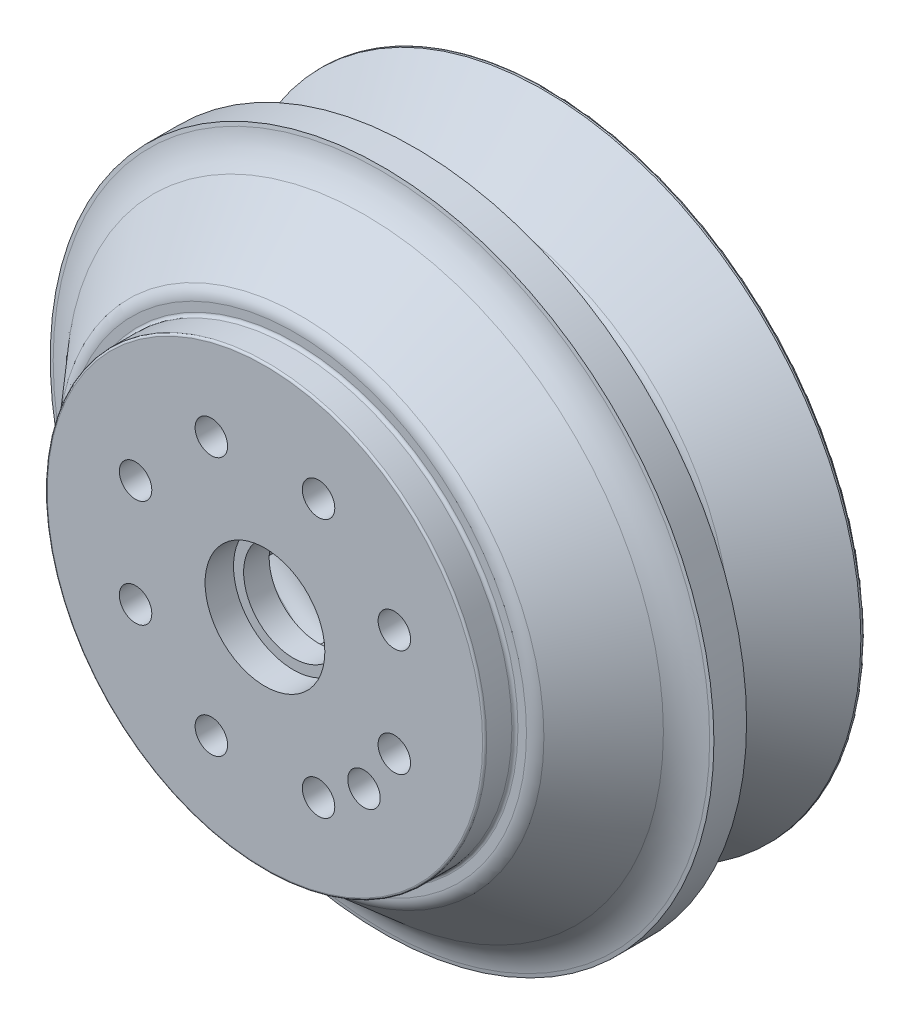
ISO-10303-21;
HEADER;
FILE_DESCRIPTION(('STEP AP214'),'2;1');
FILE_NAME('part.step','',(''),(''),'','','');
FILE_SCHEMA(('AUTOMOTIVE_DESIGN { 1 0 10303 214 1 1 1 1 }'));
ENDSEC;
DATA;
#1=APPLICATION_CONTEXT('core data for automotive mechanical design processes');
#2=APPLICATION_PROTOCOL_DEFINITION('international standard','automotive_design',2000,#1);
#3=PRODUCT_CONTEXT('',#1,'mechanical');
#4=PRODUCT('Part','Part','',(#3));
#5=PRODUCT_RELATED_PRODUCT_CATEGORY('part','',(#4));
#6=PRODUCT_DEFINITION_FORMATION('','',#4);
#7=PRODUCT_DEFINITION_CONTEXT('part definition',#1,'design');
#8=PRODUCT_DEFINITION('design','',#6,#7);
#9=PRODUCT_DEFINITION_SHAPE('','',#8);
#10=(LENGTH_UNIT() NAMED_UNIT(*) SI_UNIT(.MILLI.,.METRE.));
#11=(NAMED_UNIT(*) PLANE_ANGLE_UNIT() SI_UNIT($,.RADIAN.));
#12=(NAMED_UNIT(*) SI_UNIT($,.STERADIAN.) SOLID_ANGLE_UNIT());
#13=UNCERTAINTY_MEASURE_WITH_UNIT(LENGTH_MEASURE(1.E-05),#10,'distance_accuracy_value','');
#14=(GEOMETRIC_REPRESENTATION_CONTEXT(3) GLOBAL_UNCERTAINTY_ASSIGNED_CONTEXT((#13)) GLOBAL_UNIT_ASSIGNED_CONTEXT((#10,
#11,#12)) REPRESENTATION_CONTEXT('',''));
#15=CARTESIAN_POINT('',(0.,0.,0.));
#16=DIRECTION('',(0.,0.,1.));
#17=DIRECTION('',(1.,0.,0.));
#18=AXIS2_PLACEMENT_3D('',#15,#16,#17);
#19=CARTESIAN_POINT('',(0.,0.,0.));
#20=DIRECTION('',(0.,0.,1.));
#21=DIRECTION('',(1.,0.,0.));
#22=AXIS2_PLACEMENT_3D('',#19,#20,#21);
#23=PLANE('',#22);
#24=CARTESIAN_POINT('',(-13.4138196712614,-32.3838253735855,0.));
#25=DIRECTION('',(0.,0.,1.));
#26=DIRECTION('',(-1.,0.,0.));
#27=AXIS2_PLACEMENT_3D('',#24,#25,#26);
#28=CIRCLE('',#27,4.064);
#29=CARTESIAN_POINT('',(-17.4778196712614,-32.3838253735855,0.));
#30=VERTEX_POINT('',#29);
#31=EDGE_CURVE('E1386',#30,#30,#28,.T.);
#32=ORIENTED_EDGE('',*,*,#31,.F.);
#33=EDGE_LOOP('',(#32));
#34=FACE_BOUND('',#33,.T.);
#35=CARTESIAN_POINT('',(32.3838253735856,-13.4138196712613,0.));
#36=DIRECTION('',(0.,0.,1.));
#37=DIRECTION('',(0.,-1.,0.));
#38=AXIS2_PLACEMENT_3D('',#35,#36,#37);
#39=CIRCLE('',#38,4.064);
#40=CARTESIAN_POINT('',(32.3838253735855,-17.4778196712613,0.));
#41=VERTEX_POINT('',#40);
#42=EDGE_CURVE('E1368',#41,#41,#39,.T.);
#43=ORIENTED_EDGE('',*,*,#42,.F.);
#44=EDGE_LOOP('',(#43));
#45=FACE_BOUND('',#44,.T.);
#46=CARTESIAN_POINT('',(24.7855068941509,-24.7855068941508,0.));
#47=DIRECTION('',(0.,0.,1.));
#48=DIRECTION('',(1.,0.,0.));
#49=AXIS2_PLACEMENT_3D('',#46,#47,#48);
#50=CIRCLE('',#49,4.064);
#51=CARTESIAN_POINT('',(28.8495068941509,-24.7855068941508,0.));
#52=VERTEX_POINT('',#51);
#53=EDGE_CURVE('E1396',#52,#52,#50,.T.);
#54=ORIENTED_EDGE('',*,*,#53,.F.);
#55=EDGE_LOOP('',(#54));
#56=FACE_BOUND('',#55,.T.);
#57=CARTESIAN_POINT('',(-32.3838253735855,13.4138196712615,0.));
#58=DIRECTION('',(0.,0.,1.));
#59=DIRECTION('',(0.,1.,0.));
#60=AXIS2_PLACEMENT_3D('',#57,#58,#59);
#61=CIRCLE('',#60,4.064);
#62=CARTESIAN_POINT('',(-32.3838253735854,17.4778196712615,0.));
#63=VERTEX_POINT('',#62);
#64=EDGE_CURVE('E1342',#63,#63,#61,.T.);
#65=ORIENTED_EDGE('',*,*,#64,.F.);
#66=EDGE_LOOP('',(#65));
#67=FACE_BOUND('',#66,.T.);
#68=CARTESIAN_POINT('',(0.,0.,0.));
#69=DIRECTION('',(0.,0.,1.));
#70=DIRECTION('',(1.,0.,0.));
#71=AXIS2_PLACEMENT_3D('',#68,#69,#70);
#72=CIRCLE('',#71,54.483);
#73=CARTESIAN_POINT('',(54.483,0.,0.));
#74=VERTEX_POINT('',#73);
#75=EDGE_CURVE('E1065',#74,#74,#72,.T.);
#76=ORIENTED_EDGE('',*,*,#75,.T.);
#77=EDGE_LOOP('',(#76));
#78=FACE_BOUND('',#77,.T.);
#79=CARTESIAN_POINT('',(0.,0.,0.));
#80=DIRECTION('',(0.,0.,1.));
#81=DIRECTION('',(1.,0.,0.));
#82=AXIS2_PLACEMENT_3D('',#79,#80,#81);
#83=CIRCLE('',#82,14.986);
#84=CARTESIAN_POINT('',(14.986,0.,0.));
#85=VERTEX_POINT('',#84);
#86=EDGE_CURVE('E1435',#85,#85,#83,.T.);
#87=ORIENTED_EDGE('',*,*,#86,.F.);
#88=EDGE_LOOP('',(#87));
#89=FACE_BOUND('',#88,.T.);
#90=CARTESIAN_POINT('',(-13.4138196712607,32.3838253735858,0.));
#91=DIRECTION('',(0.,0.,1.));
#92=DIRECTION('',(0.707106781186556,0.707106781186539,0.));
#93=AXIS2_PLACEMENT_3D('',#90,#91,#92);
#94=CIRCLE('',#93,4.064);
#95=CARTESIAN_POINT('',(-10.5401377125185,35.2575073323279,0.));
#96=VERTEX_POINT('',#95);
#97=EDGE_CURVE('E1361',#96,#96,#94,.T.);
#98=ORIENTED_EDGE('',*,*,#97,.F.);
#99=EDGE_LOOP('',(#98));
#100=FACE_BOUND('',#99,.T.);
#101=CARTESIAN_POINT('',(32.3838253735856,13.413819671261,0.));
#102=DIRECTION('',(0.,0.,1.));
#103=DIRECTION('',(0.707106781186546,-0.707106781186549,0.));
#104=AXIS2_PLACEMENT_3D('',#101,#102,#103);
#105=CIRCLE('',#104,4.064);
#106=CARTESIAN_POINT('',(35.2575073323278,10.5401377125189,0.));
#107=VERTEX_POINT('',#106);
#108=EDGE_CURVE('E1377',#107,#107,#105,.T.);
#109=ORIENTED_EDGE('',*,*,#108,.F.);
#110=EDGE_LOOP('',(#109));
#111=FACE_BOUND('',#110,.T.);
#112=CARTESIAN_POINT('',(13.4138196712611,32.3838253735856,0.));
#113=DIRECTION('',(0.,0.,1.));
#114=DIRECTION('',(1.,0.,0.));
#115=AXIS2_PLACEMENT_3D('',#112,#113,#114);
#116=CIRCLE('',#115,4.064);
#117=CARTESIAN_POINT('',(17.4778196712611,32.3838253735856,0.));
#118=VERTEX_POINT('',#117);
#119=EDGE_CURVE('E1405',#118,#118,#116,.T.);
#120=ORIENTED_EDGE('',*,*,#119,.F.);
#121=EDGE_LOOP('',(#120));
#122=FACE_BOUND('',#121,.T.);
#123=CARTESIAN_POINT('',(13.4138196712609,-32.3838253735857,0.));
#124=DIRECTION('',(0.,0.,1.));
#125=DIRECTION('',(-0.707106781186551,-0.707106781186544,0.));
#126=AXIS2_PLACEMENT_3D('',#123,#124,#125);
#127=CIRCLE('',#126,4.064);
#128=CARTESIAN_POINT('',(10.5401377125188,-35.2575073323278,0.));
#129=VERTEX_POINT('',#128);
#130=EDGE_CURVE('E1378',#129,#129,#127,.T.);
#131=ORIENTED_EDGE('',*,*,#130,.F.);
#132=EDGE_LOOP('',(#131));
#133=FACE_BOUND('',#132,.T.);
#134=CARTESIAN_POINT('',(-32.3838253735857,-13.4138196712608,0.));
#135=DIRECTION('',(0.,0.,1.));
#136=DIRECTION('',(-0.707106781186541,0.707106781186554,0.));
#137=AXIS2_PLACEMENT_3D('',#134,#135,#136);
#138=CIRCLE('',#137,4.064);
#139=CARTESIAN_POINT('',(-35.2575073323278,-10.5401377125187,0.));
#140=VERTEX_POINT('',#139);
#141=EDGE_CURVE('E1348',#140,#140,#138,.T.);
#142=ORIENTED_EDGE('',*,*,#141,.F.);
#143=EDGE_LOOP('',(#142));
#144=FACE_BOUND('',#143,.T.);
#145=ADVANCED_FACE('F16',(#34,#45,#56,#67,#78,#89,#100,#111,#122,#133,#144),#23,.T.);
#146=CARTESIAN_POINT('',(0.,0.,-70.8152));
#147=DIRECTION('',(0.,0.,1.));
#148=DIRECTION('',(1.,0.,0.));
#149=AXIS2_PLACEMENT_3D('',#146,#147,#148);
#150=PLANE('',#149);
#151=CARTESIAN_POINT('',(0.,0.,-70.8152));
#152=DIRECTION('',(0.,0.,1.));
#153=DIRECTION('',(1.,0.,0.));
#154=AXIS2_PLACEMENT_3D('',#151,#152,#153);
#155=CIRCLE('',#154,76.2);
#156=CARTESIAN_POINT('',(76.2,0.,-70.8152));
#157=VERTEX_POINT('',#156);
#158=EDGE_CURVE('E1412',#157,#157,#155,.T.);
#159=ORIENTED_EDGE('',*,*,#158,.T.);
#160=EDGE_LOOP('',(#159));
#161=FACE_BOUND('',#160,.T.);
#162=CARTESIAN_POINT('',(0.,0.,-70.8152));
#163=DIRECTION('',(0.,0.,1.));
#164=DIRECTION('',(1.,0.,0.));
#165=AXIS2_PLACEMENT_3D('',#162,#163,#164);
#166=CIRCLE('',#165,78.74);
#167=CARTESIAN_POINT('',(78.74,0.,-70.8152));
#168=VERTEX_POINT('',#167);
#169=EDGE_CURVE('E426',#168,#168,#166,.F.);
#170=ORIENTED_EDGE('',*,*,#169,.T.);
#171=EDGE_LOOP('',(#170));
#172=FACE_BOUND('',#171,.T.);
#173=ADVANCED_FACE('F1085',(#161,#172),#150,.F.);
#174=CARTESIAN_POINT('',(0.,0.,-70.8152));
#175=DIRECTION('',(0.,0.,1.));
#176=DIRECTION('',(1.,0.,0.));
#177=AXIS2_PLACEMENT_3D('',#174,#175,#176);
#178=CYLINDRICAL_SURFACE('',#177,83.058);
#179=CARTESIAN_POINT('',(0.,0.,-29.3116));
#180=DIRECTION('',(0.,0.,1.));
#181=DIRECTION('',(1.,0.,0.));
#182=AXIS2_PLACEMENT_3D('',#179,#180,#181);
#183=CIRCLE('',#182,83.058);
#184=CARTESIAN_POINT('',(83.058,0.,-29.3116));
#185=VERTEX_POINT('',#184);
#186=EDGE_CURVE('E1061',#185,#185,#183,.T.);
#187=ORIENTED_EDGE('',*,*,#186,.F.);
#188=EDGE_LOOP('',(#187));
#189=FACE_BOUND('',#188,.T.);
#190=CARTESIAN_POINT('',(0.,0.,-37.4904));
#191=DIRECTION('',(0.,0.,1.));
#192=DIRECTION('',(1.,0.,0.));
#193=AXIS2_PLACEMENT_3D('',#190,#191,#192);
#194=CIRCLE('',#193,83.058);
#195=CARTESIAN_POINT('',(83.058,0.,-37.4904));
#196=VERTEX_POINT('',#195);
#197=EDGE_CURVE('E1041',#196,#196,#194,.T.);
#198=ORIENTED_EDGE('',*,*,#197,.T.);
#199=EDGE_LOOP('',(#198));
#200=FACE_BOUND('',#199,.T.);
#201=ADVANCED_FACE('F1131',(#189,#200),#178,.T.);
#202=CARTESIAN_POINT('',(0.,0.,-29.1524587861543));
#203=DIRECTION('',(0.,0.,-1.));
#204=DIRECTION('',(-1.,0.,0.));
#205=AXIS2_PLACEMENT_3D('',#202,#203,#204);
#206=CONICAL_SURFACE('',#205,82.1554653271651,1.39626340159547);
#207=ORIENTED_EDGE('',*,*,#186,.T.);
#208=EDGE_LOOP('',(#207));
#209=FACE_BOUND('',#208,.T.);
#210=CARTESIAN_POINT('',(0.,0.,-29.1524587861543));
#211=DIRECTION('',(0.,0.,1.));
#212=DIRECTION('',(1.,0.,0.));
#213=AXIS2_PLACEMENT_3D('',#210,#211,#212);
#214=CIRCLE('',#213,82.1554653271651);
#215=CARTESIAN_POINT('',(82.1554653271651,0.,-29.1524587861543));
#216=VERTEX_POINT('',#215);
#217=EDGE_CURVE('E1057',#216,#216,#214,.T.);
#218=ORIENTED_EDGE('',*,*,#217,.F.);
#219=EDGE_LOOP('',(#218));
#220=FACE_BOUND('',#219,.T.);
#221=ADVANCED_FACE('F1133',(#209,#220),#206,.T.);
#222=CARTESIAN_POINT('',(0.,0.,-16.6454003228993));
#223=DIRECTION('',(0.,0.,1.));
#224=DIRECTION('',(1.,0.,0.));
#225=AXIS2_PLACEMENT_3D('',#222,#223,#224);
#226=TOROIDAL_SURFACE('',#225,84.3607971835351,12.7);
#227=ORIENTED_EDGE('',*,*,#217,.T.);
#228=EDGE_LOOP('',(#227));
#229=FACE_BOUND('',#228,.T.);
#230=CARTESIAN_POINT('',(0.,0.,-24.9606086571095));
#231=DIRECTION('',(0.,0.,1.));
#232=DIRECTION('',(1.,0.,0.));
#233=AXIS2_PLACEMENT_3D('',#230,#231,#232);
#234=CIRCLE('',#233,74.761458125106);
#235=CARTESIAN_POINT('',(74.761458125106,0.,-24.9606086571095));
#236=VERTEX_POINT('',#235);
#237=EDGE_CURVE('E1053',#236,#236,#234,.T.);
#238=ORIENTED_EDGE('',*,*,#237,.F.);
#239=EDGE_LOOP('',(#238));
#240=FACE_BOUND('',#239,.T.);
#241=ADVANCED_FACE('F1142',(#229,#240),#226,.F.);
#242=CARTESIAN_POINT('',(0.,0.,-8.93725499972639));
#243=DIRECTION('',(0.,0.,-1.));
#244=DIRECTION('',(-1.,0.,0.));
#245=AXIS2_PLACEMENT_3D('',#242,#243,#244);
#246=CONICAL_SURFACE('',#245,60.8815937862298,0.713839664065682);
#247=ORIENTED_EDGE('',*,*,#237,.T.);
#248=EDGE_LOOP('',(#247));
#249=FACE_BOUND('',#248,.T.);
#250=CARTESIAN_POINT('',(0.,0.,-8.93725499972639));
#251=DIRECTION('',(0.,0.,1.));
#252=DIRECTION('',(1.,0.,0.));
#253=AXIS2_PLACEMENT_3D('',#250,#251,#252);
#254=CIRCLE('',#253,60.8815937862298);
#255=CARTESIAN_POINT('',(60.8815937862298,0.,-8.93725499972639));
#256=VERTEX_POINT('',#255);
#257=EDGE_CURVE('E1049',#256,#256,#254,.T.);
#258=ORIENTED_EDGE('',*,*,#257,.F.);
#259=EDGE_LOOP('',(#258));
#260=FACE_BOUND('',#259,.T.);
#261=ADVANCED_FACE('F1160',(#249,#260),#246,.T.);
#262=CARTESIAN_POINT('',(0.,0.,-11.5316));
#263=DIRECTION('',(0.,0.,1.));
#264=DIRECTION('',(1.,0.,0.));
#265=AXIS2_PLACEMENT_3D('',#262,#263,#264);
#266=TOROIDAL_SURFACE('',#265,57.8866,3.9624);
#267=ORIENTED_EDGE('',*,*,#257,.T.);
#268=EDGE_LOOP('',(#267));
#269=FACE_BOUND('',#268,.T.);
#270=CARTESIAN_POINT('',(0.,0.,-7.56919999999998));
#271=DIRECTION('',(0.,0.,1.));
#272=DIRECTION('',(1.,0.,0.));
#273=AXIS2_PLACEMENT_3D('',#270,#271,#272);
#274=CIRCLE('',#273,57.8866);
#275=CARTESIAN_POINT('',(57.8866,0.,-7.56919999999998));
#276=VERTEX_POINT('',#275);
#277=EDGE_CURVE('E1045',#276,#276,#274,.T.);
#278=ORIENTED_EDGE('',*,*,#277,.F.);
#279=EDGE_LOOP('',(#278));
#280=FACE_BOUND('',#279,.T.);
#281=ADVANCED_FACE('F1164',(#269,#280),#266,.T.);
#282=CARTESIAN_POINT('',(0.,54.991,-7.56919999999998));
#283=DIRECTION('',(0.,0.,1.));
#284=DIRECTION('',(1.,0.,0.));
#285=AXIS2_PLACEMENT_3D('',#282,#283,#284);
#286=PLANE('',#285);
#287=CARTESIAN_POINT('',(0.,0.,-7.56919999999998));
#288=DIRECTION('',(0.,0.,1.));
#289=DIRECTION('',(1.,0.,0.));
#290=AXIS2_PLACEMENT_3D('',#287,#288,#289);
#291=CIRCLE('',#290,55.753);
#292=CARTESIAN_POINT('',(55.753,0.,-7.56919999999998));
#293=VERTEX_POINT('',#292);
#294=EDGE_CURVE('E552',#293,#293,#291,.F.);
#295=ORIENTED_EDGE('',*,*,#294,.T.);
#296=EDGE_LOOP('',(#295));
#297=FACE_BOUND('',#296,.T.);
#298=ORIENTED_EDGE('',*,*,#277,.T.);
#299=EDGE_LOOP('',(#298));
#300=FACE_BOUND('',#299,.T.);
#301=ADVANCED_FACE('F1168',(#297,#300),#286,.T.);
#302=CARTESIAN_POINT('',(0.,0.,0.));
#303=DIRECTION('',(0.,0.,1.));
#304=DIRECTION('',(1.,0.,0.));
#305=AXIS2_PLACEMENT_3D('',#302,#303,#304);
#306=CYLINDRICAL_SURFACE('',#305,54.991);
#307=CARTESIAN_POINT('',(0.,0.,-6.80719999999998));
#308=DIRECTION('',(0.,0.,1.));
#309=DIRECTION('',(1.,0.,0.));
#310=AXIS2_PLACEMENT_3D('',#307,#308,#309);
#311=CIRCLE('',#310,54.991);
#312=CARTESIAN_POINT('',(54.991,0.,-6.80719999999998));
#313=VERTEX_POINT('',#312);
#314=EDGE_CURVE('E499',#313,#313,#311,.T.);
#315=ORIENTED_EDGE('',*,*,#314,.T.);
#316=EDGE_LOOP('',(#315));
#317=FACE_BOUND('',#316,.T.);
#318=CARTESIAN_POINT('',(0.,0.,-0.508));
#319=DIRECTION('',(0.,0.,1.));
#320=DIRECTION('',(1.,0.,0.));
#321=AXIS2_PLACEMENT_3D('',#318,#319,#320);
#322=CIRCLE('',#321,54.991);
#323=CARTESIAN_POINT('',(54.991,0.,-0.508));
#324=VERTEX_POINT('',#323);
#325=EDGE_CURVE('E1069',#324,#324,#322,.F.);
#326=ORIENTED_EDGE('',*,*,#325,.T.);
#327=EDGE_LOOP('',(#326));
#328=FACE_BOUND('',#327,.T.);
#329=ADVANCED_FACE('F1172',(#317,#328),#306,.T.);
#330=CARTESIAN_POINT('',(0.,0.,-0.508));
#331=DIRECTION('',(0.,0.,1.));
#332=DIRECTION('',(1.,0.,0.));
#333=AXIS2_PLACEMENT_3D('',#330,#331,#332);
#334=TOROIDAL_SURFACE('',#333,54.483,0.508);
#335=ORIENTED_EDGE('',*,*,#325,.F.);
#336=EDGE_LOOP('',(#335));
#337=FACE_BOUND('',#336,.T.);
#338=ORIENTED_EDGE('',*,*,#75,.F.);
#339=EDGE_LOOP('',(#338));
#340=FACE_BOUND('',#339,.T.);
#341=ADVANCED_FACE('F1127',(#337,#340),#334,.T.);
#342=CARTESIAN_POINT('',(0.,83.058,-37.4904));
#343=DIRECTION('',(0.,0.,-1.));
#344=DIRECTION('',(-1.,0.,0.));
#345=AXIS2_PLACEMENT_3D('',#342,#343,#344);
#346=PLANE('',#345);
#347=CARTESIAN_POINT('',(0.,0.,-37.4904));
#348=DIRECTION('',(0.,0.,1.));
#349=DIRECTION('',(1.,0.,0.));
#350=AXIS2_PLACEMENT_3D('',#347,#348,#349);
#351=CIRCLE('',#350,81.5848);
#352=CARTESIAN_POINT('',(81.5848,0.,-37.4904));
#353=VERTEX_POINT('',#352);
#354=EDGE_CURVE('E1037',#353,#353,#351,.T.);
#355=ORIENTED_EDGE('',*,*,#354,.T.);
#356=EDGE_LOOP('',(#355));
#357=FACE_BOUND('',#356,.T.);
#358=ORIENTED_EDGE('',*,*,#197,.F.);
#359=EDGE_LOOP('',(#358));
#360=FACE_BOUND('',#359,.T.);
#361=ADVANCED_FACE('F1121',(#357,#360),#346,.T.);
#362=CARTESIAN_POINT('',(0.,0.,-47.6504));
#363=DIRECTION('',(0.,0.,1.));
#364=DIRECTION('',(1.,0.,0.));
#365=AXIS2_PLACEMENT_3D('',#362,#363,#364);
#366=TOROIDAL_SURFACE('',#365,81.5848,10.16);
#367=CARTESIAN_POINT('',(0.,0.,-39.622425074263));
#368=DIRECTION('',(0.,0.,1.));
#369=DIRECTION('',(1.,0.,0.));
#370=AXIS2_PLACEMENT_3D('',#367,#368,#369);
#371=CIRCLE('',#370,75.3576643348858);
#372=CARTESIAN_POINT('',(75.3576643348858,0.,-39.622425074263));
#373=VERTEX_POINT('',#372);
#374=EDGE_CURVE('E1033',#373,#373,#371,.T.);
#375=ORIENTED_EDGE('',*,*,#374,.T.);
#376=EDGE_LOOP('',(#375));
#377=FACE_BOUND('',#376,.T.);
#378=ORIENTED_EDGE('',*,*,#354,.F.);
#379=EDGE_LOOP('',(#378));
#380=FACE_BOUND('',#379,.T.);
#381=ADVANCED_FACE('F1115',(#377,#380),#366,.F.);
#382=CARTESIAN_POINT('',(0.,0.,-39.622425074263));
#383=DIRECTION('',(0.,0.,1.));
#384=DIRECTION('',(1.,0.,0.));
#385=AXIS2_PLACEMENT_3D('',#382,#383,#384);
#386=CONICAL_SURFACE('',#385,75.3576643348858,0.911061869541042);
#387=CARTESIAN_POINT('',(0.,0.,-49.0306627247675));
#388=DIRECTION('',(0.,0.,1.));
#389=DIRECTION('',(1.,0.,0.));
#390=AXIS2_PLACEMENT_3D('',#387,#388,#389);
#391=CIRCLE('',#390,63.2286374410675);
#392=CARTESIAN_POINT('',(63.2286374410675,0.,-49.0306627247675));
#393=VERTEX_POINT('',#392);
#394=EDGE_CURVE('E1029',#393,#393,#391,.T.);
#395=ORIENTED_EDGE('',*,*,#394,.T.);
#396=EDGE_LOOP('',(#395));
#397=FACE_BOUND('',#396,.T.);
#398=ORIENTED_EDGE('',*,*,#374,.F.);
#399=EDGE_LOOP('',(#398));
#400=FACE_BOUND('',#399,.T.);
#401=ADVANCED_FACE('F1109',(#397,#400),#386,.T.);
#402=CARTESIAN_POINT('',(0.,0.,-51.4390552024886));
#403=DIRECTION('',(0.,0.,1.));
#404=DIRECTION('',(1.,0.,0.));
#405=AXIS2_PLACEMENT_3D('',#402,#403,#404);
#406=TOROIDAL_SURFACE('',#405,65.0967781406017,3.048);
#407=CARTESIAN_POINT('',(0.,0.,-53.5943166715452));
#408=DIRECTION('',(0.,0.,1.));
#409=DIRECTION('',(1.,0.,0.));
#410=AXIS2_PLACEMENT_3D('',#407,#408,#409);
#411=CIRCLE('',#410,62.9415166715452);
#412=CARTESIAN_POINT('',(62.9415166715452,0.,-53.5943166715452));
#413=VERTEX_POINT('',#412);
#414=EDGE_CURVE('E1025',#413,#413,#411,.T.);
#415=ORIENTED_EDGE('',*,*,#414,.T.);
#416=EDGE_LOOP('',(#415));
#417=FACE_BOUND('',#416,.T.);
#418=ORIENTED_EDGE('',*,*,#394,.F.);
#419=EDGE_LOOP('',(#418));
#420=FACE_BOUND('',#419,.T.);
#421=ADVANCED_FACE('F1103',(#417,#420),#406,.F.);
#422=CARTESIAN_POINT('',(0.,0.,-53.5943166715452));
#423=DIRECTION('',(0.,0.,-1.));
#424=DIRECTION('',(-1.,0.,0.));
#425=AXIS2_PLACEMENT_3D('',#422,#423,#424);
#426=CONICAL_SURFACE('',#425,62.9415166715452,0.785398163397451);
#427=CARTESIAN_POINT('',(0.,0.,-69.9008));
#428=DIRECTION('',(0.,0.,1.));
#429=DIRECTION('',(1.,0.,0.));
#430=AXIS2_PLACEMENT_3D('',#427,#428,#429);
#431=CIRCLE('',#430,79.248);
#432=CARTESIAN_POINT('',(79.248,0.,-69.9008));
#433=VERTEX_POINT('',#432);
#434=EDGE_CURVE('E1021',#433,#433,#431,.T.);
#435=ORIENTED_EDGE('',*,*,#434,.T.);
#436=EDGE_LOOP('',(#435));
#437=FACE_BOUND('',#436,.T.);
#438=ORIENTED_EDGE('',*,*,#414,.F.);
#439=EDGE_LOOP('',(#438));
#440=FACE_BOUND('',#439,.T.);
#441=ADVANCED_FACE('F1097',(#437,#440),#426,.T.);
#442=CARTESIAN_POINT('',(0.,0.,0.));
#443=DIRECTION('',(0.,0.,1.));
#444=DIRECTION('',(1.,0.,0.));
#445=AXIS2_PLACEMENT_3D('',#442,#443,#444);
#446=CYLINDRICAL_SURFACE('',#445,79.248);
#447=CARTESIAN_POINT('',(0.,0.,-70.3072));
#448=DIRECTION('',(0.,0.,1.));
#449=DIRECTION('',(1.,0.,0.));
#450=AXIS2_PLACEMENT_3D('',#447,#448,#449);
#451=CIRCLE('',#450,79.248);
#452=CARTESIAN_POINT('',(79.248,0.,-70.3072));
#453=VERTEX_POINT('',#452);
#454=EDGE_CURVE('E1073',#453,#453,#451,.T.);
#455=ORIENTED_EDGE('',*,*,#454,.T.);
#456=EDGE_LOOP('',(#455));
#457=FACE_BOUND('',#456,.T.);
#458=ORIENTED_EDGE('',*,*,#434,.F.);
#459=EDGE_LOOP('',(#458));
#460=FACE_BOUND('',#459,.T.);
#461=ADVANCED_FACE('F1091',(#457,#460),#446,.T.);
#462=CARTESIAN_POINT('',(0.,0.,-70.3072));
#463=DIRECTION('',(0.,0.,1.));
#464=DIRECTION('',(1.,0.,0.));
#465=AXIS2_PLACEMENT_3D('',#462,#463,#464);
#466=TOROIDAL_SURFACE('',#465,78.74,0.508);
#467=ORIENTED_EDGE('',*,*,#169,.F.);
#468=EDGE_LOOP('',(#467));
#469=FACE_BOUND('',#468,.T.);
#470=ORIENTED_EDGE('',*,*,#454,.F.);
#471=EDGE_LOOP('',(#470));
#472=FACE_BOUND('',#471,.T.);
#473=ADVANCED_FACE('F1087',(#469,#472),#466,.T.);
#474=CARTESIAN_POINT('',(0.,0.,-6.80719999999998));
#475=DIRECTION('',(0.,0.,1.));
#476=DIRECTION('',(1.,0.,0.));
#477=AXIS2_PLACEMENT_3D('',#474,#475,#476);
#478=TOROIDAL_SURFACE('',#477,55.753,0.762);
#479=ORIENTED_EDGE('',*,*,#294,.F.);
#480=EDGE_LOOP('',(#479));
#481=FACE_BOUND('',#480,.T.);
#482=ORIENTED_EDGE('',*,*,#314,.F.);
#483=EDGE_LOOP('',(#482));
#484=FACE_BOUND('',#483,.T.);
#485=ADVANCED_FACE('F1090',(#481,#484),#478,.F.);
#486=CARTESIAN_POINT('',(0.,0.,-51.0041049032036));
#487=DIRECTION('',(0.,0.,1.));
#488=DIRECTION('',(1.,0.,0.));
#489=AXIS2_PLACEMENT_3D('',#486,#487,#488);
#490=TOROIDAL_SURFACE('',#489,62.289749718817,5.75828529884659);
#491=CARTESIAN_POINT('',(0.,0.,-46.4541669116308));
#492=DIRECTION('',(0.,0.,1.));
#493=DIRECTION('',(1.,0.,0.));
#494=AXIS2_PLACEMENT_3D('',#491,#492,#493);
#495=CIRCLE('',#494,58.7604560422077);
#496=CARTESIAN_POINT('',(58.7604560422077,0.,-46.4541669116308));
#497=VERTEX_POINT('',#496);
#498=EDGE_CURVE('E1416',#497,#497,#495,.T.);
#499=ORIENTED_EDGE('',*,*,#498,.T.);
#500=EDGE_LOOP('',(#499));
#501=FACE_BOUND('',#500,.T.);
#502=CARTESIAN_POINT('',(0.,0.,-55.3390880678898));
#503=DIRECTION('',(0.,0.,1.));
#504=DIRECTION('',(1.,0.,0.));
#505=AXIS2_PLACEMENT_3D('',#502,#503,#504);
#506=CIRCLE('',#505,58.4995293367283);
#507=CARTESIAN_POINT('',(58.4995293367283,0.,-55.3390880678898));
#508=VERTEX_POINT('',#507);
#509=EDGE_CURVE('E1421',#508,#508,#506,.T.);
#510=ORIENTED_EDGE('',*,*,#509,.F.);
#511=EDGE_LOOP('',(#510));
#512=FACE_BOUND('',#511,.T.);
#513=ADVANCED_FACE('F1302',(#501,#512),#490,.T.);
#514=CARTESIAN_POINT('',(0.,0.,-70.8152));
#515=DIRECTION('',(0.,0.,-1.));
#516=DIRECTION('',(-1.,0.,0.));
#517=AXIS2_PLACEMENT_3D('',#514,#515,#516);
#518=CONICAL_SURFACE('',#517,76.2,0.852344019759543);
#519=ORIENTED_EDGE('',*,*,#509,.T.);
#520=EDGE_LOOP('',(#519));
#521=FACE_BOUND('',#520,.T.);
#522=ORIENTED_EDGE('',*,*,#158,.F.);
#523=EDGE_LOOP('',(#522));
#524=FACE_BOUND('',#523,.T.);
#525=ADVANCED_FACE('F1286',(#521,#524),#518,.F.);
#526=CARTESIAN_POINT('',(0.,0.,-7.11199999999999));
#527=DIRECTION('',(0.,0.,1.));
#528=DIRECTION('',(1.,0.,0.));
#529=AXIS2_PLACEMENT_3D('',#526,#527,#528);
#530=CYLINDRICAL_SURFACE('',#529,14.986);
#531=CARTESIAN_POINT('',(0.,0.,-7.11199999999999));
#532=DIRECTION('',(0.,0.,1.));
#533=DIRECTION('',(1.,0.,0.));
#534=AXIS2_PLACEMENT_3D('',#531,#532,#533);
#535=CIRCLE('',#534,14.986);
#536=CARTESIAN_POINT('',(14.986,0.,-7.112));
#537=VERTEX_POINT('',#536);
#538=EDGE_CURVE('E892',#537,#537,#535,.T.);
#539=CARTESIAN_POINT('',(14.986,0.,-7.112));
#540=CARTESIAN_POINT('',(14.986,0.,-7.03791666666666));
#541=CARTESIAN_POINT('',(14.986,0.,-6.96383333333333));
#542=CARTESIAN_POINT('',(14.986,0.,-6.81566666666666));
#543=CARTESIAN_POINT('',(14.986,0.,-6.74158333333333));
#544=CARTESIAN_POINT('',(14.986,0.,-6.59341666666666));
#545=CARTESIAN_POINT('',(14.986,0.,-6.51933333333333));
#546=CARTESIAN_POINT('',(14.986,0.,-6.37116666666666));
#547=CARTESIAN_POINT('',(14.986,0.,-6.29708333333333));
#548=CARTESIAN_POINT('',(14.986,0.,-6.14891666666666));
#549=CARTESIAN_POINT('',(14.986,0.,-6.07483333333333));
#550=CARTESIAN_POINT('',(14.986,0.,-5.92666666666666));
#551=CARTESIAN_POINT('',(14.986,0.,-5.85258333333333));
#552=CARTESIAN_POINT('',(14.986,0.,-5.70441666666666));
#553=CARTESIAN_POINT('',(14.986,0.,-5.63033333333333));
#554=CARTESIAN_POINT('',(14.986,0.,-5.48216666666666));
#555=CARTESIAN_POINT('',(14.986,0.,-5.40808333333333));
#556=CARTESIAN_POINT('',(14.986,0.,-5.25991666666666));
#557=CARTESIAN_POINT('',(14.986,0.,-5.18583333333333));
#558=CARTESIAN_POINT('',(14.986,0.,-5.03766666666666));
#559=CARTESIAN_POINT('',(14.986,0.,-4.96358333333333));
#560=CARTESIAN_POINT('',(14.986,0.,-4.81541666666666));
#561=CARTESIAN_POINT('',(14.986,0.,-4.74133333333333));
#562=CARTESIAN_POINT('',(14.986,0.,-4.59316666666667));
#563=CARTESIAN_POINT('',(14.986,0.,-4.51908333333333));
#564=CARTESIAN_POINT('',(14.986,0.,-4.37091666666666));
#565=CARTESIAN_POINT('',(14.986,0.,-4.29683333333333));
#566=CARTESIAN_POINT('',(14.986,0.,-4.14866666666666));
#567=CARTESIAN_POINT('',(14.986,0.,-4.07458333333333));
#568=CARTESIAN_POINT('',(14.986,0.,-3.92641666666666));
#569=CARTESIAN_POINT('',(14.986,0.,-3.85233333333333));
#570=CARTESIAN_POINT('',(14.986,0.,-3.70416666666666));
#571=CARTESIAN_POINT('',(14.986,0.,-3.63008333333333));
#572=CARTESIAN_POINT('',(14.986,0.,-3.48191666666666));
#573=CARTESIAN_POINT('',(14.986,0.,-3.40783333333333));
#574=CARTESIAN_POINT('',(14.986,0.,-3.25966666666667));
#575=CARTESIAN_POINT('',(14.986,0.,-3.18558333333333));
#576=CARTESIAN_POINT('',(14.986,0.,-3.03741666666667));
#577=CARTESIAN_POINT('',(14.986,0.,-2.96333333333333));
#578=CARTESIAN_POINT('',(14.986,0.,-2.81516666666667));
#579=CARTESIAN_POINT('',(14.986,0.,-2.74108333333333));
#580=CARTESIAN_POINT('',(14.986,0.,-2.59291666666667));
#581=CARTESIAN_POINT('',(14.986,0.,-2.51883333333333));
#582=CARTESIAN_POINT('',(14.986,0.,-2.37066666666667));
#583=CARTESIAN_POINT('',(14.986,0.,-2.29658333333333));
#584=CARTESIAN_POINT('',(14.986,0.,-2.14841666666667));
#585=CARTESIAN_POINT('',(14.986,0.,-2.07433333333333));
#586=CARTESIAN_POINT('',(14.986,0.,-1.92616666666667));
#587=CARTESIAN_POINT('',(14.986,0.,-1.85208333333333));
#588=CARTESIAN_POINT('',(14.986,0.,-1.70391666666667));
#589=CARTESIAN_POINT('',(14.986,0.,-1.62983333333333));
#590=CARTESIAN_POINT('',(14.986,0.,-1.48166666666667));
#591=CARTESIAN_POINT('',(14.986,0.,-1.40758333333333));
#592=CARTESIAN_POINT('',(14.986,0.,-1.25941666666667));
#593=CARTESIAN_POINT('',(14.986,0.,-1.18533333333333));
#594=CARTESIAN_POINT('',(14.986,0.,-1.03716666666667));
#595=CARTESIAN_POINT('',(14.986,0.,-0.963083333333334));
#596=CARTESIAN_POINT('',(14.986,0.,-0.814916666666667));
#597=CARTESIAN_POINT('',(14.986,0.,-0.740833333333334));
#598=CARTESIAN_POINT('',(14.986,0.,-0.592666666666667));
#599=CARTESIAN_POINT('',(14.986,0.,-0.518583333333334));
#600=CARTESIAN_POINT('',(14.986,0.,-0.370416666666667));
#601=CARTESIAN_POINT('',(14.986,0.,-0.296333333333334));
#602=CARTESIAN_POINT('',(14.986,0.,-0.148166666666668));
#603=CARTESIAN_POINT('',(14.986,0.,-0.0740833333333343));
#604=CARTESIAN_POINT('',(14.986,0.,0.));
#605=B_SPLINE_CURVE_WITH_KNOTS('',3,(#539,#540,#541,#542,#543,#544,#545,#546,#547,#548,#549,
#550,#551,#552,#553,#554,#555,#556,#557,#558,#559,#560,#561,#562,#563,#564,#565,#566,#567,#568,
#569,#570,#571,#572,#573,#574,#575,#576,#577,#578,#579,#580,#581,#582,#583,#584,#585,#586,#587,
#588,#589,#590,#591,#592,#593,#594,#595,#596,#597,#598,#599,#600,#601,#602,#603,#604),
.UNSPECIFIED.,.F.,.F.,(4,2,2,2,2,2,2,2,2,2,2,2,2,2,2,2,2,2,2,2,2,2,2,2,2,2,2,2,2,2,2,2,4),(0.,
0.22225,0.4445,0.66675,0.889,1.11125,1.3335,1.55575,1.778,2.00025,2.2225,2.44475,2.667,2.88925,
3.1115,3.33375,3.556,3.77825,4.0005,4.22275,4.445,4.66725,4.8895,5.11175,5.334,5.55625,5.7785,
6.00075,6.223,6.44525,6.6675,6.88974999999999,7.11199999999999),.UNSPECIFIED.);
#606=EDGE_CURVE('BSEAM1282',#537,#85,#605,.T.);
#607=ORIENTED_EDGE('',*,*,#538,.F.);
#608=ORIENTED_EDGE('',*,*,#86,.T.);
#609=ORIENTED_EDGE('',*,*,#606,.T.);
#610=ORIENTED_EDGE('',*,*,#606,.F.);
#611=EDGE_LOOP('',(#607,#609,#608,#610));
#612=FACE_BOUND('',#611,.T.);
#613=ADVANCED_FACE('F1282',(#612),#530,.F.);
#614=CARTESIAN_POINT('',(0.,0.,-7.11199999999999));
#615=DIRECTION('',(0.,0.,1.));
#616=DIRECTION('',(1.,0.,0.));
#617=AXIS2_PLACEMENT_3D('',#614,#615,#616);
#618=PLANE('',#617);
#619=ORIENTED_EDGE('',*,*,#538,.T.);
#620=EDGE_LOOP('',(#619));
#621=FACE_BOUND('',#620,.T.);
#622=CARTESIAN_POINT('',(0.,0.,-7.11199999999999));
#623=DIRECTION('',(0.,0.,1.));
#624=DIRECTION('',(1.,0.,0.));
#625=AXIS2_PLACEMENT_3D('',#622,#623,#624);
#626=CIRCLE('',#625,12.446);
#627=CARTESIAN_POINT('',(12.446,0.,-7.11199999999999));
#628=VERTEX_POINT('',#627);
#629=EDGE_CURVE('E1439',#628,#628,#626,.F.);
#630=ORIENTED_EDGE('',*,*,#629,.T.);
#631=EDGE_LOOP('',(#630));
#632=FACE_BOUND('',#631,.T.);
#633=ADVANCED_FACE('F1285',(#621,#632),#618,.T.);
#634=CARTESIAN_POINT('',(0.,0.,-70.8162));
#635=DIRECTION('',(0.,0.,1.));
#636=DIRECTION('',(1.,0.,0.));
#637=AXIS2_PLACEMENT_3D('',#634,#635,#636);
#638=CYLINDRICAL_SURFACE('',#637,12.446);
#639=CARTESIAN_POINT('',(0.,0.,-13.4874));
#640=DIRECTION('',(0.,0.,-1.));
#641=DIRECTION('',(-1.,0.,0.));
#642=AXIS2_PLACEMENT_3D('',#639,#640,#641);
#643=CIRCLE('',#642,12.446);
#644=CARTESIAN_POINT('',(-12.446,0.,-13.4874));
#645=VERTEX_POINT('',#644);
#646=EDGE_CURVE('E1425',#645,#645,#643,.F.);
#647=ORIENTED_EDGE('',*,*,#646,.F.);
#648=EDGE_LOOP('',(#647));
#649=FACE_BOUND('',#648,.T.);
#650=ORIENTED_EDGE('',*,*,#629,.F.);
#651=EDGE_LOOP('',(#650));
#652=FACE_BOUND('',#651,.T.);
#653=ADVANCED_FACE('F1290',(#649,#652),#638,.F.);
#654=CARTESIAN_POINT('',(-13.4138196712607,32.3838253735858,0.));
#655=DIRECTION('',(0.,0.,-1.));
#656=DIRECTION('',(-1.,0.,0.));
#657=AXIS2_PLACEMENT_3D('',#654,#655,#656);
#658=CYLINDRICAL_SURFACE('',#657,4.064);
#659=ORIENTED_EDGE('',*,*,#97,.T.);
#660=EDGE_LOOP('',(#659));
#661=FACE_BOUND('',#660,.T.);
#662=CARTESIAN_POINT('',(-13.4138196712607,32.3838253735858,-13.4874));
#663=DIRECTION('',(0.,0.,1.));
#664=DIRECTION('',(0.707106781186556,0.707106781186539,0.));
#665=AXIS2_PLACEMENT_3D('',#662,#663,#664);
#666=CIRCLE('',#665,4.064);
#667=CARTESIAN_POINT('',(-10.5401377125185,35.2575073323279,-13.4874));
#668=VERTEX_POINT('',#667);
#669=EDGE_CURVE('E1358',#668,#668,#666,.T.);
#670=ORIENTED_EDGE('',*,*,#669,.F.);
#671=EDGE_LOOP('',(#670));
#672=FACE_BOUND('',#671,.T.);
#673=ADVANCED_FACE('F1294',(#661,#672),#658,.F.);
#674=CARTESIAN_POINT('',(-32.3838253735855,13.4138196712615,0.));
#675=DIRECTION('',(0.,0.,-1.));
#676=DIRECTION('',(-1.,0.,0.));
#677=AXIS2_PLACEMENT_3D('',#674,#675,#676);
#678=CYLINDRICAL_SURFACE('',#677,4.064);
#679=ORIENTED_EDGE('',*,*,#64,.T.);
#680=EDGE_LOOP('',(#679));
#681=FACE_BOUND('',#680,.T.);
#682=CARTESIAN_POINT('',(-32.3838253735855,13.4138196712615,-13.4874));
#683=DIRECTION('',(0.,0.,1.));
#684=DIRECTION('',(0.,1.,0.));
#685=AXIS2_PLACEMENT_3D('',#682,#683,#684);
#686=CIRCLE('',#685,4.064);
#687=CARTESIAN_POINT('',(-32.3838253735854,17.4778196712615,-13.4874));
#688=VERTEX_POINT('',#687);
#689=EDGE_CURVE('E1345',#688,#688,#686,.T.);
#690=ORIENTED_EDGE('',*,*,#689,.F.);
#691=EDGE_LOOP('',(#690));
#692=FACE_BOUND('',#691,.T.);
#693=ADVANCED_FACE('F1312',(#681,#692),#678,.F.);
#694=CARTESIAN_POINT('',(32.3838253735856,13.413819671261,0.));
#695=DIRECTION('',(0.,0.,-1.));
#696=DIRECTION('',(-1.,0.,0.));
#697=AXIS2_PLACEMENT_3D('',#694,#695,#696);
#698=CYLINDRICAL_SURFACE('',#697,4.064);
#699=ORIENTED_EDGE('',*,*,#108,.T.);
#700=EDGE_LOOP('',(#699));
#701=FACE_BOUND('',#700,.T.);
#702=CARTESIAN_POINT('',(32.3838253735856,13.413819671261,-13.4874));
#703=DIRECTION('',(0.,0.,1.));
#704=DIRECTION('',(0.707106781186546,-0.707106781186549,0.));
#705=AXIS2_PLACEMENT_3D('',#702,#703,#704);
#706=CIRCLE('',#705,4.064);
#707=CARTESIAN_POINT('',(35.2575073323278,10.5401377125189,-13.4874));
#708=VERTEX_POINT('',#707);
#709=EDGE_CURVE('E1401',#708,#708,#706,.T.);
#710=ORIENTED_EDGE('',*,*,#709,.F.);
#711=EDGE_LOOP('',(#710));
#712=FACE_BOUND('',#711,.T.);
#713=ADVANCED_FACE('F1309',(#701,#712),#698,.F.);
#714=CARTESIAN_POINT('',(24.7855068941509,-24.7855068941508,0.));
#715=DIRECTION('',(0.,0.,-1.));
#716=DIRECTION('',(-1.,0.,0.));
#717=AXIS2_PLACEMENT_3D('',#714,#715,#716);
#718=CYLINDRICAL_SURFACE('',#717,4.064);
#719=ORIENTED_EDGE('',*,*,#53,.T.);
#720=EDGE_LOOP('',(#719));
#721=FACE_BOUND('',#720,.T.);
#722=CARTESIAN_POINT('',(24.7855068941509,-24.7855068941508,-13.4874));
#723=DIRECTION('',(0.,0.,1.));
#724=DIRECTION('',(1.,0.,0.));
#725=AXIS2_PLACEMENT_3D('',#722,#723,#724);
#726=CIRCLE('',#725,4.064);
#727=CARTESIAN_POINT('',(28.8495068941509,-24.7855068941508,-13.4874));
#728=VERTEX_POINT('',#727);
#729=EDGE_CURVE('E1400',#728,#728,#726,.T.);
#730=ORIENTED_EDGE('',*,*,#729,.F.);
#731=EDGE_LOOP('',(#730));
#732=FACE_BOUND('',#731,.T.);
#733=ADVANCED_FACE('F1300',(#721,#732),#718,.F.);
#734=CARTESIAN_POINT('',(13.4138196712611,32.3838253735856,0.));
#735=DIRECTION('',(0.,0.,-1.));
#736=DIRECTION('',(-1.,0.,0.));
#737=AXIS2_PLACEMENT_3D('',#734,#735,#736);
#738=CYLINDRICAL_SURFACE('',#737,4.064);
#739=ORIENTED_EDGE('',*,*,#119,.T.);
#740=EDGE_LOOP('',(#739));
#741=FACE_BOUND('',#740,.T.);
#742=CARTESIAN_POINT('',(13.4138196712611,32.3838253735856,-13.4874));
#743=DIRECTION('',(0.,0.,1.));
#744=DIRECTION('',(1.,0.,0.));
#745=AXIS2_PLACEMENT_3D('',#742,#743,#744);
#746=CIRCLE('',#745,4.064);
#747=CARTESIAN_POINT('',(17.4778196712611,32.3838253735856,-13.4874));
#748=VERTEX_POINT('',#747);
#749=EDGE_CURVE('E1417',#748,#748,#746,.T.);
#750=ORIENTED_EDGE('',*,*,#749,.F.);
#751=EDGE_LOOP('',(#750));
#752=FACE_BOUND('',#751,.T.);
#753=ADVANCED_FACE('F1296',(#741,#752),#738,.F.);
#754=CARTESIAN_POINT('',(32.3838253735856,-13.4138196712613,0.));
#755=DIRECTION('',(0.,0.,-1.));
#756=DIRECTION('',(-1.,0.,0.));
#757=AXIS2_PLACEMENT_3D('',#754,#755,#756);
#758=CYLINDRICAL_SURFACE('',#757,4.064);
#759=ORIENTED_EDGE('',*,*,#42,.T.);
#760=EDGE_LOOP('',(#759));
#761=FACE_BOUND('',#760,.T.);
#762=CARTESIAN_POINT('',(32.3838253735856,-13.4138196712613,-13.4874));
#763=DIRECTION('',(0.,0.,1.));
#764=DIRECTION('',(0.,-1.,0.));
#765=AXIS2_PLACEMENT_3D('',#762,#763,#764);
#766=CIRCLE('',#765,4.064);
#767=CARTESIAN_POINT('',(32.3838253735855,-17.4778196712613,-13.4874));
#768=VERTEX_POINT('',#767);
#769=EDGE_CURVE('E1372',#768,#768,#766,.T.);
#770=ORIENTED_EDGE('',*,*,#769,.F.);
#771=EDGE_LOOP('',(#770));
#772=FACE_BOUND('',#771,.T.);
#773=ADVANCED_FACE('F1299',(#761,#772),#758,.F.);
#774=CARTESIAN_POINT('',(13.4138196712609,-32.3838253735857,0.));
#775=DIRECTION('',(0.,0.,-1.));
#776=DIRECTION('',(-1.,0.,0.));
#777=AXIS2_PLACEMENT_3D('',#774,#775,#776);
#778=CYLINDRICAL_SURFACE('',#777,4.064);
#779=ORIENTED_EDGE('',*,*,#130,.T.);
#780=EDGE_LOOP('',(#779));
#781=FACE_BOUND('',#780,.T.);
#782=CARTESIAN_POINT('',(13.4138196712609,-32.3838253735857,-13.4874));
#783=DIRECTION('',(0.,0.,1.));
#784=DIRECTION('',(-0.707106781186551,-0.707106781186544,0.));
#785=AXIS2_PLACEMENT_3D('',#782,#783,#784);
#786=CIRCLE('',#785,4.064);
#787=CARTESIAN_POINT('',(10.5401377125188,-35.2575073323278,-13.4874));
#788=VERTEX_POINT('',#787);
#789=EDGE_CURVE('E1373',#788,#788,#786,.T.);
#790=ORIENTED_EDGE('',*,*,#789,.F.);
#791=EDGE_LOOP('',(#790));
#792=FACE_BOUND('',#791,.T.);
#793=ADVANCED_FACE('F1323',(#781,#792),#778,.F.);
#794=CARTESIAN_POINT('',(-13.4138196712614,-32.3838253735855,0.));
#795=DIRECTION('',(0.,0.,-1.));
#796=DIRECTION('',(-1.,0.,0.));
#797=AXIS2_PLACEMENT_3D('',#794,#795,#796);
#798=CYLINDRICAL_SURFACE('',#797,4.064);
#799=ORIENTED_EDGE('',*,*,#31,.T.);
#800=EDGE_LOOP('',(#799));
#801=FACE_BOUND('',#800,.T.);
#802=CARTESIAN_POINT('',(-13.4138196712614,-32.3838253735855,-13.4874));
#803=DIRECTION('',(0.,0.,1.));
#804=DIRECTION('',(-1.,0.,0.));
#805=AXIS2_PLACEMENT_3D('',#802,#803,#804);
#806=CIRCLE('',#805,4.064);
#807=CARTESIAN_POINT('',(-17.4778196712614,-32.3838253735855,-13.4874));
#808=VERTEX_POINT('',#807);
#809=EDGE_CURVE('E1382',#808,#808,#806,.T.);
#810=ORIENTED_EDGE('',*,*,#809,.F.);
#811=EDGE_LOOP('',(#810));
#812=FACE_BOUND('',#811,.T.);
#813=ADVANCED_FACE('F1319',(#801,#812),#798,.F.);
#814=CARTESIAN_POINT('',(-32.3838253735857,-13.4138196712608,0.));
#815=DIRECTION('',(0.,0.,-1.));
#816=DIRECTION('',(-1.,0.,0.));
#817=AXIS2_PLACEMENT_3D('',#814,#815,#816);
#818=CYLINDRICAL_SURFACE('',#817,4.064);
#819=ORIENTED_EDGE('',*,*,#141,.T.);
#820=EDGE_LOOP('',(#819));
#821=FACE_BOUND('',#820,.T.);
#822=CARTESIAN_POINT('',(-32.3838253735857,-13.4138196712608,-13.4874));
#823=DIRECTION('',(0.,0.,1.));
#824=DIRECTION('',(-0.707106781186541,0.707106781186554,0.));
#825=AXIS2_PLACEMENT_3D('',#822,#823,#824);
#826=CIRCLE('',#825,4.064);
#827=CARTESIAN_POINT('',(-35.2575073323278,-10.5401377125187,-13.4874));
#828=VERTEX_POINT('',#827);
#829=EDGE_CURVE('E1355',#828,#828,#826,.T.);
#830=ORIENTED_EDGE('',*,*,#829,.F.);
#831=EDGE_LOOP('',(#830));
#832=FACE_BOUND('',#831,.T.);
#833=ADVANCED_FACE('F1263',(#821,#832),#818,.F.);
#834=CARTESIAN_POINT('',(0.,4.59133731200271,-26.1874));
#835=DIRECTION('',(0.,0.,-1.));
#836=DIRECTION('',(1.,0.,0.));
#837=AXIS2_PLACEMENT_3D('',#834,#835,#836);
#838=PLANE('',#837);
#839=DIRECTION('',(0.,-1.,0.));
#840=VECTOR('',#839,1.);
#841=CARTESIAN_POINT('',(5.969,-48.5286804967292,-26.1874));
#842=LINE('',#841,#840);
#843=CARTESIAN_POINT('',(5.969,-22.86,-26.1874));
#844=VERTEX_POINT('',#843);
#845=CARTESIAN_POINT('',(5.969,-47.5189154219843,-26.1874));
#846=VERTEX_POINT('',#845);
#847=EDGE_CURVE('E746',#844,#846,#842,.T.);
#848=ORIENTED_EDGE('',*,*,#847,.T.);
#849=CARTESIAN_POINT('',(0.,4.59133731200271,-26.1874));
#850=DIRECTION('',(0.,0.,-1.));
#851=DIRECTION('',(-1.,0.,0.));
#852=AXIS2_PLACEMENT_3D('',#849,#850,#851);
#853=CIRCLE('',#852,52.451);
#854=CARTESIAN_POINT('',(-5.969,-47.5189154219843,-26.1874));
#855=VERTEX_POINT('',#854);
#856=EDGE_CURVE('E749',#846,#855,#853,.T.);
#857=ORIENTED_EDGE('',*,*,#856,.T.);
#858=DIRECTION('',(0.,1.,0.));
#859=VECTOR('',#858,1.);
#860=CARTESIAN_POINT('',(-5.969,-22.86,-26.1874));
#861=LINE('',#860,#859);
#862=CARTESIAN_POINT('',(-5.969,-22.86,-26.1874));
#863=VERTEX_POINT('',#862);
#864=EDGE_CURVE('E740',#855,#863,#861,.T.);
#865=ORIENTED_EDGE('',*,*,#864,.T.);
#866=CARTESIAN_POINT('',(0.,-22.86,-26.1874));
#867=DIRECTION('',(0.,0.,-1.));
#868=DIRECTION('',(-1.,0.,0.));
#869=AXIS2_PLACEMENT_3D('',#866,#867,#868);
#870=CIRCLE('',#869,5.969);
#871=EDGE_CURVE('E743',#863,#844,#870,.T.);
#872=ORIENTED_EDGE('',*,*,#871,.T.);
#873=EDGE_LOOP('',(#848,#857,#865,#872));
#874=FACE_BOUND('',#873,.T.);
#875=ADVANCED_FACE('F1219',(#874),#838,.T.);
#876=CARTESIAN_POINT('',(0.,-4.59133731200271,-26.1874));
#877=DIRECTION('',(0.,0.,-1.));
#878=DIRECTION('',(-1.,0.,0.));
#879=AXIS2_PLACEMENT_3D('',#876,#877,#878);
#880=PLANE('',#879);
#881=DIRECTION('',(0.,1.,0.));
#882=VECTOR('',#881,1.);
#883=CARTESIAN_POINT('',(-5.969,48.5286804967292,-26.1874));
#884=LINE('',#883,#882);
#885=CARTESIAN_POINT('',(-5.969,22.86,-26.1874));
#886=VERTEX_POINT('',#885);
#887=CARTESIAN_POINT('',(-5.969,47.5189154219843,-26.1874));
#888=VERTEX_POINT('',#887);
#889=EDGE_CURVE('E484',#886,#888,#884,.T.);
#890=ORIENTED_EDGE('',*,*,#889,.T.);
#891=CARTESIAN_POINT('',(0.,-4.59133731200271,-26.1874));
#892=DIRECTION('',(0.,0.,-1.));
#893=DIRECTION('',(-1.,0.,0.));
#894=AXIS2_PLACEMENT_3D('',#891,#892,#893);
#895=CIRCLE('',#894,52.451);
#896=CARTESIAN_POINT('',(5.969,47.5189154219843,-26.1874));
#897=VERTEX_POINT('',#896);
#898=EDGE_CURVE('E487',#888,#897,#895,.T.);
#899=ORIENTED_EDGE('',*,*,#898,.T.);
#900=DIRECTION('',(0.,-1.,0.));
#901=VECTOR('',#900,1.);
#902=CARTESIAN_POINT('',(5.969,22.86,-26.1874));
#903=LINE('',#902,#901);
#904=CARTESIAN_POINT('',(5.969,22.86,-26.1874));
#905=VERTEX_POINT('',#904);
#906=EDGE_CURVE('E478',#897,#905,#903,.T.);
#907=ORIENTED_EDGE('',*,*,#906,.T.);
#908=CARTESIAN_POINT('',(0.,22.86,-26.1874));
#909=DIRECTION('',(0.,0.,-1.));
#910=DIRECTION('',(-1.,0.,0.));
#911=AXIS2_PLACEMENT_3D('',#908,#909,#910);
#912=CIRCLE('',#911,5.969);
#913=EDGE_CURVE('E481',#905,#886,#912,.T.);
#914=ORIENTED_EDGE('',*,*,#913,.T.);
#915=EDGE_LOOP('',(#890,#899,#907,#914));
#916=FACE_BOUND('',#915,.T.);
#917=ADVANCED_FACE('F1215',(#916),#880,.T.);
#918=CARTESIAN_POINT('',(4.59133731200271,0.,-26.1874));
#919=DIRECTION('',(0.,0.,-1.));
#920=DIRECTION('',(0.,-1.,0.));
#921=AXIS2_PLACEMENT_3D('',#918,#919,#920);
#922=PLANE('',#921);
#923=DIRECTION('',(-1.,0.,0.));
#924=VECTOR('',#923,1.);
#925=CARTESIAN_POINT('',(-48.5286804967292,-5.96900000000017,-26.1874));
#926=LINE('',#925,#924);
#927=CARTESIAN_POINT('',(-22.86,-5.96900000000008,-26.1874));
#928=VERTEX_POINT('',#927);
#929=CARTESIAN_POINT('',(-47.5189154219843,-5.96900000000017,-26.1874));
#930=VERTEX_POINT('',#929);
#931=EDGE_CURVE('E612',#928,#930,#926,.T.);
#932=ORIENTED_EDGE('',*,*,#931,.T.);
#933=CARTESIAN_POINT('',(4.59133731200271,0.,-26.1874));
#934=DIRECTION('',(0.,0.,-1.));
#935=DIRECTION('',(-1.,0.,0.));
#936=AXIS2_PLACEMENT_3D('',#933,#934,#935);
#937=CIRCLE('',#936,52.451);
#938=CARTESIAN_POINT('',(-47.5189154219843,5.96899999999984,-26.1874));
#939=VERTEX_POINT('',#938);
#940=EDGE_CURVE('E615',#930,#939,#937,.T.);
#941=ORIENTED_EDGE('',*,*,#940,.T.);
#942=DIRECTION('',(1.,0.,0.));
#943=VECTOR('',#942,1.);
#944=CARTESIAN_POINT('',(-22.86,5.96899999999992,-26.1874));
#945=LINE('',#944,#943);
#946=CARTESIAN_POINT('',(-22.86,5.96899999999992,-26.1874));
#947=VERTEX_POINT('',#946);
#948=EDGE_CURVE('E606',#939,#947,#945,.T.);
#949=ORIENTED_EDGE('',*,*,#948,.T.);
#950=CARTESIAN_POINT('',(-22.86,0.,-26.1874));
#951=DIRECTION('',(0.,0.,-1.));
#952=DIRECTION('',(-1.,0.,0.));
#953=AXIS2_PLACEMENT_3D('',#950,#951,#952);
#954=CIRCLE('',#953,5.969);
#955=EDGE_CURVE('E609',#947,#928,#954,.T.);
#956=ORIENTED_EDGE('',*,*,#955,.T.);
#957=EDGE_LOOP('',(#932,#941,#949,#956));
#958=FACE_BOUND('',#957,.T.);
#959=ADVANCED_FACE('F1218',(#958),#922,.T.);
#960=CARTESIAN_POINT('',(-4.59133731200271,0.,-26.1874));
#961=DIRECTION('',(0.,0.,-1.));
#962=DIRECTION('',(0.,1.,0.));
#963=AXIS2_PLACEMENT_3D('',#960,#961,#962);
#964=PLANE('',#963);
#965=DIRECTION('',(1.,0.,0.));
#966=VECTOR('',#965,1.);
#967=CARTESIAN_POINT('',(48.5286804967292,5.96900000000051,-26.1874));
#968=LINE('',#967,#966);
#969=CARTESIAN_POINT('',(22.8599999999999,5.96900000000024,-26.1874));
#970=VERTEX_POINT('',#969);
#971=CARTESIAN_POINT('',(47.5189154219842,5.9690000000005,-26.1874));
#972=VERTEX_POINT('',#971);
#973=EDGE_CURVE('E877',#970,#972,#968,.T.);
#974=ORIENTED_EDGE('',*,*,#973,.T.);
#975=CARTESIAN_POINT('',(-4.59133731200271,0.,-26.1874));
#976=DIRECTION('',(0.,0.,-1.));
#977=DIRECTION('',(-1.,0.,0.));
#978=AXIS2_PLACEMENT_3D('',#975,#976,#977);
#979=CIRCLE('',#978,52.451);
#980=CARTESIAN_POINT('',(47.5189154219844,-5.9689999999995,-26.1874));
#981=VERTEX_POINT('',#980);
#982=EDGE_CURVE('E880',#972,#981,#979,.T.);
#983=ORIENTED_EDGE('',*,*,#982,.T.);
#984=DIRECTION('',(-1.,0.,0.));
#985=VECTOR('',#984,1.);
#986=CARTESIAN_POINT('',(22.8600000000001,-5.96899999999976,-26.1874));
#987=LINE('',#986,#985);
#988=CARTESIAN_POINT('',(22.8600000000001,-5.96899999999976,-26.1874));
#989=VERTEX_POINT('',#988);
#990=EDGE_CURVE('E871',#981,#989,#987,.T.);
#991=ORIENTED_EDGE('',*,*,#990,.T.);
#992=CARTESIAN_POINT('',(22.86,2.39445790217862E-13,-26.1874));
#993=DIRECTION('',(0.,0.,-1.));
#994=DIRECTION('',(-1.,0.,0.));
#995=AXIS2_PLACEMENT_3D('',#992,#993,#994);
#996=CIRCLE('',#995,5.969);
#997=EDGE_CURVE('E874',#989,#970,#996,.T.);
#998=ORIENTED_EDGE('',*,*,#997,.T.);
#999=EDGE_LOOP('',(#974,#983,#991,#998));
#1000=FACE_BOUND('',#999,.T.);
#1001=ADVANCED_FACE('F1241',(#1000),#964,.T.);
#1002=CARTESIAN_POINT('',(-5.969,4.59133731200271,-25.0444));
#1003=DIRECTION('',(0.,-1.,0.));
#1004=DIRECTION('',(0.,0.,-1.));
#1005=AXIS2_PLACEMENT_3D('',#1002,#1003,#1004);
#1006=CYLINDRICAL_SURFACE('',#1005,1.143);
#1007=CARTESIAN_POINT('',(-5.969,-22.86,-25.0444));
#1008=DIRECTION('',(0.,-1.,0.));
#1009=DIRECTION('',(0.,0.,-1.));
#1010=AXIS2_PLACEMENT_3D('',#1007,#1008,#1009);
#1011=CIRCLE('',#1010,1.143);
#1012=CARTESIAN_POINT('',(-7.112,-22.86,-25.0444));
#1013=VERTEX_POINT('',#1012);
#1014=EDGE_CURVE('E815',#1013,#863,#1011,.T.);
#1015=ORIENTED_EDGE('',*,*,#1014,.T.);
#1016=ORIENTED_EDGE('',*,*,#864,.F.);
#1017=CARTESIAN_POINT('',(-5.969,-47.5189154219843,-25.0444));
#1018=DIRECTION('',(0.,-1.,0.));
#1019=DIRECTION('',(0.,0.,-1.));
#1020=AXIS2_PLACEMENT_3D('',#1017,#1018,#1019);
#1021=CIRCLE('',#1020,1.143);
#1022=CARTESIAN_POINT('',(-7.112,-47.5189154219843,-25.0444));
#1023=VERTEX_POINT('',#1022);
#1024=EDGE_CURVE('E800',#1023,#855,#1021,.T.);
#1025=ORIENTED_EDGE('',*,*,#1024,.F.);
#1026=DIRECTION('',(0.,1.,0.));
#1027=VECTOR('',#1026,1.);
#1028=CARTESIAN_POINT('',(-7.112,-48.5286804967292,-25.0444));
#1029=LINE('',#1028,#1027);
#1030=EDGE_CURVE('E727',#1013,#1023,#1029,.F.);
#1031=ORIENTED_EDGE('',*,*,#1030,.F.);
#1032=EDGE_LOOP('',(#1015,#1016,#1025,#1031));
#1033=FACE_BOUND('',#1032,.T.);
#1034=ADVANCED_FACE('F1280',(#1033),#1006,.T.);
#1035=CARTESIAN_POINT('',(0.,-22.86,-25.0444));
#1036=DIRECTION('',(0.,0.,-1.));
#1037=DIRECTION('',(-1.,0.,0.));
#1038=AXIS2_PLACEMENT_3D('',#1035,#1036,#1037);
#1039=TOROIDAL_SURFACE('',#1038,5.969,1.143);
#1040=ORIENTED_EDGE('',*,*,#1014,.F.);
#1041=CARTESIAN_POINT('',(0.,-22.86,-25.0444));
#1042=DIRECTION('',(0.,0.,-1.));
#1043=DIRECTION('',(-1.,0.,0.));
#1044=AXIS2_PLACEMENT_3D('',#1041,#1042,#1043);
#1045=CIRCLE('',#1044,7.112);
#1046=CARTESIAN_POINT('',(7.112,-22.86,-25.0444));
#1047=VERTEX_POINT('',#1046);
#1048=EDGE_CURVE('E734',#1047,#1013,#1045,.F.);
#1049=ORIENTED_EDGE('',*,*,#1048,.F.);
#1050=CARTESIAN_POINT('',(5.969,-22.86,-25.0444));
#1051=DIRECTION('',(0.,-1.,0.));
#1052=DIRECTION('',(0.,0.,-1.));
#1053=AXIS2_PLACEMENT_3D('',#1050,#1051,#1052);
#1054=CIRCLE('',#1053,1.143);
#1055=EDGE_CURVE('E633',#844,#1047,#1054,.T.);
#1056=ORIENTED_EDGE('',*,*,#1055,.F.);
#1057=ORIENTED_EDGE('',*,*,#871,.F.);
#1058=EDGE_LOOP('',(#1040,#1049,#1056,#1057));
#1059=FACE_BOUND('',#1058,.T.);
#1060=ADVANCED_FACE('F2193',(#1059),#1039,.T.);
#1061=CARTESIAN_POINT('',(5.969,4.59133731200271,-25.0444));
#1062=DIRECTION('',(0.,1.,0.));
#1063=DIRECTION('',(0.,0.,1.));
#1064=AXIS2_PLACEMENT_3D('',#1061,#1062,#1063);
#1065=CYLINDRICAL_SURFACE('',#1064,1.143);
#1066=ORIENTED_EDGE('',*,*,#1055,.T.);
#1067=DIRECTION('',(0.,-1.,0.));
#1068=VECTOR('',#1067,1.);
#1069=CARTESIAN_POINT('',(7.112,-22.86,-25.0444));
#1070=LINE('',#1069,#1068);
#1071=CARTESIAN_POINT('',(7.112,-47.5189154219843,-25.0444));
#1072=VERTEX_POINT('',#1071);
#1073=EDGE_CURVE('E759',#1072,#1047,#1070,.F.);
#1074=ORIENTED_EDGE('',*,*,#1073,.F.);
#1075=CARTESIAN_POINT('',(5.969,-47.5189154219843,-25.0444));
#1076=DIRECTION('',(0.,-1.,0.));
#1077=DIRECTION('',(0.,0.,-1.));
#1078=AXIS2_PLACEMENT_3D('',#1075,#1076,#1077);
#1079=CIRCLE('',#1078,1.143);
#1080=EDGE_CURVE('E811',#846,#1072,#1079,.T.);
#1081=ORIENTED_EDGE('',*,*,#1080,.F.);
#1082=ORIENTED_EDGE('',*,*,#847,.F.);
#1083=EDGE_LOOP('',(#1066,#1074,#1081,#1082));
#1084=FACE_BOUND('',#1083,.T.);
#1085=ADVANCED_FACE('F2180',(#1084),#1065,.T.);
#1086=CARTESIAN_POINT('',(5.969,-47.5189154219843,-25.0444));
#1087=DIRECTION('',(0.,0.,1.));
#1088=DIRECTION('',(1.,0.,0.));
#1089=AXIS2_PLACEMENT_3D('',#1086,#1087,#1088);
#1090=SPHERICAL_SURFACE('',#1089,1.143);
#1091=CARTESIAN_POINT('',(5.969,-47.5189154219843,-25.0444));
#1092=DIRECTION('',(0.993503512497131,0.113801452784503,0.));
#1093=DIRECTION('',(-0.113801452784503,0.993503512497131,0.));
#1094=AXIS2_PLACEMENT_3D('',#1091,#1092,#1093);
#1095=CIRCLE('',#1094,1.143);
#1096=CARTESIAN_POINT('',(6.09907506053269,-48.6544899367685,-25.0444));
#1097=VERTEX_POINT('',#1096);
#1098=EDGE_CURVE('E807',#1097,#846,#1095,.T.);
#1099=ORIENTED_EDGE('',*,*,#1098,.T.);
#1100=ORIENTED_EDGE('',*,*,#1080,.T.);
#1101=CARTESIAN_POINT('',(5.969,-47.5189154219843,-25.0444));
#1102=DIRECTION('',(0.,0.,-1.));
#1103=DIRECTION('',(-1.,0.,0.));
#1104=AXIS2_PLACEMENT_3D('',#1101,#1102,#1103);
#1105=CIRCLE('',#1104,1.143);
#1106=EDGE_CURVE('E792',#1097,#1072,#1105,.F.);
#1107=ORIENTED_EDGE('',*,*,#1106,.F.);
#1108=EDGE_LOOP('',(#1099,#1100,#1107));
#1109=FACE_BOUND('',#1108,.T.);
#1110=ADVANCED_FACE('F2174',(#1109),#1090,.T.);
#1111=CARTESIAN_POINT('',(0.,4.59133731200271,-25.0444));
#1112=DIRECTION('',(0.,0.,-1.));
#1113=DIRECTION('',(-1.,0.,0.));
#1114=AXIS2_PLACEMENT_3D('',#1111,#1112,#1113);
#1115=TOROIDAL_SURFACE('',#1114,52.451,1.143);
#1116=CARTESIAN_POINT('',(-5.969,-47.5189154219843,-25.0444));
#1117=DIRECTION('',(-0.993503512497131,0.113801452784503,0.));
#1118=DIRECTION('',(-0.113801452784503,-0.993503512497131,0.));
#1119=AXIS2_PLACEMENT_3D('',#1116,#1117,#1118);
#1120=CIRCLE('',#1119,1.143);
#1121=CARTESIAN_POINT('',(-6.09907506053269,-48.6544899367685,-25.0444));
#1122=VERTEX_POINT('',#1121);
#1123=EDGE_CURVE('E803',#855,#1122,#1120,.T.);
#1124=ORIENTED_EDGE('',*,*,#1123,.F.);
#1125=ORIENTED_EDGE('',*,*,#856,.F.);
#1126=ORIENTED_EDGE('',*,*,#1098,.F.);
#1127=CARTESIAN_POINT('',(0.,4.59133731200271,-25.0444));
#1128=DIRECTION('',(0.,0.,-1.));
#1129=DIRECTION('',(-1.,0.,0.));
#1130=AXIS2_PLACEMENT_3D('',#1127,#1128,#1129);
#1131=CIRCLE('',#1130,53.594);
#1132=EDGE_CURVE('E693',#1122,#1097,#1131,.F.);
#1133=ORIENTED_EDGE('',*,*,#1132,.F.);
#1134=EDGE_LOOP('',(#1124,#1125,#1126,#1133));
#1135=FACE_BOUND('',#1134,.T.);
#1136=ADVANCED_FACE('F2179',(#1135),#1115,.T.);
#1137=CARTESIAN_POINT('',(-5.969,-47.5189154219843,-25.0444));
#1138=DIRECTION('',(0.,0.,1.));
#1139=DIRECTION('',(1.,0.,0.));
#1140=AXIS2_PLACEMENT_3D('',#1137,#1138,#1139);
#1141=SPHERICAL_SURFACE('',#1140,1.143);
#1142=ORIENTED_EDGE('',*,*,#1024,.T.);
#1143=ORIENTED_EDGE('',*,*,#1123,.T.);
#1144=CARTESIAN_POINT('',(-5.969,-47.5189154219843,-25.0444));
#1145=DIRECTION('',(0.,0.,-1.));
#1146=DIRECTION('',(-1.,0.,0.));
#1147=AXIS2_PLACEMENT_3D('',#1144,#1145,#1146);
#1148=CIRCLE('',#1147,1.143);
#1149=EDGE_CURVE('E788',#1023,#1122,#1148,.F.);
#1150=ORIENTED_EDGE('',*,*,#1149,.F.);
#1151=EDGE_LOOP('',(#1142,#1143,#1150));
#1152=FACE_BOUND('',#1151,.T.);
#1153=ADVANCED_FACE('F2284',(#1152),#1141,.T.);
#1154=CARTESIAN_POINT('',(5.969,-4.59133731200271,-25.0444));
#1155=DIRECTION('',(0.,1.,0.));
#1156=DIRECTION('',(0.,0.,1.));
#1157=AXIS2_PLACEMENT_3D('',#1154,#1155,#1156);
#1158=CYLINDRICAL_SURFACE('',#1157,1.143);
#1159=CARTESIAN_POINT('',(5.969,22.86,-25.0444));
#1160=DIRECTION('',(0.,1.,0.));
#1161=DIRECTION('',(0.,0.,1.));
#1162=AXIS2_PLACEMENT_3D('',#1159,#1160,#1161);
#1163=CIRCLE('',#1162,1.143);
#1164=CARTESIAN_POINT('',(7.112,22.86,-25.0444));
#1165=VERTEX_POINT('',#1164);
#1166=EDGE_CURVE('E540',#1165,#905,#1163,.T.);
#1167=ORIENTED_EDGE('',*,*,#1166,.T.);
#1168=ORIENTED_EDGE('',*,*,#906,.F.);
#1169=CARTESIAN_POINT('',(5.969,47.5189154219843,-25.0444));
#1170=DIRECTION('',(0.,1.,0.));
#1171=DIRECTION('',(0.,0.,1.));
#1172=AXIS2_PLACEMENT_3D('',#1169,#1170,#1171);
#1173=CIRCLE('',#1172,1.143);
#1174=CARTESIAN_POINT('',(7.112,47.5189154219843,-25.0444));
#1175=VERTEX_POINT('',#1174);
#1176=EDGE_CURVE('E525',#1175,#897,#1173,.T.);
#1177=ORIENTED_EDGE('',*,*,#1176,.F.);
#1178=DIRECTION('',(0.,-1.,0.));
#1179=VECTOR('',#1178,1.);
#1180=CARTESIAN_POINT('',(7.112,48.5286804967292,-25.0444));
#1181=LINE('',#1180,#1179);
#1182=EDGE_CURVE('E465',#1165,#1175,#1181,.F.);
#1183=ORIENTED_EDGE('',*,*,#1182,.F.);
#1184=EDGE_LOOP('',(#1167,#1168,#1177,#1183));
#1185=FACE_BOUND('',#1184,.T.);
#1186=ADVANCED_FACE('F2276',(#1185),#1158,.T.);
#1187=CARTESIAN_POINT('',(0.,22.86,-25.0444));
#1188=DIRECTION('',(0.,0.,-1.));
#1189=DIRECTION('',(-1.,0.,0.));
#1190=AXIS2_PLACEMENT_3D('',#1187,#1188,#1189);
#1191=TOROIDAL_SURFACE('',#1190,5.969,1.143);
#1192=ORIENTED_EDGE('',*,*,#1166,.F.);
#1193=CARTESIAN_POINT('',(0.,22.86,-25.0444));
#1194=DIRECTION('',(0.,0.,-1.));
#1195=DIRECTION('',(-1.,0.,0.));
#1196=AXIS2_PLACEMENT_3D('',#1193,#1194,#1195);
#1197=CIRCLE('',#1196,7.112);
#1198=CARTESIAN_POINT('',(-7.112,22.86,-25.0444));
#1199=VERTEX_POINT('',#1198);
#1200=EDGE_CURVE('E472',#1199,#1165,#1197,.F.);
#1201=ORIENTED_EDGE('',*,*,#1200,.F.);
#1202=CARTESIAN_POINT('',(-5.969,22.86,-25.0444));
#1203=DIRECTION('',(0.,1.,0.));
#1204=DIRECTION('',(0.,0.,1.));
#1205=AXIS2_PLACEMENT_3D('',#1202,#1203,#1204);
#1206=CIRCLE('',#1205,1.143);
#1207=EDGE_CURVE('E544',#886,#1199,#1206,.T.);
#1208=ORIENTED_EDGE('',*,*,#1207,.F.);
#1209=ORIENTED_EDGE('',*,*,#913,.F.);
#1210=EDGE_LOOP('',(#1192,#1201,#1208,#1209));
#1211=FACE_BOUND('',#1210,.T.);
#1212=ADVANCED_FACE('F2266',(#1211),#1191,.T.);
#1213=CARTESIAN_POINT('',(-5.969,-4.59133731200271,-25.0444));
#1214=DIRECTION('',(0.,-1.,0.));
#1215=DIRECTION('',(0.,0.,-1.));
#1216=AXIS2_PLACEMENT_3D('',#1213,#1214,#1215);
#1217=CYLINDRICAL_SURFACE('',#1216,1.143);
#1218=ORIENTED_EDGE('',*,*,#1207,.T.);
#1219=DIRECTION('',(0.,1.,0.));
#1220=VECTOR('',#1219,1.);
#1221=CARTESIAN_POINT('',(-7.112,22.86,-25.0444));
#1222=LINE('',#1221,#1220);
#1223=CARTESIAN_POINT('',(-7.112,47.5189154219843,-25.0444));
#1224=VERTEX_POINT('',#1223);
#1225=EDGE_CURVE('E497',#1224,#1199,#1222,.F.);
#1226=ORIENTED_EDGE('',*,*,#1225,.F.);
#1227=CARTESIAN_POINT('',(-5.969,47.5189154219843,-25.0444));
#1228=DIRECTION('',(0.,1.,0.));
#1229=DIRECTION('',(0.,0.,1.));
#1230=AXIS2_PLACEMENT_3D('',#1227,#1228,#1229);
#1231=CIRCLE('',#1230,1.143);
#1232=EDGE_CURVE('E536',#888,#1224,#1231,.T.);
#1233=ORIENTED_EDGE('',*,*,#1232,.F.);
#1234=ORIENTED_EDGE('',*,*,#889,.F.);
#1235=EDGE_LOOP('',(#1218,#1226,#1233,#1234));
#1236=FACE_BOUND('',#1235,.T.);
#1237=ADVANCED_FACE('F2256',(#1236),#1217,.T.);
#1238=CARTESIAN_POINT('',(-5.969,47.5189154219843,-25.0444));
#1239=DIRECTION('',(0.,0.,1.));
#1240=DIRECTION('',(1.,0.,0.));
#1241=AXIS2_PLACEMENT_3D('',#1238,#1239,#1240);
#1242=SPHERICAL_SURFACE('',#1241,1.143);
#1243=CARTESIAN_POINT('',(-5.969,47.5189154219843,-25.0444));
#1244=DIRECTION('',(-0.993503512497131,-0.113801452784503,0.));
#1245=DIRECTION('',(0.113801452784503,-0.993503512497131,0.));
#1246=AXIS2_PLACEMENT_3D('',#1243,#1244,#1245);
#1247=CIRCLE('',#1246,1.143);
#1248=CARTESIAN_POINT('',(-6.09907506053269,48.6544899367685,-25.0444));
#1249=VERTEX_POINT('',#1248);
#1250=EDGE_CURVE('E532',#1249,#888,#1247,.T.);
#1251=ORIENTED_EDGE('',*,*,#1250,.T.);
#1252=ORIENTED_EDGE('',*,*,#1232,.T.);
#1253=CARTESIAN_POINT('',(-5.969,47.5189154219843,-25.0444));
#1254=DIRECTION('',(0.,0.,-1.));
#1255=DIRECTION('',(-1.,0.,0.));
#1256=AXIS2_PLACEMENT_3D('',#1253,#1254,#1255);
#1257=CIRCLE('',#1256,1.143);
#1258=EDGE_CURVE('E517',#1249,#1224,#1257,.F.);
#1259=ORIENTED_EDGE('',*,*,#1258,.F.);
#1260=EDGE_LOOP('',(#1251,#1252,#1259));
#1261=FACE_BOUND('',#1260,.T.);
#1262=ADVANCED_FACE('F2248',(#1261),#1242,.T.);
#1263=CARTESIAN_POINT('',(0.,-4.59133731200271,-25.0444));
#1264=DIRECTION('',(0.,0.,-1.));
#1265=DIRECTION('',(-1.,0.,0.));
#1266=AXIS2_PLACEMENT_3D('',#1263,#1264,#1265);
#1267=TOROIDAL_SURFACE('',#1266,52.451,1.143);
#1268=CARTESIAN_POINT('',(5.969,47.5189154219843,-25.0444));
#1269=DIRECTION('',(0.993503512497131,-0.113801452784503,0.));
#1270=DIRECTION('',(0.113801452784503,0.993503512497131,0.));
#1271=AXIS2_PLACEMENT_3D('',#1268,#1269,#1270);
#1272=CIRCLE('',#1271,1.143);
#1273=CARTESIAN_POINT('',(6.09907506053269,48.6544899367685,-25.0444));
#1274=VERTEX_POINT('',#1273);
#1275=EDGE_CURVE('E528',#897,#1274,#1272,.T.);
#1276=ORIENTED_EDGE('',*,*,#1275,.F.);
#1277=ORIENTED_EDGE('',*,*,#898,.F.);
#1278=ORIENTED_EDGE('',*,*,#1250,.F.);
#1279=CARTESIAN_POINT('',(0.,-4.59133731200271,-25.0444));
#1280=DIRECTION('',(0.,0.,-1.));
#1281=DIRECTION('',(-1.,0.,0.));
#1282=AXIS2_PLACEMENT_3D('',#1279,#1280,#1281);
#1283=CIRCLE('',#1282,53.594);
#1284=EDGE_CURVE('E425',#1274,#1249,#1283,.F.);
#1285=ORIENTED_EDGE('',*,*,#1284,.F.);
#1286=EDGE_LOOP('',(#1276,#1277,#1278,#1285));
#1287=FACE_BOUND('',#1286,.T.);
#1288=ADVANCED_FACE('F2240',(#1287),#1267,.T.);
#1289=CARTESIAN_POINT('',(5.969,47.5189154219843,-25.0444));
#1290=DIRECTION('',(0.,0.,1.));
#1291=DIRECTION('',(1.,0.,0.));
#1292=AXIS2_PLACEMENT_3D('',#1289,#1290,#1291);
#1293=SPHERICAL_SURFACE('',#1292,1.143);
#1294=ORIENTED_EDGE('',*,*,#1176,.T.);
#1295=ORIENTED_EDGE('',*,*,#1275,.T.);
#1296=CARTESIAN_POINT('',(5.969,47.5189154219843,-25.0444));
#1297=DIRECTION('',(0.,0.,-1.));
#1298=DIRECTION('',(-1.,0.,0.));
#1299=AXIS2_PLACEMENT_3D('',#1296,#1297,#1298);
#1300=CIRCLE('',#1299,1.143);
#1301=EDGE_CURVE('E421',#1175,#1274,#1300,.F.);
#1302=ORIENTED_EDGE('',*,*,#1301,.F.);
#1303=EDGE_LOOP('',(#1294,#1295,#1302));
#1304=FACE_BOUND('',#1303,.T.);
#1305=ADVANCED_FACE('F2227',(#1304),#1293,.T.);
#1306=CARTESIAN_POINT('',(4.59133731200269,5.96900000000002,-25.0444));
#1307=DIRECTION('',(-1.,0.,0.));
#1308=DIRECTION('',(0.,-1.,0.));
#1309=AXIS2_PLACEMENT_3D('',#1306,#1307,#1308);
#1310=CYLINDRICAL_SURFACE('',#1309,1.143);
#1311=CARTESIAN_POINT('',(-22.86,5.96899999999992,-25.0444));
#1312=DIRECTION('',(-1.,0.,0.));
#1313=DIRECTION('',(0.,-1.,0.));
#1314=AXIS2_PLACEMENT_3D('',#1311,#1312,#1313);
#1315=CIRCLE('',#1314,1.143);
#1316=CARTESIAN_POINT('',(-22.86,7.11199999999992,-25.0444));
#1317=VERTEX_POINT('',#1316);
#1318=EDGE_CURVE('E682',#1317,#947,#1315,.T.);
#1319=ORIENTED_EDGE('',*,*,#1318,.T.);
#1320=ORIENTED_EDGE('',*,*,#948,.F.);
#1321=CARTESIAN_POINT('',(-47.5189154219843,5.96899999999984,-25.0444));
#1322=DIRECTION('',(-1.,0.,0.));
#1323=DIRECTION('',(0.,-1.,0.));
#1324=AXIS2_PLACEMENT_3D('',#1321,#1322,#1323);
#1325=CIRCLE('',#1324,1.143);
#1326=CARTESIAN_POINT('',(-47.5189154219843,7.11199999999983,-25.0444));
#1327=VERTEX_POINT('',#1326);
#1328=EDGE_CURVE('E667',#1327,#939,#1325,.T.);
#1329=ORIENTED_EDGE('',*,*,#1328,.F.);
#1330=DIRECTION('',(1.,0.,0.));
#1331=VECTOR('',#1330,1.);
#1332=CARTESIAN_POINT('',(-48.5286804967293,7.11199999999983,-25.0444));
#1333=LINE('',#1332,#1331);
#1334=EDGE_CURVE('E593',#1317,#1327,#1333,.F.);
#1335=ORIENTED_EDGE('',*,*,#1334,.F.);
#1336=EDGE_LOOP('',(#1319,#1320,#1329,#1335));
#1337=FACE_BOUND('',#1336,.T.);
#1338=ADVANCED_FACE('F2208',(#1337),#1310,.T.);
#1339=CARTESIAN_POINT('',(-22.86,0.,-25.0444));
#1340=DIRECTION('',(0.,0.,-1.));
#1341=DIRECTION('',(-1.,0.,0.));
#1342=AXIS2_PLACEMENT_3D('',#1339,#1340,#1341);
#1343=TOROIDAL_SURFACE('',#1342,5.969,1.143);
#1344=ORIENTED_EDGE('',*,*,#1318,.F.);
#1345=CARTESIAN_POINT('',(-22.86,0.,-25.0444));
#1346=DIRECTION('',(0.,0.,-1.));
#1347=DIRECTION('',(-1.,0.,0.));
#1348=AXIS2_PLACEMENT_3D('',#1345,#1346,#1347);
#1349=CIRCLE('',#1348,7.112);
#1350=CARTESIAN_POINT('',(-22.86,-7.11200000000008,-25.0444));
#1351=VERTEX_POINT('',#1350);
#1352=EDGE_CURVE('E600',#1351,#1317,#1349,.F.);
#1353=ORIENTED_EDGE('',*,*,#1352,.F.);
#1354=CARTESIAN_POINT('',(-22.86,-5.96900000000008,-25.0444));
#1355=DIRECTION('',(-1.,0.,0.));
#1356=DIRECTION('',(0.,-1.,0.));
#1357=AXIS2_PLACEMENT_3D('',#1354,#1355,#1356);
#1358=CIRCLE('',#1357,1.143);
#1359=EDGE_CURVE('E686',#928,#1351,#1358,.T.);
#1360=ORIENTED_EDGE('',*,*,#1359,.F.);
#1361=ORIENTED_EDGE('',*,*,#955,.F.);
#1362=EDGE_LOOP('',(#1344,#1353,#1360,#1361));
#1363=FACE_BOUND('',#1362,.T.);
#1364=ADVANCED_FACE('F2202',(#1363),#1343,.T.);
#1365=CARTESIAN_POINT('',(4.59133731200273,-5.96899999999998,-25.0444));
#1366=DIRECTION('',(1.,0.,0.));
#1367=DIRECTION('',(0.,1.,0.));
#1368=AXIS2_PLACEMENT_3D('',#1365,#1366,#1367);
#1369=CYLINDRICAL_SURFACE('',#1368,1.143);
#1370=ORIENTED_EDGE('',*,*,#1359,.T.);
#1371=DIRECTION('',(-1.,0.,0.));
#1372=VECTOR('',#1371,1.);
#1373=CARTESIAN_POINT('',(-22.86,-7.11200000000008,-25.0444));
#1374=LINE('',#1373,#1372);
#1375=CARTESIAN_POINT('',(-47.5189154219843,-7.11200000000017,-25.0444));
#1376=VERTEX_POINT('',#1375);
#1377=EDGE_CURVE('E625',#1376,#1351,#1374,.F.);
#1378=ORIENTED_EDGE('',*,*,#1377,.F.);
#1379=CARTESIAN_POINT('',(-47.5189154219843,-5.96900000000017,-25.0444));
#1380=DIRECTION('',(-1.,0.,0.));
#1381=DIRECTION('',(0.,-1.,0.));
#1382=AXIS2_PLACEMENT_3D('',#1379,#1380,#1381);
#1383=CIRCLE('',#1382,1.143);
#1384=EDGE_CURVE('E678',#930,#1376,#1383,.T.);
#1385=ORIENTED_EDGE('',*,*,#1384,.F.);
#1386=ORIENTED_EDGE('',*,*,#931,.F.);
#1387=EDGE_LOOP('',(#1370,#1378,#1385,#1386));
#1388=FACE_BOUND('',#1387,.T.);
#1389=ADVANCED_FACE('F2207',(#1388),#1369,.T.);
#1390=CARTESIAN_POINT('',(-47.5189154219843,-5.96900000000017,-25.0444));
#1391=DIRECTION('',(0.,0.,1.));
#1392=DIRECTION('',(1.,0.,0.));
#1393=AXIS2_PLACEMENT_3D('',#1390,#1391,#1392);
#1394=SPHERICAL_SURFACE('',#1393,1.143);
#1395=CARTESIAN_POINT('',(-47.5189154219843,-5.96900000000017,-25.0444));
#1396=DIRECTION('',(0.113801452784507,-0.99350351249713,0.));
#1397=DIRECTION('',(0.99350351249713,0.113801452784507,0.));
#1398=AXIS2_PLACEMENT_3D('',#1395,#1396,#1397);
#1399=CIRCLE('',#1398,1.143);
#1400=CARTESIAN_POINT('',(-48.6544899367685,-6.09907506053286,-25.0444));
#1401=VERTEX_POINT('',#1400);
#1402=EDGE_CURVE('E674',#1401,#930,#1399,.T.);
#1403=ORIENTED_EDGE('',*,*,#1402,.T.);
#1404=ORIENTED_EDGE('',*,*,#1384,.T.);
#1405=CARTESIAN_POINT('',(-47.5189154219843,-5.96900000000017,-25.0444));
#1406=DIRECTION('',(0.,0.,-1.));
#1407=DIRECTION('',(-1.,0.,0.));
#1408=AXIS2_PLACEMENT_3D('',#1405,#1406,#1407);
#1409=CIRCLE('',#1408,1.143);
#1410=EDGE_CURVE('E659',#1401,#1376,#1409,.F.);
#1411=ORIENTED_EDGE('',*,*,#1410,.F.);
#1412=EDGE_LOOP('',(#1403,#1404,#1411));
#1413=FACE_BOUND('',#1412,.T.);
#1414=ADVANCED_FACE('F2859',(#1413),#1394,.T.);
#1415=CARTESIAN_POINT('',(4.59133731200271,0.,-25.0444));
#1416=DIRECTION('',(0.,0.,-1.));
#1417=DIRECTION('',(-1.,0.,0.));
#1418=AXIS2_PLACEMENT_3D('',#1415,#1416,#1417);
#1419=TOROIDAL_SURFACE('',#1418,52.451,1.143);
#1420=CARTESIAN_POINT('',(-47.5189154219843,5.96899999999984,-25.0444));
#1421=DIRECTION('',(0.1138014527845,0.993503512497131,0.));
#1422=DIRECTION('',(-0.993503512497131,0.1138014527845,0.));
#1423=AXIS2_PLACEMENT_3D('',#1420,#1421,#1422);
#1424=CIRCLE('',#1423,1.143);
#1425=CARTESIAN_POINT('',(-48.6544899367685,6.09907506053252,-25.0444));
#1426=VERTEX_POINT('',#1425);
#1427=EDGE_CURVE('E670',#939,#1426,#1424,.T.);
#1428=ORIENTED_EDGE('',*,*,#1427,.F.);
#1429=ORIENTED_EDGE('',*,*,#940,.F.);
#1430=ORIENTED_EDGE('',*,*,#1402,.F.);
#1431=CARTESIAN_POINT('',(4.59133731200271,0.,-25.0444));
#1432=DIRECTION('',(0.,0.,-1.));
#1433=DIRECTION('',(-1.,0.,0.));
#1434=AXIS2_PLACEMENT_3D('',#1431,#1432,#1433);
#1435=CIRCLE('',#1434,53.594);
#1436=EDGE_CURVE('E559',#1426,#1401,#1435,.F.);
#1437=ORIENTED_EDGE('',*,*,#1436,.F.);
#1438=EDGE_LOOP('',(#1428,#1429,#1430,#1437));
#1439=FACE_BOUND('',#1438,.T.);
#1440=ADVANCED_FACE('F2864',(#1439),#1419,.T.);
#1441=CARTESIAN_POINT('',(-47.5189154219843,5.96899999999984,-25.0444));
#1442=DIRECTION('',(0.,0.,1.));
#1443=DIRECTION('',(1.,0.,0.));
#1444=AXIS2_PLACEMENT_3D('',#1441,#1442,#1443);
#1445=SPHERICAL_SURFACE('',#1444,1.143);
#1446=ORIENTED_EDGE('',*,*,#1328,.T.);
#1447=ORIENTED_EDGE('',*,*,#1427,.T.);
#1448=CARTESIAN_POINT('',(-47.5189154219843,5.96899999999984,-25.0444));
#1449=DIRECTION('',(0.,0.,-1.));
#1450=DIRECTION('',(-1.,0.,0.));
#1451=AXIS2_PLACEMENT_3D('',#1448,#1449,#1450);
#1452=CIRCLE('',#1451,1.143);
#1453=EDGE_CURVE('E655',#1327,#1426,#1452,.F.);
#1454=ORIENTED_EDGE('',*,*,#1453,.F.);
#1455=EDGE_LOOP('',(#1446,#1447,#1454));
#1456=FACE_BOUND('',#1455,.T.);
#1457=ADVANCED_FACE('F2879',(#1456),#1445,.T.);
#1458=CARTESIAN_POINT('',(-4.59133731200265,-5.96900000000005,-25.0444));
#1459=DIRECTION('',(1.,0.,0.));
#1460=DIRECTION('',(0.,1.,0.));
#1461=AXIS2_PLACEMENT_3D('',#1458,#1459,#1460);
#1462=CYLINDRICAL_SURFACE('',#1461,1.143);
#1463=CARTESIAN_POINT('',(22.8600000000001,-5.96899999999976,-25.0444));
#1464=DIRECTION('',(1.,0.,0.));
#1465=DIRECTION('',(0.,1.,0.));
#1466=AXIS2_PLACEMENT_3D('',#1463,#1464,#1465);
#1467=CIRCLE('',#1466,1.143);
#1468=CARTESIAN_POINT('',(22.8600000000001,-7.11199999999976,-25.0444));
#1469=VERTEX_POINT('',#1468);
#1470=EDGE_CURVE('E940',#1469,#989,#1467,.T.);
#1471=ORIENTED_EDGE('',*,*,#1470,.T.);
#1472=ORIENTED_EDGE('',*,*,#990,.F.);
#1473=CARTESIAN_POINT('',(47.5189154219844,-5.9689999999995,-25.0444));
#1474=DIRECTION('',(1.,0.,0.));
#1475=DIRECTION('',(0.,1.,0.));
#1476=AXIS2_PLACEMENT_3D('',#1473,#1474,#1475);
#1477=CIRCLE('',#1476,1.143);
#1478=CARTESIAN_POINT('',(47.5189154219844,-7.1119999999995,-25.0444));
#1479=VERTEX_POINT('',#1478);
#1480=EDGE_CURVE('E926',#1479,#981,#1477,.T.);
#1481=ORIENTED_EDGE('',*,*,#1480,.F.);
#1482=DIRECTION('',(-1.,0.,0.));
#1483=VECTOR('',#1482,1.);
#1484=CARTESIAN_POINT('',(48.5286804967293,-7.11199999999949,-25.0444));
#1485=LINE('',#1484,#1483);
#1486=EDGE_CURVE('E858',#1469,#1479,#1485,.F.);
#1487=ORIENTED_EDGE('',*,*,#1486,.F.);
#1488=EDGE_LOOP('',(#1471,#1472,#1481,#1487));
#1489=FACE_BOUND('',#1488,.T.);
#1490=ADVANCED_FACE('F2889',(#1489),#1462,.T.);
#1491=CARTESIAN_POINT('',(22.86,2.39445790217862E-13,-25.0444));
#1492=DIRECTION('',(0.,0.,-1.));
#1493=DIRECTION('',(-1.,0.,0.));
#1494=AXIS2_PLACEMENT_3D('',#1491,#1492,#1493);
#1495=TOROIDAL_SURFACE('',#1494,5.969,1.143);
#1496=ORIENTED_EDGE('',*,*,#1470,.F.);
#1497=CARTESIAN_POINT('',(22.86,2.39445790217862E-13,-25.0444));
#1498=DIRECTION('',(0.,0.,-1.));
#1499=DIRECTION('',(-1.,0.,0.));
#1500=AXIS2_PLACEMENT_3D('',#1497,#1498,#1499);
#1501=CIRCLE('',#1500,7.112);
#1502=CARTESIAN_POINT('',(22.8599999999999,7.11200000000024,-25.0444));
#1503=VERTEX_POINT('',#1502);
#1504=EDGE_CURVE('E865',#1503,#1469,#1501,.F.);
#1505=ORIENTED_EDGE('',*,*,#1504,.F.);
#1506=CARTESIAN_POINT('',(22.8599999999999,5.96900000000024,-25.0444));
#1507=DIRECTION('',(1.,0.,0.));
#1508=DIRECTION('',(0.,1.,0.));
#1509=AXIS2_PLACEMENT_3D('',#1506,#1507,#1508);
#1510=CIRCLE('',#1509,1.143);
#1511=EDGE_CURVE('E20',#970,#1503,#1510,.T.);
#1512=ORIENTED_EDGE('',*,*,#1511,.F.);
#1513=ORIENTED_EDGE('',*,*,#997,.F.);
#1514=EDGE_LOOP('',(#1496,#1505,#1512,#1513));
#1515=FACE_BOUND('',#1514,.T.);
#1516=ADVANCED_FACE('F18',(#1515),#1495,.T.);
#1517=CARTESIAN_POINT('',(-4.59133731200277,5.96899999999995,-25.0444));
#1518=DIRECTION('',(-1.,0.,0.));
#1519=DIRECTION('',(0.,-1.,0.));
#1520=AXIS2_PLACEMENT_3D('',#1517,#1518,#1519);
#1521=CYLINDRICAL_SURFACE('',#1520,1.143);
#1522=ORIENTED_EDGE('',*,*,#1511,.T.);
#1523=DIRECTION('',(1.,0.,0.));
#1524=VECTOR('',#1523,1.);
#1525=CARTESIAN_POINT('',(22.8599999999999,7.11200000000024,-25.0444));
#1526=LINE('',#1525,#1524);
#1527=CARTESIAN_POINT('',(47.5189154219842,7.1120000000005,-25.0444));
#1528=VERTEX_POINT('',#1527);
#1529=EDGE_CURVE('E10',#1528,#1503,#1526,.F.);
#1530=ORIENTED_EDGE('',*,*,#1529,.F.);
#1531=CARTESIAN_POINT('',(47.5189154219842,5.9690000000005,-25.0444));
#1532=DIRECTION('',(1.,0.,0.));
#1533=DIRECTION('',(0.,1.,0.));
#1534=AXIS2_PLACEMENT_3D('',#1531,#1532,#1533);
#1535=CIRCLE('',#1534,1.143);
#1536=EDGE_CURVE('E937',#972,#1528,#1535,.T.);
#1537=ORIENTED_EDGE('',*,*,#1536,.F.);
#1538=ORIENTED_EDGE('',*,*,#973,.F.);
#1539=EDGE_LOOP('',(#1522,#1530,#1537,#1538));
#1540=FACE_BOUND('',#1539,.T.);
#1541=ADVANCED_FACE('F959',(#1540),#1521,.T.);
#1542=CARTESIAN_POINT('',(47.5189154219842,5.9690000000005,-25.0444));
#1543=DIRECTION('',(0.,0.,1.));
#1544=DIRECTION('',(1.,0.,0.));
#1545=AXIS2_PLACEMENT_3D('',#1542,#1543,#1544);
#1546=SPHERICAL_SURFACE('',#1545,1.143);
#1547=CARTESIAN_POINT('',(47.5189154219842,5.9690000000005,-25.0444));
#1548=DIRECTION('',(-0.113801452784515,0.99350351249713,0.));
#1549=DIRECTION('',(-0.99350351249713,-0.113801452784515,0.));
#1550=AXIS2_PLACEMENT_3D('',#1547,#1548,#1549);
#1551=CIRCLE('',#1550,1.143);
#1552=CARTESIAN_POINT('',(48.6544899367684,6.0990750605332,-25.0444));
#1553=VERTEX_POINT('',#1552);
#1554=EDGE_CURVE('E933',#1553,#972,#1551,.T.);
#1555=ORIENTED_EDGE('',*,*,#1554,.T.);
#1556=ORIENTED_EDGE('',*,*,#1536,.T.);
#1557=CARTESIAN_POINT('',(47.5189154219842,5.9690000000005,-25.0444));
#1558=DIRECTION('',(0.,0.,-1.));
#1559=DIRECTION('',(-1.,0.,0.));
#1560=AXIS2_PLACEMENT_3D('',#1557,#1558,#1559);
#1561=CIRCLE('',#1560,1.143);
#1562=EDGE_CURVE('E918',#1553,#1528,#1561,.F.);
#1563=ORIENTED_EDGE('',*,*,#1562,.F.);
#1564=EDGE_LOOP('',(#1555,#1556,#1563));
#1565=FACE_BOUND('',#1564,.T.);
#1566=ADVANCED_FACE('F2442',(#1565),#1546,.T.);
#1567=CARTESIAN_POINT('',(-4.59133731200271,0.,-25.0444));
#1568=DIRECTION('',(0.,0.,-1.));
#1569=DIRECTION('',(-1.,0.,0.));
#1570=AXIS2_PLACEMENT_3D('',#1567,#1568,#1569);
#1571=TOROIDAL_SURFACE('',#1570,52.451,1.143);
#1572=CARTESIAN_POINT('',(47.5189154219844,-5.9689999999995,-25.0444));
#1573=DIRECTION('',(-0.113801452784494,-0.993503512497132,0.));
#1574=DIRECTION('',(0.993503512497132,-0.113801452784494,0.));
#1575=AXIS2_PLACEMENT_3D('',#1572,#1573,#1574);
#1576=CIRCLE('',#1575,1.143);
#1577=CARTESIAN_POINT('',(48.6544899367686,-6.09907506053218,-25.0444));
#1578=VERTEX_POINT('',#1577);
#1579=EDGE_CURVE('E929',#981,#1578,#1576,.T.);
#1580=ORIENTED_EDGE('',*,*,#1579,.F.);
#1581=ORIENTED_EDGE('',*,*,#982,.F.);
#1582=ORIENTED_EDGE('',*,*,#1554,.F.);
#1583=CARTESIAN_POINT('',(-4.59133731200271,0.,-25.0444));
#1584=DIRECTION('',(0.,0.,-1.));
#1585=DIRECTION('',(-1.,0.,0.));
#1586=AXIS2_PLACEMENT_3D('',#1583,#1584,#1585);
#1587=CIRCLE('',#1586,53.594);
#1588=EDGE_CURVE('E824',#1578,#1553,#1587,.F.);
#1589=ORIENTED_EDGE('',*,*,#1588,.F.);
#1590=EDGE_LOOP('',(#1580,#1581,#1582,#1589));
#1591=FACE_BOUND('',#1590,.T.);
#1592=ADVANCED_FACE('F2919',(#1591),#1571,.T.);
#1593=CARTESIAN_POINT('',(47.5189154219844,-5.9689999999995,-25.0444));
#1594=DIRECTION('',(0.,0.,1.));
#1595=DIRECTION('',(1.,0.,0.));
#1596=AXIS2_PLACEMENT_3D('',#1593,#1594,#1595);
#1597=SPHERICAL_SURFACE('',#1596,1.143);
#1598=ORIENTED_EDGE('',*,*,#1480,.T.);
#1599=ORIENTED_EDGE('',*,*,#1579,.T.);
#1600=CARTESIAN_POINT('',(47.5189154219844,-5.9689999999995,-25.0444));
#1601=DIRECTION('',(0.,0.,-1.));
#1602=DIRECTION('',(-1.,0.,0.));
#1603=AXIS2_PLACEMENT_3D('',#1600,#1601,#1602);
#1604=CIRCLE('',#1603,1.143);
#1605=EDGE_CURVE('E914',#1479,#1578,#1604,.F.);
#1606=ORIENTED_EDGE('',*,*,#1605,.F.);
#1607=EDGE_LOOP('',(#1598,#1599,#1606));
#1608=FACE_BOUND('',#1607,.T.);
#1609=ADVANCED_FACE('F1247',(#1608),#1597,.T.);
#1610=CARTESIAN_POINT('',(-7.112,-22.86,-26.1874));
#1611=DIRECTION('',(1.,0.,0.));
#1612=DIRECTION('',(0.,0.,-1.));
#1613=AXIS2_PLACEMENT_3D('',#1610,#1611,#1612);
#1614=PLANE('',#1613);
#1615=DIRECTION('',(0.,0.,1.));
#1616=VECTOR('',#1615,1.);
#1617=CARTESIAN_POINT('',(-7.112,-47.5189154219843,-26.1874));
#1618=LINE('',#1617,#1616);
#1619=CARTESIAN_POINT('',(-7.112,-47.5189154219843,-14.6304));
#1620=VERTEX_POINT('',#1619);
#1621=EDGE_CURVE('E724',#1023,#1620,#1618,.T.);
#1622=ORIENTED_EDGE('',*,*,#1621,.T.);
#1623=DIRECTION('',(0.,1.,0.));
#1624=VECTOR('',#1623,1.);
#1625=CARTESIAN_POINT('',(-7.112,-22.86,-14.6304));
#1626=LINE('',#1625,#1624);
#1627=CARTESIAN_POINT('',(-7.112,-22.86,-14.6304));
#1628=VERTEX_POINT('',#1627);
#1629=EDGE_CURVE('E730',#1620,#1628,#1626,.T.);
#1630=ORIENTED_EDGE('',*,*,#1629,.T.);
#1631=DIRECTION('',(0.,0.,1.));
#1632=VECTOR('',#1631,1.);
#1633=CARTESIAN_POINT('',(-7.112,-22.86,-26.1874));
#1634=LINE('',#1633,#1632);
#1635=EDGE_CURVE('E983',#1013,#1628,#1634,.T.);
#1636=ORIENTED_EDGE('',*,*,#1635,.F.);
#1637=ORIENTED_EDGE('',*,*,#1030,.T.);
#1638=EDGE_LOOP('',(#1622,#1630,#1636,#1637));
#1639=FACE_BOUND('',#1638,.T.);
#1640=ADVANCED_FACE('F1243',(#1639),#1614,.F.);
#1641=CARTESIAN_POINT('',(0.,-22.86,-26.1874));
#1642=DIRECTION('',(0.,0.,1.));
#1643=DIRECTION('',(1.,0.,0.));
#1644=AXIS2_PLACEMENT_3D('',#1641,#1642,#1643);
#1645=CYLINDRICAL_SURFACE('',#1644,7.112);
#1646=ORIENTED_EDGE('',*,*,#1635,.T.);
#1647=CARTESIAN_POINT('',(0.,-22.86,-14.6304));
#1648=DIRECTION('',(0.,0.,-1.));
#1649=DIRECTION('',(-1.,0.,0.));
#1650=AXIS2_PLACEMENT_3D('',#1647,#1648,#1649);
#1651=CIRCLE('',#1650,7.112);
#1652=CARTESIAN_POINT('',(7.112,-22.86,-14.6304));
#1653=VERTEX_POINT('',#1652);
#1654=EDGE_CURVE('E737',#1628,#1653,#1651,.T.);
#1655=ORIENTED_EDGE('',*,*,#1654,.T.);
#1656=DIRECTION('',(0.,0.,1.));
#1657=VECTOR('',#1656,1.);
#1658=CARTESIAN_POINT('',(7.112,-22.86,-26.1874));
#1659=LINE('',#1658,#1657);
#1660=EDGE_CURVE('E975',#1047,#1653,#1659,.T.);
#1661=ORIENTED_EDGE('',*,*,#1660,.F.);
#1662=ORIENTED_EDGE('',*,*,#1048,.T.);
#1663=EDGE_LOOP('',(#1646,#1655,#1661,#1662));
#1664=FACE_BOUND('',#1663,.T.);
#1665=ADVANCED_FACE('F1246',(#1664),#1645,.T.);
#1666=CARTESIAN_POINT('',(7.112,-31.1608179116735,-26.1874));
#1667=DIRECTION('',(-1.,0.,0.));
#1668=DIRECTION('',(0.,0.,1.));
#1669=AXIS2_PLACEMENT_3D('',#1666,#1667,#1668);
#1670=PLANE('',#1669);
#1671=DIRECTION('',(0.,0.,1.));
#1672=VECTOR('',#1671,1.);
#1673=CARTESIAN_POINT('',(7.112,-47.5189154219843,-26.1874));
#1674=LINE('',#1673,#1672);
#1675=CARTESIAN_POINT('',(7.112,-47.5189154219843,-14.6304));
#1676=VERTEX_POINT('',#1675);
#1677=EDGE_CURVE('E756',#1676,#1072,#1674,.F.);
#1678=ORIENTED_EDGE('',*,*,#1677,.T.);
#1679=ORIENTED_EDGE('',*,*,#1073,.T.);
#1680=ORIENTED_EDGE('',*,*,#1660,.T.);
#1681=DIRECTION('',(0.,-1.,0.));
#1682=VECTOR('',#1681,1.);
#1683=CARTESIAN_POINT('',(7.112,-31.1608179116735,-14.6304));
#1684=LINE('',#1683,#1682);
#1685=EDGE_CURVE('E753',#1653,#1676,#1684,.T.);
#1686=ORIENTED_EDGE('',*,*,#1685,.T.);
#1687=EDGE_LOOP('',(#1678,#1679,#1680,#1686));
#1688=FACE_BOUND('',#1687,.T.);
#1689=ADVANCED_FACE('F1251',(#1688),#1670,.F.);
#1690=CARTESIAN_POINT('',(5.969,-47.5189154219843,-26.1874));
#1691=DIRECTION('',(0.,0.,1.));
#1692=DIRECTION('',(1.,0.,0.));
#1693=AXIS2_PLACEMENT_3D('',#1690,#1691,#1692);
#1694=CYLINDRICAL_SURFACE('',#1693,1.143);
#1695=ORIENTED_EDGE('',*,*,#1106,.T.);
#1696=ORIENTED_EDGE('',*,*,#1677,.F.);
#1697=CARTESIAN_POINT('',(5.969,-47.5189154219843,-14.6304));
#1698=DIRECTION('',(0.,0.,-1.));
#1699=DIRECTION('',(-1.,0.,0.));
#1700=AXIS2_PLACEMENT_3D('',#1697,#1698,#1699);
#1701=CIRCLE('',#1700,1.143);
#1702=CARTESIAN_POINT('',(6.09907506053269,-48.6544899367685,-14.6304));
#1703=VERTEX_POINT('',#1702);
#1704=EDGE_CURVE('E777',#1703,#1676,#1701,.F.);
#1705=ORIENTED_EDGE('',*,*,#1704,.F.);
#1706=DIRECTION('',(0.,0.,1.));
#1707=VECTOR('',#1706,1.);
#1708=CARTESIAN_POINT('',(6.09907506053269,-48.6544899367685,-26.1874));
#1709=LINE('',#1708,#1707);
#1710=EDGE_CURVE('E700',#1097,#1703,#1709,.T.);
#1711=ORIENTED_EDGE('',*,*,#1710,.F.);
#1712=EDGE_LOOP('',(#1695,#1696,#1705,#1711));
#1713=FACE_BOUND('',#1712,.T.);
#1714=ADVANCED_FACE('F1255',(#1713),#1694,.T.);
#1715=CARTESIAN_POINT('',(0.,4.59133731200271,-26.1874));
#1716=DIRECTION('',(0.,0.,1.));
#1717=DIRECTION('',(1.,0.,0.));
#1718=AXIS2_PLACEMENT_3D('',#1715,#1716,#1717);
#1719=CYLINDRICAL_SURFACE('',#1718,53.594);
#1720=ORIENTED_EDGE('',*,*,#1132,.T.);
#1721=ORIENTED_EDGE('',*,*,#1710,.T.);
#1722=CARTESIAN_POINT('',(0.,4.59133731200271,-14.6304));
#1723=DIRECTION('',(0.,0.,-1.));
#1724=DIRECTION('',(-1.,0.,0.));
#1725=AXIS2_PLACEMENT_3D('',#1722,#1723,#1724);
#1726=CIRCLE('',#1725,53.594);
#1727=CARTESIAN_POINT('',(-6.09907506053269,-48.6544899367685,-14.6304));
#1728=VERTEX_POINT('',#1727);
#1729=EDGE_CURVE('E696',#1703,#1728,#1726,.T.);
#1730=ORIENTED_EDGE('',*,*,#1729,.T.);
#1731=DIRECTION('',(0.,0.,1.));
#1732=VECTOR('',#1731,1.);
#1733=CARTESIAN_POINT('',(-6.09907506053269,-48.6544899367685,-26.1874));
#1734=LINE('',#1733,#1732);
#1735=EDGE_CURVE('E628',#1728,#1122,#1734,.F.);
#1736=ORIENTED_EDGE('',*,*,#1735,.T.);
#1737=EDGE_LOOP('',(#1720,#1721,#1730,#1736));
#1738=FACE_BOUND('',#1737,.T.);
#1739=ADVANCED_FACE('F1257',(#1738),#1719,.T.);
#1740=CARTESIAN_POINT('',(-5.969,-47.5189154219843,-26.1874));
#1741=DIRECTION('',(0.,0.,1.));
#1742=DIRECTION('',(1.,0.,0.));
#1743=AXIS2_PLACEMENT_3D('',#1740,#1741,#1742);
#1744=CYLINDRICAL_SURFACE('',#1743,1.143);
#1745=ORIENTED_EDGE('',*,*,#1149,.T.);
#1746=ORIENTED_EDGE('',*,*,#1735,.F.);
#1747=CARTESIAN_POINT('',(-5.969,-47.5189154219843,-14.6304));
#1748=DIRECTION('',(0.,0.,-1.));
#1749=DIRECTION('',(-1.,0.,0.));
#1750=AXIS2_PLACEMENT_3D('',#1747,#1748,#1749);
#1751=CIRCLE('',#1750,1.143);
#1752=EDGE_CURVE('E773',#1620,#1728,#1751,.F.);
#1753=ORIENTED_EDGE('',*,*,#1752,.F.);
#1754=ORIENTED_EDGE('',*,*,#1621,.F.);
#1755=EDGE_LOOP('',(#1745,#1746,#1753,#1754));
#1756=FACE_BOUND('',#1755,.T.);
#1757=ADVANCED_FACE('F1203',(#1756),#1744,.T.);
#1758=CARTESIAN_POINT('',(7.112,22.86,-26.1874));
#1759=DIRECTION('',(-1.,0.,0.));
#1760=DIRECTION('',(0.,0.,1.));
#1761=AXIS2_PLACEMENT_3D('',#1758,#1759,#1760);
#1762=PLANE('',#1761);
#1763=DIRECTION('',(0.,0.,1.));
#1764=VECTOR('',#1763,1.);
#1765=CARTESIAN_POINT('',(7.112,47.5189154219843,-26.1874));
#1766=LINE('',#1765,#1764);
#1767=CARTESIAN_POINT('',(7.112,47.5189154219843,-14.6304));
#1768=VERTEX_POINT('',#1767);
#1769=EDGE_CURVE('E462',#1175,#1768,#1766,.T.);
#1770=ORIENTED_EDGE('',*,*,#1769,.T.);
#1771=DIRECTION('',(0.,-1.,0.));
#1772=VECTOR('',#1771,1.);
#1773=CARTESIAN_POINT('',(7.112,22.86,-14.6304));
#1774=LINE('',#1773,#1772);
#1775=CARTESIAN_POINT('',(7.112,22.86,-14.6304));
#1776=VERTEX_POINT('',#1775);
#1777=EDGE_CURVE('E468',#1768,#1776,#1774,.T.);
#1778=ORIENTED_EDGE('',*,*,#1777,.T.);
#1779=DIRECTION('',(0.,0.,1.));
#1780=VECTOR('',#1779,1.);
#1781=CARTESIAN_POINT('',(7.112,22.86,-26.1874));
#1782=LINE('',#1781,#1780);
#1783=EDGE_CURVE('E1001',#1165,#1776,#1782,.T.);
#1784=ORIENTED_EDGE('',*,*,#1783,.F.);
#1785=ORIENTED_EDGE('',*,*,#1182,.T.);
#1786=EDGE_LOOP('',(#1770,#1778,#1784,#1785));
#1787=FACE_BOUND('',#1786,.T.);
#1788=ADVANCED_FACE('F1199',(#1787),#1762,.F.);
#1789=CARTESIAN_POINT('',(0.,22.86,-26.1874));
#1790=DIRECTION('',(0.,0.,1.));
#1791=DIRECTION('',(1.,0.,0.));
#1792=AXIS2_PLACEMENT_3D('',#1789,#1790,#1791);
#1793=CYLINDRICAL_SURFACE('',#1792,7.112);
#1794=ORIENTED_EDGE('',*,*,#1783,.T.);
#1795=CARTESIAN_POINT('',(0.,22.86,-14.6304));
#1796=DIRECTION('',(0.,0.,-1.));
#1797=DIRECTION('',(-1.,0.,0.));
#1798=AXIS2_PLACEMENT_3D('',#1795,#1796,#1797);
#1799=CIRCLE('',#1798,7.112);
#1800=CARTESIAN_POINT('',(-7.112,22.86,-14.6304));
#1801=VERTEX_POINT('',#1800);
#1802=EDGE_CURVE('E475',#1776,#1801,#1799,.T.);
#1803=ORIENTED_EDGE('',*,*,#1802,.T.);
#1804=DIRECTION('',(0.,0.,1.));
#1805=VECTOR('',#1804,1.);
#1806=CARTESIAN_POINT('',(-7.112,22.86,-26.1874));
#1807=LINE('',#1806,#1805);
#1808=EDGE_CURVE('E548',#1199,#1801,#1807,.T.);
#1809=ORIENTED_EDGE('',*,*,#1808,.F.);
#1810=ORIENTED_EDGE('',*,*,#1200,.T.);
#1811=EDGE_LOOP('',(#1794,#1803,#1809,#1810));
#1812=FACE_BOUND('',#1811,.T.);
#1813=ADVANCED_FACE('F1202',(#1812),#1793,.T.);
#1814=CARTESIAN_POINT('',(-7.112,31.1608179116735,-26.1874));
#1815=DIRECTION('',(1.,0.,0.));
#1816=DIRECTION('',(0.,0.,-1.));
#1817=AXIS2_PLACEMENT_3D('',#1814,#1815,#1816);
#1818=PLANE('',#1817);
#1819=DIRECTION('',(0.,0.,1.));
#1820=VECTOR('',#1819,1.);
#1821=CARTESIAN_POINT('',(-7.112,47.5189154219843,-26.1874));
#1822=LINE('',#1821,#1820);
#1823=CARTESIAN_POINT('',(-7.112,47.5189154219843,-14.6304));
#1824=VERTEX_POINT('',#1823);
#1825=EDGE_CURVE('E494',#1824,#1224,#1822,.F.);
#1826=ORIENTED_EDGE('',*,*,#1825,.T.);
#1827=ORIENTED_EDGE('',*,*,#1225,.T.);
#1828=ORIENTED_EDGE('',*,*,#1808,.T.);
#1829=DIRECTION('',(0.,1.,0.));
#1830=VECTOR('',#1829,1.);
#1831=CARTESIAN_POINT('',(-7.112,31.1608179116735,-14.6304));
#1832=LINE('',#1831,#1830);
#1833=EDGE_CURVE('E491',#1801,#1824,#1832,.T.);
#1834=ORIENTED_EDGE('',*,*,#1833,.T.);
#1835=EDGE_LOOP('',(#1826,#1827,#1828,#1834));
#1836=FACE_BOUND('',#1835,.T.);
#1837=ADVANCED_FACE('F1207',(#1836),#1818,.F.);
#1838=CARTESIAN_POINT('',(-5.969,47.5189154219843,-26.1874));
#1839=DIRECTION('',(0.,0.,1.));
#1840=DIRECTION('',(1.,0.,0.));
#1841=AXIS2_PLACEMENT_3D('',#1838,#1839,#1840);
#1842=CYLINDRICAL_SURFACE('',#1841,1.143);
#1843=ORIENTED_EDGE('',*,*,#1258,.T.);
#1844=ORIENTED_EDGE('',*,*,#1825,.F.);
#1845=CARTESIAN_POINT('',(-5.969,47.5189154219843,-14.6304));
#1846=DIRECTION('',(0.,0.,-1.));
#1847=DIRECTION('',(-1.,0.,0.));
#1848=AXIS2_PLACEMENT_3D('',#1845,#1846,#1847);
#1849=CIRCLE('',#1848,1.143);
#1850=CARTESIAN_POINT('',(-6.09907506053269,48.6544899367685,-14.6304));
#1851=VERTEX_POINT('',#1850);
#1852=EDGE_CURVE('E415',#1851,#1824,#1849,.F.);
#1853=ORIENTED_EDGE('',*,*,#1852,.F.);
#1854=DIRECTION('',(0.,0.,1.));
#1855=VECTOR('',#1854,1.);
#1856=CARTESIAN_POINT('',(-6.09907506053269,48.6544899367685,-26.1874));
#1857=LINE('',#1856,#1855);
#1858=EDGE_CURVE('E430',#1249,#1851,#1857,.T.);
#1859=ORIENTED_EDGE('',*,*,#1858,.F.);
#1860=EDGE_LOOP('',(#1843,#1844,#1853,#1859));
#1861=FACE_BOUND('',#1860,.T.);
#1862=ADVANCED_FACE('F1211',(#1861),#1842,.T.);
#1863=CARTESIAN_POINT('',(0.,-4.59133731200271,-26.1874));
#1864=DIRECTION('',(0.,0.,1.));
#1865=DIRECTION('',(1.,0.,0.));
#1866=AXIS2_PLACEMENT_3D('',#1863,#1864,#1865);
#1867=CYLINDRICAL_SURFACE('',#1866,53.594);
#1868=ORIENTED_EDGE('',*,*,#1284,.T.);
#1869=ORIENTED_EDGE('',*,*,#1858,.T.);
#1870=CARTESIAN_POINT('',(0.,-4.59133731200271,-14.6304));
#1871=DIRECTION('',(0.,0.,-1.));
#1872=DIRECTION('',(-1.,0.,0.));
#1873=AXIS2_PLACEMENT_3D('',#1870,#1871,#1872);
#1874=CIRCLE('',#1873,53.594);
#1875=CARTESIAN_POINT('',(6.09907506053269,48.6544899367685,-14.6304));
#1876=VERTEX_POINT('',#1875);
#1877=EDGE_CURVE('E396',#1851,#1876,#1874,.T.);
#1878=ORIENTED_EDGE('',*,*,#1877,.T.);
#1879=DIRECTION('',(0.,0.,1.));
#1880=VECTOR('',#1879,1.);
#1881=CARTESIAN_POINT('',(6.09907506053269,48.6544899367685,-26.1874));
#1882=LINE('',#1881,#1880);
#1883=EDGE_CURVE('E418',#1876,#1274,#1882,.F.);
#1884=ORIENTED_EDGE('',*,*,#1883,.T.);
#1885=EDGE_LOOP('',(#1868,#1869,#1878,#1884));
#1886=FACE_BOUND('',#1885,.T.);
#1887=ADVANCED_FACE('F428',(#1886),#1867,.T.);
#1888=CARTESIAN_POINT('',(5.969,47.5189154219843,-26.1874));
#1889=DIRECTION('',(0.,0.,1.));
#1890=DIRECTION('',(1.,0.,0.));
#1891=AXIS2_PLACEMENT_3D('',#1888,#1889,#1890);
#1892=CYLINDRICAL_SURFACE('',#1891,1.143);
#1893=ORIENTED_EDGE('',*,*,#1301,.T.);
#1894=ORIENTED_EDGE('',*,*,#1883,.F.);
#1895=CARTESIAN_POINT('',(5.969,47.5189154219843,-14.6304));
#1896=DIRECTION('',(0.,0.,-1.));
#1897=DIRECTION('',(-1.,0.,0.));
#1898=AXIS2_PLACEMENT_3D('',#1895,#1896,#1897);
#1899=CIRCLE('',#1898,1.143);
#1900=EDGE_CURVE('E407',#1768,#1876,#1899,.F.);
#1901=ORIENTED_EDGE('',*,*,#1900,.F.);
#1902=ORIENTED_EDGE('',*,*,#1769,.F.);
#1903=EDGE_LOOP('',(#1893,#1894,#1901,#1902));
#1904=FACE_BOUND('',#1903,.T.);
#1905=ADVANCED_FACE('F419',(#1904),#1892,.T.);
#1906=CARTESIAN_POINT('',(-22.86,7.11199999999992,-26.1874));
#1907=DIRECTION('',(0.,-1.,0.));
#1908=DIRECTION('',(1.,0.,0.));
#1909=AXIS2_PLACEMENT_3D('',#1906,#1907,#1908);
#1910=PLANE('',#1909);
#1911=DIRECTION('',(0.,0.,1.));
#1912=VECTOR('',#1911,1.);
#1913=CARTESIAN_POINT('',(-47.5189154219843,7.11199999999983,-26.1874));
#1914=LINE('',#1913,#1912);
#1915=CARTESIAN_POINT('',(-47.5189154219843,7.11199999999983,-14.6304));
#1916=VERTEX_POINT('',#1915);
#1917=EDGE_CURVE('E590',#1327,#1916,#1914,.T.);
#1918=ORIENTED_EDGE('',*,*,#1917,.T.);
#1919=DIRECTION('',(1.,0.,0.));
#1920=VECTOR('',#1919,1.);
#1921=CARTESIAN_POINT('',(-22.86,7.11199999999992,-14.6304));
#1922=LINE('',#1921,#1920);
#1923=CARTESIAN_POINT('',(-22.86,7.11199999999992,-14.6304));
#1924=VERTEX_POINT('',#1923);
#1925=EDGE_CURVE('E596',#1916,#1924,#1922,.T.);
#1926=ORIENTED_EDGE('',*,*,#1925,.T.);
#1927=DIRECTION('',(0.,0.,1.));
#1928=VECTOR('',#1927,1.);
#1929=CARTESIAN_POINT('',(-22.86,7.11199999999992,-26.1874));
#1930=LINE('',#1929,#1928);
#1931=EDGE_CURVE('E403',#1317,#1924,#1930,.T.);
#1932=ORIENTED_EDGE('',*,*,#1931,.F.);
#1933=ORIENTED_EDGE('',*,*,#1334,.T.);
#1934=EDGE_LOOP('',(#1918,#1926,#1932,#1933));
#1935=FACE_BOUND('',#1934,.T.);
#1936=ADVANCED_FACE('F1221',(#1935),#1910,.F.);
#1937=CARTESIAN_POINT('',(-22.86,0.,-26.1874));
#1938=DIRECTION('',(0.,0.,1.));
#1939=DIRECTION('',(1.,0.,0.));
#1940=AXIS2_PLACEMENT_3D('',#1937,#1938,#1939);
#1941=CYLINDRICAL_SURFACE('',#1940,7.112);
#1942=ORIENTED_EDGE('',*,*,#1931,.T.);
#1943=CARTESIAN_POINT('',(-22.86,0.,-14.6304));
#1944=DIRECTION('',(0.,0.,-1.));
#1945=DIRECTION('',(-1.,0.,0.));
#1946=AXIS2_PLACEMENT_3D('',#1943,#1944,#1945);
#1947=CIRCLE('',#1946,7.112);
#1948=CARTESIAN_POINT('',(-22.86,-7.11200000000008,-14.6304));
#1949=VERTEX_POINT('',#1948);
#1950=EDGE_CURVE('E603',#1924,#1949,#1947,.T.);
#1951=ORIENTED_EDGE('',*,*,#1950,.T.);
#1952=DIRECTION('',(0.,0.,1.));
#1953=VECTOR('',#1952,1.);
#1954=CARTESIAN_POINT('',(-22.86,-7.11200000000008,-26.1874));
#1955=LINE('',#1954,#1953);
#1956=EDGE_CURVE('E992',#1351,#1949,#1955,.T.);
#1957=ORIENTED_EDGE('',*,*,#1956,.F.);
#1958=ORIENTED_EDGE('',*,*,#1352,.T.);
#1959=EDGE_LOOP('',(#1942,#1951,#1957,#1958));
#1960=FACE_BOUND('',#1959,.T.);
#1961=ADVANCED_FACE('F1224',(#1960),#1941,.T.);
#1962=CARTESIAN_POINT('',(-31.1608179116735,-7.11200000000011,-26.1874));
#1963=DIRECTION('',(0.,1.,0.));
#1964=DIRECTION('',(-1.,0.,0.));
#1965=AXIS2_PLACEMENT_3D('',#1962,#1963,#1964);
#1966=PLANE('',#1965);
#1967=DIRECTION('',(0.,0.,1.));
#1968=VECTOR('',#1967,1.);
#1969=CARTESIAN_POINT('',(-47.5189154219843,-7.11200000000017,-26.1874));
#1970=LINE('',#1969,#1968);
#1971=CARTESIAN_POINT('',(-47.5189154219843,-7.11200000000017,-14.6304));
#1972=VERTEX_POINT('',#1971);
#1973=EDGE_CURVE('E622',#1972,#1376,#1970,.F.);
#1974=ORIENTED_EDGE('',*,*,#1973,.T.);
#1975=ORIENTED_EDGE('',*,*,#1377,.T.);
#1976=ORIENTED_EDGE('',*,*,#1956,.T.);
#1977=DIRECTION('',(-1.,0.,0.));
#1978=VECTOR('',#1977,1.);
#1979=CARTESIAN_POINT('',(-31.1608179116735,-7.11200000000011,-14.6304));
#1980=LINE('',#1979,#1978);
#1981=EDGE_CURVE('E619',#1949,#1972,#1980,.T.);
#1982=ORIENTED_EDGE('',*,*,#1981,.T.);
#1983=EDGE_LOOP('',(#1974,#1975,#1976,#1982));
#1984=FACE_BOUND('',#1983,.T.);
#1985=ADVANCED_FACE('F1228',(#1984),#1966,.F.);
#1986=CARTESIAN_POINT('',(-47.5189154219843,-5.96900000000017,-26.1874));
#1987=DIRECTION('',(0.,0.,1.));
#1988=DIRECTION('',(1.,0.,0.));
#1989=AXIS2_PLACEMENT_3D('',#1986,#1987,#1988);
#1990=CYLINDRICAL_SURFACE('',#1989,1.143);
#1991=ORIENTED_EDGE('',*,*,#1410,.T.);
#1992=ORIENTED_EDGE('',*,*,#1973,.F.);
#1993=CARTESIAN_POINT('',(-47.5189154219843,-5.96900000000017,-14.6304));
#1994=DIRECTION('',(0.,0.,-1.));
#1995=DIRECTION('',(-1.,0.,0.));
#1996=AXIS2_PLACEMENT_3D('',#1993,#1994,#1995);
#1997=CIRCLE('',#1996,1.143);
#1998=CARTESIAN_POINT('',(-48.6544899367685,-6.09907506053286,-14.6304));
#1999=VERTEX_POINT('',#1998);
#2000=EDGE_CURVE('E644',#1999,#1972,#1997,.F.);
#2001=ORIENTED_EDGE('',*,*,#2000,.F.);
#2002=DIRECTION('',(0.,0.,1.));
#2003=VECTOR('',#2002,1.);
#2004=CARTESIAN_POINT('',(-48.6544899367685,-6.09907506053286,-26.1874));
#2005=LINE('',#2004,#2003);
#2006=EDGE_CURVE('E566',#1401,#1999,#2005,.T.);
#2007=ORIENTED_EDGE('',*,*,#2006,.F.);
#2008=EDGE_LOOP('',(#1991,#1992,#2001,#2007));
#2009=FACE_BOUND('',#2008,.T.);
#2010=ADVANCED_FACE('F1232',(#2009),#1990,.T.);
#2011=CARTESIAN_POINT('',(4.59133731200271,0.,-26.1874));
#2012=DIRECTION('',(0.,0.,1.));
#2013=DIRECTION('',(1.,0.,0.));
#2014=AXIS2_PLACEMENT_3D('',#2011,#2012,#2013);
#2015=CYLINDRICAL_SURFACE('',#2014,53.594);
#2016=ORIENTED_EDGE('',*,*,#1436,.T.);
#2017=ORIENTED_EDGE('',*,*,#2006,.T.);
#2018=CARTESIAN_POINT('',(4.59133731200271,0.,-14.6304));
#2019=DIRECTION('',(0.,0.,-1.));
#2020=DIRECTION('',(-1.,0.,0.));
#2021=AXIS2_PLACEMENT_3D('',#2018,#2019,#2020);
#2022=CIRCLE('',#2021,53.594);
#2023=CARTESIAN_POINT('',(-48.6544899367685,6.09907506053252,-14.6304));
#2024=VERTEX_POINT('',#2023);
#2025=EDGE_CURVE('E562',#1999,#2024,#2022,.T.);
#2026=ORIENTED_EDGE('',*,*,#2025,.T.);
#2027=DIRECTION('',(0.,0.,1.));
#2028=VECTOR('',#2027,1.);
#2029=CARTESIAN_POINT('',(-48.6544899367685,6.09907506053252,-26.1874));
#2030=LINE('',#2029,#2028);
#2031=EDGE_CURVE('E556',#2024,#1426,#2030,.F.);
#2032=ORIENTED_EDGE('',*,*,#2031,.T.);
#2033=EDGE_LOOP('',(#2016,#2017,#2026,#2032));
#2034=FACE_BOUND('',#2033,.T.);
#2035=ADVANCED_FACE('F1234',(#2034),#2015,.T.);
#2036=CARTESIAN_POINT('',(-47.5189154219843,5.96899999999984,-26.1874));
#2037=DIRECTION('',(0.,0.,1.));
#2038=DIRECTION('',(1.,0.,0.));
#2039=AXIS2_PLACEMENT_3D('',#2036,#2037,#2038);
#2040=CYLINDRICAL_SURFACE('',#2039,1.143);
#2041=ORIENTED_EDGE('',*,*,#1453,.T.);
#2042=ORIENTED_EDGE('',*,*,#2031,.F.);
#2043=CARTESIAN_POINT('',(-47.5189154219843,5.96899999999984,-14.6304));
#2044=DIRECTION('',(0.,0.,-1.));
#2045=DIRECTION('',(-1.,0.,0.));
#2046=AXIS2_PLACEMENT_3D('',#2043,#2044,#2045);
#2047=CIRCLE('',#2046,1.143);
#2048=EDGE_CURVE('E640',#1916,#2024,#2047,.F.);
#2049=ORIENTED_EDGE('',*,*,#2048,.F.);
#2050=ORIENTED_EDGE('',*,*,#1917,.F.);
#2051=EDGE_LOOP('',(#2041,#2042,#2049,#2050));
#2052=FACE_BOUND('',#2051,.T.);
#2053=ADVANCED_FACE('F1237',(#2052),#2040,.T.);
#2054=CARTESIAN_POINT('',(22.8600000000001,-7.11199999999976,-26.1874));
#2055=DIRECTION('',(0.,1.,0.));
#2056=DIRECTION('',(-1.,0.,0.));
#2057=AXIS2_PLACEMENT_3D('',#2054,#2055,#2056);
#2058=PLANE('',#2057);
#2059=DIRECTION('',(0.,0.,1.));
#2060=VECTOR('',#2059,1.);
#2061=CARTESIAN_POINT('',(47.5189154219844,-7.1119999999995,-26.1874));
#2062=LINE('',#2061,#2060);
#2063=CARTESIAN_POINT('',(47.5189154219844,-7.1119999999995,-14.6304));
#2064=VERTEX_POINT('',#2063);
#2065=EDGE_CURVE('E855',#1479,#2064,#2062,.T.);
#2066=ORIENTED_EDGE('',*,*,#2065,.T.);
#2067=DIRECTION('',(-1.,0.,0.));
#2068=VECTOR('',#2067,1.);
#2069=CARTESIAN_POINT('',(22.8600000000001,-7.11199999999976,-14.6304));
#2070=LINE('',#2069,#2068);
#2071=CARTESIAN_POINT('',(22.8600000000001,-7.11199999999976,-14.6304));
#2072=VERTEX_POINT('',#2071);
#2073=EDGE_CURVE('E861',#2064,#2072,#2070,.T.);
#2074=ORIENTED_EDGE('',*,*,#2073,.T.);
#2075=DIRECTION('',(0.,0.,1.));
#2076=VECTOR('',#2075,1.);
#2077=CARTESIAN_POINT('',(22.8600000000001,-7.11199999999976,-26.1874));
#2078=LINE('',#2077,#2076);
#2079=EDGE_CURVE('E969',#1469,#2072,#2078,.T.);
#2080=ORIENTED_EDGE('',*,*,#2079,.F.);
#2081=ORIENTED_EDGE('',*,*,#1486,.T.);
#2082=EDGE_LOOP('',(#2066,#2074,#2080,#2081));
#2083=FACE_BOUND('',#2082,.T.);
#2084=ADVANCED_FACE('F971',(#2083),#2058,.F.);
#2085=CARTESIAN_POINT('',(22.86,2.39445790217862E-13,-26.1874));
#2086=DIRECTION('',(0.,0.,1.));
#2087=DIRECTION('',(1.,0.,0.));
#2088=AXIS2_PLACEMENT_3D('',#2085,#2086,#2087);
#2089=CYLINDRICAL_SURFACE('',#2088,7.112);
#2090=ORIENTED_EDGE('',*,*,#2079,.T.);
#2091=CARTESIAN_POINT('',(22.86,2.39445790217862E-13,-14.6304));
#2092=DIRECTION('',(0.,0.,-1.));
#2093=DIRECTION('',(-1.,0.,0.));
#2094=AXIS2_PLACEMENT_3D('',#2091,#2092,#2093);
#2095=CIRCLE('',#2094,7.112);
#2096=CARTESIAN_POINT('',(22.8599999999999,7.11200000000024,-14.6304));
#2097=VERTEX_POINT('',#2096);
#2098=EDGE_CURVE('E868',#2072,#2097,#2095,.T.);
#2099=ORIENTED_EDGE('',*,*,#2098,.T.);
#2100=DIRECTION('',(0.,0.,1.));
#2101=VECTOR('',#2100,1.);
#2102=CARTESIAN_POINT('',(22.8599999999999,7.11200000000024,-26.1874));
#2103=LINE('',#2102,#2101);
#2104=EDGE_CURVE('E690',#1503,#2097,#2103,.T.);
#2105=ORIENTED_EDGE('',*,*,#2104,.F.);
#2106=ORIENTED_EDGE('',*,*,#1504,.T.);
#2107=EDGE_LOOP('',(#2090,#2099,#2105,#2106));
#2108=FACE_BOUND('',#2107,.T.);
#2109=ADVANCED_FACE('F968',(#2108),#2089,.T.);
#2110=CARTESIAN_POINT('',(31.1608179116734,7.11200000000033,-26.1874));
#2111=DIRECTION('',(0.,-1.,0.));
#2112=DIRECTION('',(1.,0.,0.));
#2113=AXIS2_PLACEMENT_3D('',#2110,#2111,#2112);
#2114=PLANE('',#2113);
#2115=DIRECTION('',(0.,0.,1.));
#2116=VECTOR('',#2115,1.);
#2117=CARTESIAN_POINT('',(47.5189154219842,7.1120000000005,-26.1874));
#2118=LINE('',#2117,#2116);
#2119=CARTESIAN_POINT('',(47.5189154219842,7.1120000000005,-14.6304));
#2120=VERTEX_POINT('',#2119);
#2121=EDGE_CURVE('E26',#2120,#1528,#2118,.F.);
#2122=ORIENTED_EDGE('',*,*,#2121,.T.);
#2123=ORIENTED_EDGE('',*,*,#1529,.T.);
#2124=ORIENTED_EDGE('',*,*,#2104,.T.);
#2125=DIRECTION('',(1.,0.,0.));
#2126=VECTOR('',#2125,1.);
#2127=CARTESIAN_POINT('',(31.1608179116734,7.11200000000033,-14.6304));
#2128=LINE('',#2127,#2126);
#2129=EDGE_CURVE('E44',#2097,#2120,#2128,.T.);
#2130=ORIENTED_EDGE('',*,*,#2129,.T.);
#2131=EDGE_LOOP('',(#2122,#2123,#2124,#2130));
#2132=FACE_BOUND('',#2131,.T.);
#2133=ADVANCED_FACE('F1269',(#2132),#2114,.F.);
#2134=CARTESIAN_POINT('',(47.5189154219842,5.9690000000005,-26.1874));
#2135=DIRECTION('',(0.,0.,1.));
#2136=DIRECTION('',(1.,0.,0.));
#2137=AXIS2_PLACEMENT_3D('',#2134,#2135,#2136);
#2138=CYLINDRICAL_SURFACE('',#2137,1.143);
#2139=ORIENTED_EDGE('',*,*,#1562,.T.);
#2140=ORIENTED_EDGE('',*,*,#2121,.F.);
#2141=CARTESIAN_POINT('',(47.5189154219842,5.9690000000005,-14.6304));
#2142=DIRECTION('',(0.,0.,-1.));
#2143=DIRECTION('',(-1.,0.,0.));
#2144=AXIS2_PLACEMENT_3D('',#2141,#2142,#2143);
#2145=CIRCLE('',#2144,1.143);
#2146=CARTESIAN_POINT('',(48.6544899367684,6.0990750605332,-14.6304));
#2147=VERTEX_POINT('',#2146);
#2148=EDGE_CURVE('E903',#2147,#2120,#2145,.F.);
#2149=ORIENTED_EDGE('',*,*,#2148,.F.);
#2150=DIRECTION('',(0.,0.,1.));
#2151=VECTOR('',#2150,1.);
#2152=CARTESIAN_POINT('',(48.6544899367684,6.0990750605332,-26.1874));
#2153=LINE('',#2152,#2151);
#2154=EDGE_CURVE('E831',#1553,#2147,#2153,.T.);
#2155=ORIENTED_EDGE('',*,*,#2154,.F.);
#2156=EDGE_LOOP('',(#2139,#2140,#2149,#2155));
#2157=FACE_BOUND('',#2156,.T.);
#2158=ADVANCED_FACE('F1272',(#2157),#2138,.T.);
#2159=CARTESIAN_POINT('',(-4.59133731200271,0.,-26.1874));
#2160=DIRECTION('',(0.,0.,1.));
#2161=DIRECTION('',(1.,0.,0.));
#2162=AXIS2_PLACEMENT_3D('',#2159,#2160,#2161);
#2163=CYLINDRICAL_SURFACE('',#2162,53.594);
#2164=ORIENTED_EDGE('',*,*,#1588,.T.);
#2165=ORIENTED_EDGE('',*,*,#2154,.T.);
#2166=CARTESIAN_POINT('',(-4.59133731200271,0.,-14.6304));
#2167=DIRECTION('',(0.,0.,-1.));
#2168=DIRECTION('',(-1.,0.,0.));
#2169=AXIS2_PLACEMENT_3D('',#2166,#2167,#2168);
#2170=CIRCLE('',#2169,53.594);
#2171=CARTESIAN_POINT('',(48.6544899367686,-6.09907506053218,-14.6304));
#2172=VERTEX_POINT('',#2171);
#2173=EDGE_CURVE('E827',#2147,#2172,#2170,.T.);
#2174=ORIENTED_EDGE('',*,*,#2173,.T.);
#2175=DIRECTION('',(0.,0.,1.));
#2176=VECTOR('',#2175,1.);
#2177=CARTESIAN_POINT('',(48.6544899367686,-6.09907506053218,-26.1874));
#2178=LINE('',#2177,#2176);
#2179=EDGE_CURVE('E762',#2172,#1578,#2178,.F.);
#2180=ORIENTED_EDGE('',*,*,#2179,.T.);
#2181=EDGE_LOOP('',(#2164,#2165,#2174,#2180));
#2182=FACE_BOUND('',#2181,.T.);
#2183=ADVANCED_FACE('F1273',(#2182),#2163,.T.);
#2184=CARTESIAN_POINT('',(47.5189154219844,-5.9689999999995,-26.1874));
#2185=DIRECTION('',(0.,0.,1.));
#2186=DIRECTION('',(1.,0.,0.));
#2187=AXIS2_PLACEMENT_3D('',#2184,#2185,#2186);
#2188=CYLINDRICAL_SURFACE('',#2187,1.143);
#2189=ORIENTED_EDGE('',*,*,#1605,.T.);
#2190=ORIENTED_EDGE('',*,*,#2179,.F.);
#2191=CARTESIAN_POINT('',(47.5189154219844,-5.9689999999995,-14.6304));
#2192=DIRECTION('',(0.,0.,-1.));
#2193=DIRECTION('',(-1.,0.,0.));
#2194=AXIS2_PLACEMENT_3D('',#2191,#2192,#2193);
#2195=CIRCLE('',#2194,1.143);
#2196=EDGE_CURVE('E899',#2064,#2172,#2195,.F.);
#2197=ORIENTED_EDGE('',*,*,#2196,.F.);
#2198=ORIENTED_EDGE('',*,*,#2065,.F.);
#2199=EDGE_LOOP('',(#2189,#2190,#2197,#2198));
#2200=FACE_BOUND('',#2199,.T.);
#2201=ADVANCED_FACE('F1276',(#2200),#2188,.T.);
#2202=CARTESIAN_POINT('',(-8.255,-22.86,-14.6304));
#2203=DIRECTION('',(0.,1.,0.));
#2204=DIRECTION('',(0.,0.,1.));
#2205=AXIS2_PLACEMENT_3D('',#2202,#2203,#2204);
#2206=CYLINDRICAL_SURFACE('',#2205,1.143);
#2207=CARTESIAN_POINT('',(-8.255,-22.86,-14.6304));
#2208=DIRECTION('',(0.,1.,0.));
#2209=DIRECTION('',(0.,0.,1.));
#2210=AXIS2_PLACEMENT_3D('',#2207,#2208,#2209);
#2211=CIRCLE('',#2210,1.143);
#2212=CARTESIAN_POINT('',(-8.255,-22.86,-13.4874));
#2213=VERTEX_POINT('',#2212);
#2214=EDGE_CURVE('E785',#2213,#1628,#2211,.T.);
#2215=ORIENTED_EDGE('',*,*,#2214,.T.);
#2216=ORIENTED_EDGE('',*,*,#1629,.F.);
#2217=CARTESIAN_POINT('',(-8.255,-47.5189154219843,-14.6304));
#2218=DIRECTION('',(0.,1.,0.));
#2219=DIRECTION('',(0.,0.,1.));
#2220=AXIS2_PLACEMENT_3D('',#2217,#2218,#2219);
#2221=CIRCLE('',#2220,1.143);
#2222=CARTESIAN_POINT('',(-8.255,-47.5189154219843,-13.4874));
#2223=VERTEX_POINT('',#2222);
#2224=EDGE_CURVE('E769',#2223,#1620,#2221,.T.);
#2225=ORIENTED_EDGE('',*,*,#2224,.F.);
#2226=DIRECTION('',(0.,1.,0.));
#2227=VECTOR('',#2226,1.);
#2228=CARTESIAN_POINT('',(-8.255,0.,-13.4874));
#2229=LINE('',#2228,#2227);
#2230=EDGE_CURVE('E709',#2213,#2223,#2229,.F.);
#2231=ORIENTED_EDGE('',*,*,#2230,.F.);
#2232=EDGE_LOOP('',(#2215,#2216,#2225,#2231));
#2233=FACE_BOUND('',#2232,.T.);
#2234=ADVANCED_FACE('F2792',(#2233),#2206,.F.);
#2235=CARTESIAN_POINT('',(0.,-22.86,-14.6304));
#2236=DIRECTION('',(0.,0.,-1.));
#2237=DIRECTION('',(-1.,0.,0.));
#2238=AXIS2_PLACEMENT_3D('',#2235,#2236,#2237);
#2239=TOROIDAL_SURFACE('',#2238,8.255,1.143);
#2240=ORIENTED_EDGE('',*,*,#2214,.F.);
#2241=CARTESIAN_POINT('',(0.,-22.86,-13.4874));
#2242=DIRECTION('',(0.,0.,-1.));
#2243=DIRECTION('',(-1.,0.,0.));
#2244=AXIS2_PLACEMENT_3D('',#2241,#2242,#2243);
#2245=CIRCLE('',#2244,8.255);
#2246=CARTESIAN_POINT('',(8.255,-22.86,-13.4874));
#2247=VERTEX_POINT('',#2246);
#2248=EDGE_CURVE('E706',#2247,#2213,#2245,.F.);
#2249=ORIENTED_EDGE('',*,*,#2248,.F.);
#2250=CARTESIAN_POINT('',(8.255,-22.86,-14.6304));
#2251=DIRECTION('',(0.,1.,0.));
#2252=DIRECTION('',(0.,0.,1.));
#2253=AXIS2_PLACEMENT_3D('',#2250,#2251,#2252);
#2254=CIRCLE('',#2253,1.143);
#2255=EDGE_CURVE('E796',#1653,#2247,#2254,.T.);
#2256=ORIENTED_EDGE('',*,*,#2255,.F.);
#2257=ORIENTED_EDGE('',*,*,#1654,.F.);
#2258=EDGE_LOOP('',(#2240,#2249,#2256,#2257));
#2259=FACE_BOUND('',#2258,.T.);
#2260=ADVANCED_FACE('F2807',(#2259),#2239,.F.);
#2261=CARTESIAN_POINT('',(8.255,-31.1608179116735,-14.6304));
#2262=DIRECTION('',(0.,-1.,0.));
#2263=DIRECTION('',(0.,0.,-1.));
#2264=AXIS2_PLACEMENT_3D('',#2261,#2262,#2263);
#2265=CYLINDRICAL_SURFACE('',#2264,1.143);
#2266=ORIENTED_EDGE('',*,*,#2255,.T.);
#2267=DIRECTION('',(0.,-1.,0.));
#2268=VECTOR('',#2267,1.);
#2269=CARTESIAN_POINT('',(8.255,0.,-13.4874));
#2270=LINE('',#2269,#2268);
#2271=CARTESIAN_POINT('',(8.255,-47.5189154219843,-13.4874));
#2272=VERTEX_POINT('',#2271);
#2273=EDGE_CURVE('E703',#2272,#2247,#2270,.F.);
#2274=ORIENTED_EDGE('',*,*,#2273,.F.);
#2275=CARTESIAN_POINT('',(8.255,-47.5189154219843,-14.6304));
#2276=DIRECTION('',(0.,1.,0.));
#2277=DIRECTION('',(0.,0.,1.));
#2278=AXIS2_PLACEMENT_3D('',#2275,#2276,#2277);
#2279=CIRCLE('',#2278,1.143);
#2280=EDGE_CURVE('E781',#1676,#2272,#2279,.T.);
#2281=ORIENTED_EDGE('',*,*,#2280,.F.);
#2282=ORIENTED_EDGE('',*,*,#1685,.F.);
#2283=EDGE_LOOP('',(#2266,#2274,#2281,#2282));
#2284=FACE_BOUND('',#2283,.T.);
#2285=ADVANCED_FACE('F2631',(#2284),#2265,.F.);
#2286=CARTESIAN_POINT('',(5.969,-47.5189154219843,-14.6304));
#2287=DIRECTION('',(0.,0.,-1.));
#2288=DIRECTION('',(-1.,0.,0.));
#2289=AXIS2_PLACEMENT_3D('',#2286,#2287,#2288);
#2290=TOROIDAL_SURFACE('',#2289,2.286,1.143);
#2291=ORIENTED_EDGE('',*,*,#2280,.T.);
#2292=CARTESIAN_POINT('',(5.969,-47.5189154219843,-13.4874));
#2293=DIRECTION('',(0.,0.,-1.));
#2294=DIRECTION('',(-1.,0.,0.));
#2295=AXIS2_PLACEMENT_3D('',#2292,#2293,#2294);
#2296=CIRCLE('',#2295,2.286);
#2297=CARTESIAN_POINT('',(6.22915012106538,-49.7900644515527,-13.4874));
#2298=VERTEX_POINT('',#2297);
#2299=EDGE_CURVE('E712',#2272,#2298,#2296,.T.);
#2300=ORIENTED_EDGE('',*,*,#2299,.T.);
#2301=CARTESIAN_POINT('',(6.22915012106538,-49.7900644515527,-14.6304));
#2302=DIRECTION('',(-0.993503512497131,-0.113801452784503,0.));
#2303=DIRECTION('',(0.113801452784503,-0.993503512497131,0.));
#2304=AXIS2_PLACEMENT_3D('',#2301,#2302,#2303);
#2305=CIRCLE('',#2304,1.143);
#2306=EDGE_CURVE('E766',#1703,#2298,#2305,.F.);
#2307=ORIENTED_EDGE('',*,*,#2306,.F.);
#2308=ORIENTED_EDGE('',*,*,#1704,.T.);
#2309=EDGE_LOOP('',(#2291,#2300,#2307,#2308));
#2310=FACE_BOUND('',#2309,.T.);
#2311=ADVANCED_FACE('F2625',(#2310),#2290,.F.);
#2312=CARTESIAN_POINT('',(0.,4.59133731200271,-14.6304));
#2313=DIRECTION('',(0.,0.,-1.));
#2314=DIRECTION('',(-1.,0.,0.));
#2315=AXIS2_PLACEMENT_3D('',#2312,#2313,#2314);
#2316=TOROIDAL_SURFACE('',#2315,54.737,1.143);
#2317=ORIENTED_EDGE('',*,*,#2306,.T.);
#2318=CARTESIAN_POINT('',(0.,4.59133731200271,-13.4874));
#2319=DIRECTION('',(0.,0.,-1.));
#2320=DIRECTION('',(-1.,0.,0.));
#2321=AXIS2_PLACEMENT_3D('',#2318,#2319,#2320);
#2322=CIRCLE('',#2321,54.737);
#2323=CARTESIAN_POINT('',(-6.22915012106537,-49.7900644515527,-13.4874));
#2324=VERTEX_POINT('',#2323);
#2325=EDGE_CURVE('E716',#2324,#2298,#2322,.F.);
#2326=ORIENTED_EDGE('',*,*,#2325,.F.);
#2327=CARTESIAN_POINT('',(-6.22915012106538,-49.7900644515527,-14.6304));
#2328=DIRECTION('',(0.993503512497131,-0.113801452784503,0.));
#2329=DIRECTION('',(0.113801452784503,0.993503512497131,0.));
#2330=AXIS2_PLACEMENT_3D('',#2327,#2328,#2329);
#2331=CIRCLE('',#2330,1.143);
#2332=EDGE_CURVE('E763',#2324,#1728,#2331,.F.);
#2333=ORIENTED_EDGE('',*,*,#2332,.T.);
#2334=ORIENTED_EDGE('',*,*,#1729,.F.);
#2335=EDGE_LOOP('',(#2317,#2326,#2333,#2334));
#2336=FACE_BOUND('',#2335,.T.);
#2337=ADVANCED_FACE('F2630',(#2336),#2316,.F.);
#2338=CARTESIAN_POINT('',(-5.969,-47.5189154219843,-14.6304));
#2339=DIRECTION('',(0.,0.,-1.));
#2340=DIRECTION('',(-1.,0.,0.));
#2341=AXIS2_PLACEMENT_3D('',#2338,#2339,#2340);
#2342=TOROIDAL_SURFACE('',#2341,2.286,1.143);
#2343=ORIENTED_EDGE('',*,*,#2224,.T.);
#2344=ORIENTED_EDGE('',*,*,#1752,.T.);
#2345=ORIENTED_EDGE('',*,*,#2332,.F.);
#2346=CARTESIAN_POINT('',(-5.969,-47.5189154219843,-13.4874));
#2347=DIRECTION('',(0.,0.,-1.));
#2348=DIRECTION('',(-1.,0.,0.));
#2349=AXIS2_PLACEMENT_3D('',#2346,#2347,#2348);
#2350=CIRCLE('',#2349,2.286);
#2351=EDGE_CURVE('E720',#2324,#2223,#2350,.T.);
#2352=ORIENTED_EDGE('',*,*,#2351,.T.);
#2353=EDGE_LOOP('',(#2343,#2344,#2345,#2352));
#2354=FACE_BOUND('',#2353,.T.);
#2355=ADVANCED_FACE('F2487',(#2354),#2342,.F.);
#2356=CARTESIAN_POINT('',(8.255,22.86,-14.6304));
#2357=DIRECTION('',(0.,-1.,0.));
#2358=DIRECTION('',(0.,0.,-1.));
#2359=AXIS2_PLACEMENT_3D('',#2356,#2357,#2358);
#2360=CYLINDRICAL_SURFACE('',#2359,1.143);
#2361=CARTESIAN_POINT('',(8.255,22.86,-14.6304));
#2362=DIRECTION('',(0.,-1.,0.));
#2363=DIRECTION('',(0.,0.,-1.));
#2364=AXIS2_PLACEMENT_3D('',#2361,#2362,#2363);
#2365=CIRCLE('',#2364,1.143);
#2366=CARTESIAN_POINT('',(8.255,22.86,-13.4874));
#2367=VERTEX_POINT('',#2366);
#2368=EDGE_CURVE('E512',#2367,#1776,#2365,.T.);
#2369=ORIENTED_EDGE('',*,*,#2368,.T.);
#2370=ORIENTED_EDGE('',*,*,#1777,.F.);
#2371=CARTESIAN_POINT('',(8.255,47.5189154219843,-14.6304));
#2372=DIRECTION('',(0.,-1.,0.));
#2373=DIRECTION('',(0.,0.,-1.));
#2374=AXIS2_PLACEMENT_3D('',#2371,#2372,#2373);
#2375=CIRCLE('',#2374,1.143);
#2376=CARTESIAN_POINT('',(8.255,47.5189154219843,-13.4874));
#2377=VERTEX_POINT('',#2376);
#2378=EDGE_CURVE('E411',#2377,#1768,#2375,.T.);
#2379=ORIENTED_EDGE('',*,*,#2378,.F.);
#2380=DIRECTION('',(0.,-1.,0.));
#2381=VECTOR('',#2380,1.);
#2382=CARTESIAN_POINT('',(8.255,0.,-13.4874));
#2383=LINE('',#2382,#2381);
#2384=EDGE_CURVE('E450',#2367,#2377,#2383,.F.);
#2385=ORIENTED_EDGE('',*,*,#2384,.F.);
#2386=EDGE_LOOP('',(#2369,#2370,#2379,#2385));
#2387=FACE_BOUND('',#2386,.T.);
#2388=ADVANCED_FACE('F1514',(#2387),#2360,.F.);
#2389=CARTESIAN_POINT('',(0.,22.86,-14.6304));
#2390=DIRECTION('',(0.,0.,-1.));
#2391=DIRECTION('',(-1.,0.,0.));
#2392=AXIS2_PLACEMENT_3D('',#2389,#2390,#2391);
#2393=TOROIDAL_SURFACE('',#2392,8.255,1.143);
#2394=ORIENTED_EDGE('',*,*,#2368,.F.);
#2395=CARTESIAN_POINT('',(0.,22.86,-13.4874));
#2396=DIRECTION('',(0.,0.,-1.));
#2397=DIRECTION('',(-1.,0.,0.));
#2398=AXIS2_PLACEMENT_3D('',#2395,#2396,#2397);
#2399=CIRCLE('',#2398,8.255);
#2400=CARTESIAN_POINT('',(-8.255,22.86,-13.4874));
#2401=VERTEX_POINT('',#2400);
#2402=EDGE_CURVE('E447',#2401,#2367,#2399,.F.);
#2403=ORIENTED_EDGE('',*,*,#2402,.F.);
#2404=CARTESIAN_POINT('',(-8.255,22.86,-14.6304));
#2405=DIRECTION('',(0.,-1.,0.));
#2406=DIRECTION('',(0.,0.,-1.));
#2407=AXIS2_PLACEMENT_3D('',#2404,#2405,#2406);
#2408=CIRCLE('',#2407,1.143);
#2409=EDGE_CURVE('E521',#1801,#2401,#2408,.T.);
#2410=ORIENTED_EDGE('',*,*,#2409,.F.);
#2411=ORIENTED_EDGE('',*,*,#1802,.F.);
#2412=EDGE_LOOP('',(#2394,#2403,#2410,#2411));
#2413=FACE_BOUND('',#2412,.T.);
#2414=ADVANCED_FACE('F1508',(#2413),#2393,.F.);
#2415=CARTESIAN_POINT('',(-8.255,31.1608179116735,-14.6304));
#2416=DIRECTION('',(0.,1.,0.));
#2417=DIRECTION('',(0.,0.,1.));
#2418=AXIS2_PLACEMENT_3D('',#2415,#2416,#2417);
#2419=CYLINDRICAL_SURFACE('',#2418,1.143);
#2420=ORIENTED_EDGE('',*,*,#2409,.T.);
#2421=DIRECTION('',(0.,1.,0.));
#2422=VECTOR('',#2421,1.);
#2423=CARTESIAN_POINT('',(-8.255,0.,-13.4874));
#2424=LINE('',#2423,#2422);
#2425=CARTESIAN_POINT('',(-8.255,47.5189154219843,-13.4874));
#2426=VERTEX_POINT('',#2425);
#2427=EDGE_CURVE('E440',#2426,#2401,#2424,.F.);
#2428=ORIENTED_EDGE('',*,*,#2427,.F.);
#2429=CARTESIAN_POINT('',(-8.255,47.5189154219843,-14.6304));
#2430=DIRECTION('',(0.,-1.,0.));
#2431=DIRECTION('',(0.,0.,-1.));
#2432=AXIS2_PLACEMENT_3D('',#2429,#2430,#2431);
#2433=CIRCLE('',#2432,1.143);
#2434=EDGE_CURVE('E508',#1824,#2426,#2433,.T.);
#2435=ORIENTED_EDGE('',*,*,#2434,.F.);
#2436=ORIENTED_EDGE('',*,*,#1833,.F.);
#2437=EDGE_LOOP('',(#2420,#2428,#2435,#2436));
#2438=FACE_BOUND('',#2437,.T.);
#2439=ADVANCED_FACE('F1513',(#2438),#2419,.F.);
#2440=CARTESIAN_POINT('',(-5.969,47.5189154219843,-14.6304));
#2441=DIRECTION('',(0.,0.,-1.));
#2442=DIRECTION('',(-1.,0.,0.));
#2443=AXIS2_PLACEMENT_3D('',#2440,#2441,#2442);
#2444=TOROIDAL_SURFACE('',#2443,2.286,1.143);
#2445=ORIENTED_EDGE('',*,*,#2434,.T.);
#2446=CARTESIAN_POINT('',(-5.969,47.5189154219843,-13.4874));
#2447=DIRECTION('',(0.,0.,-1.));
#2448=DIRECTION('',(-1.,0.,0.));
#2449=AXIS2_PLACEMENT_3D('',#2446,#2447,#2448);
#2450=CIRCLE('',#2449,2.286);
#2451=CARTESIAN_POINT('',(-6.22915012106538,49.7900644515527,-13.4874));
#2452=VERTEX_POINT('',#2451);
#2453=EDGE_CURVE('E453',#2426,#2452,#2450,.T.);
#2454=ORIENTED_EDGE('',*,*,#2453,.T.);
#2455=CARTESIAN_POINT('',(-6.22915012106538,49.7900644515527,-14.6304));
#2456=DIRECTION('',(0.993503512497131,0.113801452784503,0.));
#2457=DIRECTION('',(-0.113801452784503,0.993503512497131,0.));
#2458=AXIS2_PLACEMENT_3D('',#2455,#2456,#2457);
#2459=CIRCLE('',#2458,1.143);
#2460=EDGE_CURVE('E402',#1851,#2452,#2459,.F.);
#2461=ORIENTED_EDGE('',*,*,#2460,.F.);
#2462=ORIENTED_EDGE('',*,*,#1852,.T.);
#2463=EDGE_LOOP('',(#2445,#2454,#2461,#2462));
#2464=FACE_BOUND('',#2463,.T.);
#2465=ADVANCED_FACE('F1596',(#2464),#2444,.F.);
#2466=CARTESIAN_POINT('',(0.,-4.59133731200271,-14.6304));
#2467=DIRECTION('',(0.,0.,-1.));
#2468=DIRECTION('',(-1.,0.,0.));
#2469=AXIS2_PLACEMENT_3D('',#2466,#2467,#2468);
#2470=TOROIDAL_SURFACE('',#2469,54.737,1.143);
#2471=ORIENTED_EDGE('',*,*,#2460,.T.);
#2472=CARTESIAN_POINT('',(0.,-4.59133731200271,-13.4874));
#2473=DIRECTION('',(0.,0.,-1.));
#2474=DIRECTION('',(-1.,0.,0.));
#2475=AXIS2_PLACEMENT_3D('',#2472,#2473,#2474);
#2476=CIRCLE('',#2475,54.737);
#2477=CARTESIAN_POINT('',(6.22915012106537,49.7900644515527,-13.4874));
#2478=VERTEX_POINT('',#2477);
#2479=EDGE_CURVE('E398',#2478,#2452,#2476,.F.);
#2480=ORIENTED_EDGE('',*,*,#2479,.F.);
#2481=CARTESIAN_POINT('',(6.22915012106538,49.7900644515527,-14.6304));
#2482=DIRECTION('',(-0.993503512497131,0.113801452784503,0.));
#2483=DIRECTION('',(-0.113801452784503,-0.993503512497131,0.));
#2484=AXIS2_PLACEMENT_3D('',#2481,#2482,#2483);
#2485=CIRCLE('',#2484,1.143);
#2486=EDGE_CURVE('E392',#2478,#1876,#2485,.F.);
#2487=ORIENTED_EDGE('',*,*,#2486,.T.);
#2488=ORIENTED_EDGE('',*,*,#1877,.F.);
#2489=EDGE_LOOP('',(#2471,#2480,#2487,#2488));
#2490=FACE_BOUND('',#2489,.T.);
#2491=ADVANCED_FACE('F394',(#2490),#2470,.F.);
#2492=CARTESIAN_POINT('',(5.969,47.5189154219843,-14.6304));
#2493=DIRECTION('',(0.,0.,-1.));
#2494=DIRECTION('',(-1.,0.,0.));
#2495=AXIS2_PLACEMENT_3D('',#2492,#2493,#2494);
#2496=TOROIDAL_SURFACE('',#2495,2.286,1.143);
#2497=ORIENTED_EDGE('',*,*,#2378,.T.);
#2498=ORIENTED_EDGE('',*,*,#1900,.T.);
#2499=ORIENTED_EDGE('',*,*,#2486,.F.);
#2500=CARTESIAN_POINT('',(5.969,47.5189154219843,-13.4874));
#2501=DIRECTION('',(0.,0.,-1.));
#2502=DIRECTION('',(-1.,0.,0.));
#2503=AXIS2_PLACEMENT_3D('',#2500,#2501,#2502);
#2504=CIRCLE('',#2503,2.286);
#2505=EDGE_CURVE('E459',#2478,#2377,#2504,.T.);
#2506=ORIENTED_EDGE('',*,*,#2505,.T.);
#2507=EDGE_LOOP('',(#2497,#2498,#2499,#2506));
#2508=FACE_BOUND('',#2507,.T.);
#2509=ADVANCED_FACE('F409',(#2508),#2496,.F.);
#2510=CARTESIAN_POINT('',(0.,0.,-23.6474));
#2511=DIRECTION('',(0.,0.,1.));
#2512=DIRECTION('',(1.,0.,0.));
#2513=AXIS2_PLACEMENT_3D('',#2510,#2511,#2512);
#2514=TOROIDAL_SURFACE('',#2513,52.0050093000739,10.16);
#2515=CARTESIAN_POINT('',(0.,0.,-13.4874));
#2516=DIRECTION('',(0.,0.,1.));
#2517=DIRECTION('',(1.,0.,0.));
#2518=AXIS2_PLACEMENT_3D('',#2515,#2516,#2517);
#2519=CIRCLE('',#2518,52.0050093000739);
#2520=CARTESIAN_POINT('',(52.0050093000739,0.,-13.4874));
#2521=VERTEX_POINT('',#2520);
#2522=EDGE_CURVE('E1005',#2521,#2521,#2519,.T.);
#2523=ORIENTED_EDGE('',*,*,#2522,.T.);
#2524=EDGE_LOOP('',(#2523));
#2525=FACE_BOUND('',#2524,.T.);
#2526=CARTESIAN_POINT('',(0.,0.,-16.6665908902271));
#2527=DIRECTION('',(0.,0.,1.));
#2528=DIRECTION('',(1.,0.,0.));
#2529=AXIS2_PLACEMENT_3D('',#2526,#2527,#2528);
#2530=CIRCLE('',#2529,59.3870079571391);
#2531=CARTESIAN_POINT('',(59.3870079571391,0.,-16.6665908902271));
#2532=VERTEX_POINT('',#2531);
#2533=EDGE_CURVE('E1009',#2532,#2532,#2530,.T.);
#2534=ORIENTED_EDGE('',*,*,#2533,.F.);
#2535=EDGE_LOOP('',(#2534));
#2536=FACE_BOUND('',#2535,.T.);
#2537=ADVANCED_FACE('F1190',(#2525,#2536),#2514,.F.);
#2538=CARTESIAN_POINT('',(-22.86,8.25499999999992,-14.6304));
#2539=DIRECTION('',(1.,0.,0.));
#2540=DIRECTION('',(0.,1.,0.));
#2541=AXIS2_PLACEMENT_3D('',#2538,#2539,#2540);
#2542=CYLINDRICAL_SURFACE('',#2541,1.143);
#2543=CARTESIAN_POINT('',(-22.86,8.25499999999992,-14.6304));
#2544=DIRECTION('',(1.,0.,0.));
#2545=DIRECTION('',(0.,1.,0.));
#2546=AXIS2_PLACEMENT_3D('',#2543,#2544,#2545);
#2547=CIRCLE('',#2546,1.143);
#2548=CARTESIAN_POINT('',(-22.86,8.25499999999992,-13.4874));
#2549=VERTEX_POINT('',#2548);
#2550=EDGE_CURVE('E652',#2549,#1924,#2547,.T.);
#2551=ORIENTED_EDGE('',*,*,#2550,.T.);
#2552=ORIENTED_EDGE('',*,*,#1925,.F.);
#2553=CARTESIAN_POINT('',(-47.5189154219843,8.25499999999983,-14.6304));
#2554=DIRECTION('',(1.,0.,0.));
#2555=DIRECTION('',(0.,1.,0.));
#2556=AXIS2_PLACEMENT_3D('',#2553,#2554,#2555);
#2557=CIRCLE('',#2556,1.143);
#2558=CARTESIAN_POINT('',(-47.5189154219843,8.25499999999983,-13.4874));
#2559=VERTEX_POINT('',#2558);
#2560=EDGE_CURVE('E636',#2559,#1916,#2557,.T.);
#2561=ORIENTED_EDGE('',*,*,#2560,.F.);
#2562=DIRECTION('',(1.,0.,0.));
#2563=VECTOR('',#2562,1.);
#2564=CARTESIAN_POINT('',(0.,8.255,-13.4874));
#2565=LINE('',#2564,#2563);
#2566=EDGE_CURVE('E575',#2549,#2559,#2565,.F.);
#2567=ORIENTED_EDGE('',*,*,#2566,.F.);
#2568=EDGE_LOOP('',(#2551,#2552,#2561,#2567));
#2569=FACE_BOUND('',#2568,.T.);
#2570=ADVANCED_FACE('F1193',(#2569),#2542,.F.);
#2571=CARTESIAN_POINT('',(-22.86,0.,-14.6304));
#2572=DIRECTION('',(0.,0.,-1.));
#2573=DIRECTION('',(-1.,0.,0.));
#2574=AXIS2_PLACEMENT_3D('',#2571,#2572,#2573);
#2575=TOROIDAL_SURFACE('',#2574,8.255,1.143);
#2576=ORIENTED_EDGE('',*,*,#2550,.F.);
#2577=CARTESIAN_POINT('',(-22.86,0.,-13.4874));
#2578=DIRECTION('',(0.,0.,-1.));
#2579=DIRECTION('',(-1.,0.,0.));
#2580=AXIS2_PLACEMENT_3D('',#2577,#2578,#2579);
#2581=CIRCLE('',#2580,8.255);
#2582=CARTESIAN_POINT('',(-22.86,-8.25500000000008,-13.4874));
#2583=VERTEX_POINT('',#2582);
#2584=EDGE_CURVE('E572',#2583,#2549,#2581,.F.);
#2585=ORIENTED_EDGE('',*,*,#2584,.F.);
#2586=CARTESIAN_POINT('',(-22.86,-8.25500000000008,-14.6304));
#2587=DIRECTION('',(1.,0.,0.));
#2588=DIRECTION('',(0.,1.,0.));
#2589=AXIS2_PLACEMENT_3D('',#2586,#2587,#2588);
#2590=CIRCLE('',#2589,1.143);
#2591=EDGE_CURVE('E663',#1949,#2583,#2590,.T.);
#2592=ORIENTED_EDGE('',*,*,#2591,.F.);
#2593=ORIENTED_EDGE('',*,*,#1950,.F.);
#2594=EDGE_LOOP('',(#2576,#2585,#2592,#2593));
#2595=FACE_BOUND('',#2594,.T.);
#2596=ADVANCED_FACE('F1927',(#2595),#2575,.F.);
#2597=CARTESIAN_POINT('',(-31.1608179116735,-8.25500000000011,-14.6304));
#2598=DIRECTION('',(-1.,0.,0.));
#2599=DIRECTION('',(0.,-1.,0.));
#2600=AXIS2_PLACEMENT_3D('',#2597,#2598,#2599);
#2601=CYLINDRICAL_SURFACE('',#2600,1.143);
#2602=ORIENTED_EDGE('',*,*,#2591,.T.);
#2603=DIRECTION('',(-1.,0.,0.));
#2604=VECTOR('',#2603,1.);
#2605=CARTESIAN_POINT('',(0.,-8.255,-13.4874));
#2606=LINE('',#2605,#2604);
#2607=CARTESIAN_POINT('',(-47.5189154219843,-8.25500000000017,-13.4874));
#2608=VERTEX_POINT('',#2607);
#2609=EDGE_CURVE('E569',#2608,#2583,#2606,.F.);
#2610=ORIENTED_EDGE('',*,*,#2609,.F.);
#2611=CARTESIAN_POINT('',(-47.5189154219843,-8.25500000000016,-14.6304));
#2612=DIRECTION('',(1.,0.,0.));
#2613=DIRECTION('',(0.,1.,0.));
#2614=AXIS2_PLACEMENT_3D('',#2611,#2612,#2613);
#2615=CIRCLE('',#2614,1.143);
#2616=EDGE_CURVE('E648',#1972,#2608,#2615,.T.);
#2617=ORIENTED_EDGE('',*,*,#2616,.F.);
#2618=ORIENTED_EDGE('',*,*,#1981,.F.);
#2619=EDGE_LOOP('',(#2602,#2610,#2617,#2618));
#2620=FACE_BOUND('',#2619,.T.);
#2621=ADVANCED_FACE('F1938',(#2620),#2601,.F.);
#2622=CARTESIAN_POINT('',(-47.5189154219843,-5.96900000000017,-14.6304));
#2623=DIRECTION('',(0.,0.,-1.));
#2624=DIRECTION('',(-1.,0.,0.));
#2625=AXIS2_PLACEMENT_3D('',#2622,#2623,#2624);
#2626=TOROIDAL_SURFACE('',#2625,2.286,1.143);
#2627=ORIENTED_EDGE('',*,*,#2616,.T.);
#2628=CARTESIAN_POINT('',(-47.5189154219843,-5.96900000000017,-13.4874));
#2629=DIRECTION('',(0.,0.,-1.));
#2630=DIRECTION('',(-1.,0.,0.));
#2631=AXIS2_PLACEMENT_3D('',#2628,#2629,#2630);
#2632=CIRCLE('',#2631,2.286);
#2633=CARTESIAN_POINT('',(-49.7900644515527,-6.22915012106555,-13.4874));
#2634=VERTEX_POINT('',#2633);
#2635=EDGE_CURVE('E578',#2608,#2634,#2632,.T.);
#2636=ORIENTED_EDGE('',*,*,#2635,.T.);
#2637=CARTESIAN_POINT('',(-49.7900644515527,-6.22915012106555,-14.6304));
#2638=DIRECTION('',(-0.113801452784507,0.99350351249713,0.));
#2639=DIRECTION('',(-0.99350351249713,-0.113801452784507,0.));
#2640=AXIS2_PLACEMENT_3D('',#2637,#2638,#2639);
#2641=CIRCLE('',#2640,1.143);
#2642=EDGE_CURVE('E632',#1999,#2634,#2641,.F.);
#2643=ORIENTED_EDGE('',*,*,#2642,.F.);
#2644=ORIENTED_EDGE('',*,*,#2000,.T.);
#2645=EDGE_LOOP('',(#2627,#2636,#2643,#2644));
#2646=FACE_BOUND('',#2645,.T.);
#2647=ADVANCED_FACE('F1949',(#2646),#2626,.F.);
#2648=CARTESIAN_POINT('',(4.59133731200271,0.,-14.6304));
#2649=DIRECTION('',(0.,0.,-1.));
#2650=DIRECTION('',(-1.,0.,0.));
#2651=AXIS2_PLACEMENT_3D('',#2648,#2649,#2650);
#2652=TOROIDAL_SURFACE('',#2651,54.737,1.143);
#2653=ORIENTED_EDGE('',*,*,#2642,.T.);
#2654=CARTESIAN_POINT('',(4.59133731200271,0.,-13.4874));
#2655=DIRECTION('',(0.,0.,-1.));
#2656=DIRECTION('',(-1.,0.,0.));
#2657=AXIS2_PLACEMENT_3D('',#2654,#2655,#2656);
#2658=CIRCLE('',#2657,54.737);
#2659=CARTESIAN_POINT('',(-49.7900644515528,6.2291501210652,-13.4874));
#2660=VERTEX_POINT('',#2659);
#2661=EDGE_CURVE('E582',#2660,#2634,#2658,.F.);
#2662=ORIENTED_EDGE('',*,*,#2661,.F.);
#2663=CARTESIAN_POINT('',(-49.7900644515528,6.2291501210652,-14.6304));
#2664=DIRECTION('',(-0.1138014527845,-0.993503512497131,0.));
#2665=DIRECTION('',(0.993503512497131,-0.1138014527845,0.));
#2666=AXIS2_PLACEMENT_3D('',#2663,#2664,#2665);
#2667=CIRCLE('',#2666,1.143);
#2668=EDGE_CURVE('E629',#2660,#2024,#2667,.F.);
#2669=ORIENTED_EDGE('',*,*,#2668,.T.);
#2670=ORIENTED_EDGE('',*,*,#2025,.F.);
#2671=EDGE_LOOP('',(#2653,#2662,#2669,#2670));
#2672=FACE_BOUND('',#2671,.T.);
#2673=ADVANCED_FACE('F1959',(#2672),#2652,.F.);
#2674=CARTESIAN_POINT('',(-47.5189154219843,5.96899999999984,-14.6304));
#2675=DIRECTION('',(0.,0.,-1.));
#2676=DIRECTION('',(-1.,0.,0.));
#2677=AXIS2_PLACEMENT_3D('',#2674,#2675,#2676);
#2678=TOROIDAL_SURFACE('',#2677,2.286,1.143);
#2679=ORIENTED_EDGE('',*,*,#2560,.T.);
#2680=ORIENTED_EDGE('',*,*,#2048,.T.);
#2681=ORIENTED_EDGE('',*,*,#2668,.F.);
#2682=CARTESIAN_POINT('',(-47.5189154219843,5.96899999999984,-13.4874));
#2683=DIRECTION('',(0.,0.,-1.));
#2684=DIRECTION('',(-1.,0.,0.));
#2685=AXIS2_PLACEMENT_3D('',#2682,#2683,#2684);
#2686=CIRCLE('',#2685,2.286);
#2687=EDGE_CURVE('E586',#2660,#2559,#2686,.T.);
#2688=ORIENTED_EDGE('',*,*,#2687,.T.);
#2689=EDGE_LOOP('',(#2679,#2680,#2681,#2688));
#2690=FACE_BOUND('',#2689,.T.);
#2691=ADVANCED_FACE('F1969',(#2690),#2678,.F.);
#2692=CARTESIAN_POINT('',(22.8600000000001,-8.25499999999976,-14.6304));
#2693=DIRECTION('',(-1.,0.,0.));
#2694=DIRECTION('',(0.,-1.,0.));
#2695=AXIS2_PLACEMENT_3D('',#2692,#2693,#2694);
#2696=CYLINDRICAL_SURFACE('',#2695,1.143);
#2697=CARTESIAN_POINT('',(22.8600000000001,-8.25499999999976,-14.6304));
#2698=DIRECTION('',(-1.,0.,0.));
#2699=DIRECTION('',(0.,-1.,0.));
#2700=AXIS2_PLACEMENT_3D('',#2697,#2698,#2699);
#2701=CIRCLE('',#2700,1.143);
#2702=CARTESIAN_POINT('',(22.8600000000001,-8.25499999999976,-13.4874));
#2703=VERTEX_POINT('',#2702);
#2704=EDGE_CURVE('E911',#2703,#2072,#2701,.T.);
#2705=ORIENTED_EDGE('',*,*,#2704,.T.);
#2706=ORIENTED_EDGE('',*,*,#2073,.F.);
#2707=CARTESIAN_POINT('',(47.5189154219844,-8.2549999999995,-14.6304));
#2708=DIRECTION('',(-1.,0.,0.));
#2709=DIRECTION('',(0.,-1.,0.));
#2710=AXIS2_PLACEMENT_3D('',#2707,#2708,#2709);
#2711=CIRCLE('',#2710,1.143);
#2712=CARTESIAN_POINT('',(47.5189154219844,-8.2549999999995,-13.4874));
#2713=VERTEX_POINT('',#2712);
#2714=EDGE_CURVE('E895',#2713,#2064,#2711,.T.);
#2715=ORIENTED_EDGE('',*,*,#2714,.F.);
#2716=DIRECTION('',(-1.,0.,0.));
#2717=VECTOR('',#2716,1.);
#2718=CARTESIAN_POINT('',(0.,-8.255,-13.4874));
#2719=LINE('',#2718,#2717);
#2720=EDGE_CURVE('E840',#2703,#2713,#2719,.F.);
#2721=ORIENTED_EDGE('',*,*,#2720,.F.);
#2722=EDGE_LOOP('',(#2705,#2706,#2715,#2721));
#2723=FACE_BOUND('',#2722,.T.);
#2724=ADVANCED_FACE('F1978',(#2723),#2696,.F.);
#2725=CARTESIAN_POINT('',(22.86,2.39445790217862E-13,-14.6304));
#2726=DIRECTION('',(0.,0.,-1.));
#2727=DIRECTION('',(-1.,0.,0.));
#2728=AXIS2_PLACEMENT_3D('',#2725,#2726,#2727);
#2729=TOROIDAL_SURFACE('',#2728,8.255,1.143);
#2730=ORIENTED_EDGE('',*,*,#2704,.F.);
#2731=CARTESIAN_POINT('',(22.86,2.39445790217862E-13,-13.4874));
#2732=DIRECTION('',(0.,0.,-1.));
#2733=DIRECTION('',(-1.,0.,0.));
#2734=AXIS2_PLACEMENT_3D('',#2731,#2732,#2733);
#2735=CIRCLE('',#2734,8.255);
#2736=CARTESIAN_POINT('',(22.8599999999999,8.25500000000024,-13.4874));
#2737=VERTEX_POINT('',#2736);
#2738=EDGE_CURVE('E837',#2737,#2703,#2735,.F.);
#2739=ORIENTED_EDGE('',*,*,#2738,.F.);
#2740=CARTESIAN_POINT('',(22.8599999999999,8.25500000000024,-14.6304));
#2741=DIRECTION('',(-1.,0.,0.));
#2742=DIRECTION('',(0.,-1.,0.));
#2743=AXIS2_PLACEMENT_3D('',#2740,#2741,#2742);
#2744=CIRCLE('',#2743,1.143);
#2745=EDGE_CURVE('E922',#2097,#2737,#2744,.T.);
#2746=ORIENTED_EDGE('',*,*,#2745,.F.);
#2747=ORIENTED_EDGE('',*,*,#2098,.F.);
#2748=EDGE_LOOP('',(#2730,#2739,#2746,#2747));
#2749=FACE_BOUND('',#2748,.T.);
#2750=ADVANCED_FACE('F1987',(#2749),#2729,.F.);
#2751=CARTESIAN_POINT('',(31.1608179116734,8.25500000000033,-14.6304));
#2752=DIRECTION('',(1.,0.,0.));
#2753=DIRECTION('',(0.,1.,0.));
#2754=AXIS2_PLACEMENT_3D('',#2751,#2752,#2753);
#2755=CYLINDRICAL_SURFACE('',#2754,1.143);
#2756=ORIENTED_EDGE('',*,*,#2745,.T.);
#2757=DIRECTION('',(1.,0.,0.));
#2758=VECTOR('',#2757,1.);
#2759=CARTESIAN_POINT('',(0.,8.255,-13.4874));
#2760=LINE('',#2759,#2758);
#2761=CARTESIAN_POINT('',(47.5189154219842,8.2550000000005,-13.4874));
#2762=VERTEX_POINT('',#2761);
#2763=EDGE_CURVE('E834',#2762,#2737,#2760,.F.);
#2764=ORIENTED_EDGE('',*,*,#2763,.F.);
#2765=CARTESIAN_POINT('',(47.5189154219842,8.2550000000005,-14.6304));
#2766=DIRECTION('',(-1.,0.,0.));
#2767=DIRECTION('',(0.,-1.,0.));
#2768=AXIS2_PLACEMENT_3D('',#2765,#2766,#2767);
#2769=CIRCLE('',#2768,1.143);
#2770=EDGE_CURVE('E907',#2120,#2762,#2769,.T.);
#2771=ORIENTED_EDGE('',*,*,#2770,.F.);
#2772=ORIENTED_EDGE('',*,*,#2129,.F.);
#2773=EDGE_LOOP('',(#2756,#2764,#2771,#2772));
#2774=FACE_BOUND('',#2773,.T.);
#2775=ADVANCED_FACE('F1997',(#2774),#2755,.F.);
#2776=CARTESIAN_POINT('',(47.5189154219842,5.9690000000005,-14.6304));
#2777=DIRECTION('',(0.,0.,-1.));
#2778=DIRECTION('',(-1.,0.,0.));
#2779=AXIS2_PLACEMENT_3D('',#2776,#2777,#2778);
#2780=TOROIDAL_SURFACE('',#2779,2.286,1.143);
#2781=ORIENTED_EDGE('',*,*,#2770,.T.);
#2782=CARTESIAN_POINT('',(47.5189154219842,5.9690000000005,-13.4874));
#2783=DIRECTION('',(0.,0.,-1.));
#2784=DIRECTION('',(-1.,0.,0.));
#2785=AXIS2_PLACEMENT_3D('',#2782,#2783,#2784);
#2786=CIRCLE('',#2785,2.286);
#2787=CARTESIAN_POINT('',(49.7900644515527,6.22915012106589,-13.4874));
#2788=VERTEX_POINT('',#2787);
#2789=EDGE_CURVE('E843',#2762,#2788,#2786,.T.);
#2790=ORIENTED_EDGE('',*,*,#2789,.T.);
#2791=CARTESIAN_POINT('',(49.7900644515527,6.22915012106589,-14.6304));
#2792=DIRECTION('',(0.113801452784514,-0.99350351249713,0.));
#2793=DIRECTION('',(0.99350351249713,0.113801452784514,0.));
#2794=AXIS2_PLACEMENT_3D('',#2791,#2792,#2793);
#2795=CIRCLE('',#2794,1.143);
#2796=EDGE_CURVE('E891',#2147,#2788,#2795,.F.);
#2797=ORIENTED_EDGE('',*,*,#2796,.F.);
#2798=ORIENTED_EDGE('',*,*,#2148,.T.);
#2799=EDGE_LOOP('',(#2781,#2790,#2797,#2798));
#2800=FACE_BOUND('',#2799,.T.);
#2801=ADVANCED_FACE('F2006',(#2800),#2780,.F.);
#2802=CARTESIAN_POINT('',(-4.59133731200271,0.,-14.6304));
#2803=DIRECTION('',(0.,0.,-1.));
#2804=DIRECTION('',(-1.,0.,0.));
#2805=AXIS2_PLACEMENT_3D('',#2802,#2803,#2804);
#2806=TOROIDAL_SURFACE('',#2805,54.737,1.143);
#2807=ORIENTED_EDGE('',*,*,#2796,.T.);
#2808=CARTESIAN_POINT('',(-4.59133731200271,0.,-13.4874));
#2809=DIRECTION('',(0.,0.,-1.));
#2810=DIRECTION('',(-1.,0.,0.));
#2811=AXIS2_PLACEMENT_3D('',#2808,#2809,#2810);
#2812=CIRCLE('',#2811,54.737);
#2813=CARTESIAN_POINT('',(49.7900644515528,-6.22915012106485,-13.4874));
#2814=VERTEX_POINT('',#2813);
#2815=EDGE_CURVE('E847',#2814,#2788,#2812,.F.);
#2816=ORIENTED_EDGE('',*,*,#2815,.F.);
#2817=CARTESIAN_POINT('',(49.7900644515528,-6.22915012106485,-14.6304));
#2818=DIRECTION('',(0.113801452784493,0.993503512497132,0.));
#2819=DIRECTION('',(-0.993503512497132,0.113801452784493,0.));
#2820=AXIS2_PLACEMENT_3D('',#2817,#2818,#2819);
#2821=CIRCLE('',#2820,1.143);
#2822=EDGE_CURVE('E888',#2814,#2172,#2821,.F.);
#2823=ORIENTED_EDGE('',*,*,#2822,.T.);
#2824=ORIENTED_EDGE('',*,*,#2173,.F.);
#2825=EDGE_LOOP('',(#2807,#2816,#2823,#2824));
#2826=FACE_BOUND('',#2825,.T.);
#2827=ADVANCED_FACE('F2016',(#2826),#2806,.F.);
#2828=CARTESIAN_POINT('',(47.5189154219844,-5.9689999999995,-14.6304));
#2829=DIRECTION('',(0.,0.,-1.));
#2830=DIRECTION('',(-1.,0.,0.));
#2831=AXIS2_PLACEMENT_3D('',#2828,#2829,#2830);
#2832=TOROIDAL_SURFACE('',#2831,2.286,1.143);
#2833=ORIENTED_EDGE('',*,*,#2714,.T.);
#2834=ORIENTED_EDGE('',*,*,#2196,.T.);
#2835=ORIENTED_EDGE('',*,*,#2822,.F.);
#2836=CARTESIAN_POINT('',(47.5189154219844,-5.9689999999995,-13.4874));
#2837=DIRECTION('',(0.,0.,-1.));
#2838=DIRECTION('',(-1.,0.,0.));
#2839=AXIS2_PLACEMENT_3D('',#2836,#2837,#2838);
#2840=CIRCLE('',#2839,2.286);
#2841=EDGE_CURVE('E851',#2814,#2713,#2840,.T.);
#2842=ORIENTED_EDGE('',*,*,#2841,.T.);
#2843=EDGE_LOOP('',(#2833,#2834,#2835,#2842));
#2844=FACE_BOUND('',#2843,.T.);
#2845=ADVANCED_FACE('F1197',(#2844),#2832,.F.);
#2846=CARTESIAN_POINT('',(0.,0.,-13.4874));
#2847=DIRECTION('',(0.,0.,-1.));
#2848=DIRECTION('',(-1.,0.,0.));
#2849=AXIS2_PLACEMENT_3D('',#2846,#2847,#2848);
#2850=PLANE('',#2849);
#2851=ORIENTED_EDGE('',*,*,#809,.T.);
#2852=EDGE_LOOP('',(#2851));
#2853=FACE_BOUND('',#2852,.T.);
#2854=ORIENTED_EDGE('',*,*,#769,.T.);
#2855=EDGE_LOOP('',(#2854));
#2856=FACE_BOUND('',#2855,.T.);
#2857=ORIENTED_EDGE('',*,*,#729,.T.);
#2858=EDGE_LOOP('',(#2857));
#2859=FACE_BOUND('',#2858,.T.);
#2860=ORIENTED_EDGE('',*,*,#689,.T.);
#2861=EDGE_LOOP('',(#2860));
#2862=FACE_BOUND('',#2861,.T.);
#2863=ORIENTED_EDGE('',*,*,#2841,.F.);
#2864=ORIENTED_EDGE('',*,*,#2815,.T.);
#2865=ORIENTED_EDGE('',*,*,#2789,.F.);
#2866=ORIENTED_EDGE('',*,*,#2763,.T.);
#2867=ORIENTED_EDGE('',*,*,#2738,.T.);
#2868=ORIENTED_EDGE('',*,*,#2720,.T.);
#2869=EDGE_LOOP('',(#2863,#2864,#2865,#2866,#2867,#2868));
#2870=FACE_BOUND('',#2869,.T.);
#2871=ORIENTED_EDGE('',*,*,#2687,.F.);
#2872=ORIENTED_EDGE('',*,*,#2661,.T.);
#2873=ORIENTED_EDGE('',*,*,#2635,.F.);
#2874=ORIENTED_EDGE('',*,*,#2609,.T.);
#2875=ORIENTED_EDGE('',*,*,#2584,.T.);
#2876=ORIENTED_EDGE('',*,*,#2566,.T.);
#2877=EDGE_LOOP('',(#2871,#2872,#2873,#2874,#2875,#2876));
#2878=FACE_BOUND('',#2877,.T.);
#2879=ORIENTED_EDGE('',*,*,#2522,.F.);
#2880=EDGE_LOOP('',(#2879));
#2881=FACE_BOUND('',#2880,.T.);
#2882=ORIENTED_EDGE('',*,*,#2505,.F.);
#2883=ORIENTED_EDGE('',*,*,#2479,.T.);
#2884=ORIENTED_EDGE('',*,*,#2453,.F.);
#2885=ORIENTED_EDGE('',*,*,#2427,.T.);
#2886=ORIENTED_EDGE('',*,*,#2402,.T.);
#2887=ORIENTED_EDGE('',*,*,#2384,.T.);
#2888=EDGE_LOOP('',(#2882,#2883,#2884,#2885,#2886,#2887));
#2889=FACE_BOUND('',#2888,.T.);
#2890=ORIENTED_EDGE('',*,*,#2351,.F.);
#2891=ORIENTED_EDGE('',*,*,#2325,.T.);
#2892=ORIENTED_EDGE('',*,*,#2299,.F.);
#2893=ORIENTED_EDGE('',*,*,#2273,.T.);
#2894=ORIENTED_EDGE('',*,*,#2248,.T.);
#2895=ORIENTED_EDGE('',*,*,#2230,.T.);
#2896=EDGE_LOOP('',(#2890,#2891,#2892,#2893,#2894,#2895));
#2897=FACE_BOUND('',#2896,.T.);
#2898=ORIENTED_EDGE('',*,*,#646,.T.);
#2899=EDGE_LOOP('',(#2898));
#2900=FACE_BOUND('',#2899,.T.);
#2901=ORIENTED_EDGE('',*,*,#669,.T.);
#2902=EDGE_LOOP('',(#2901));
#2903=FACE_BOUND('',#2902,.T.);
#2904=ORIENTED_EDGE('',*,*,#709,.T.);
#2905=EDGE_LOOP('',(#2904));
#2906=FACE_BOUND('',#2905,.T.);
#2907=ORIENTED_EDGE('',*,*,#749,.T.);
#2908=EDGE_LOOP('',(#2907));
#2909=FACE_BOUND('',#2908,.T.);
#2910=ORIENTED_EDGE('',*,*,#789,.T.);
#2911=EDGE_LOOP('',(#2910));
#2912=FACE_BOUND('',#2911,.T.);
#2913=ORIENTED_EDGE('',*,*,#829,.T.);
#2914=EDGE_LOOP('',(#2913));
#2915=FACE_BOUND('',#2914,.T.);
#2916=ADVANCED_FACE('F1188',(#2853,#2856,#2859,#2862,#2870,#2878,#2881,#2889,#2897,#2900,#2903,
#2906,#2909,#2912,#2915),#2850,.T.);
#2917=CARTESIAN_POINT('',(0.,0.,-33.1791571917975));
#2918=DIRECTION('',(0.,0.,-1.));
#2919=DIRECTION('',(-1.,0.,0.));
#2920=AXIS2_PLACEMENT_3D('',#2917,#2918,#2919);
#2921=CONICAL_SURFACE('',#2920,75.0021656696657,0.757472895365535);
#2922=ORIENTED_EDGE('',*,*,#2533,.T.);
#2923=EDGE_LOOP('',(#2922));
#2924=FACE_BOUND('',#2923,.T.);
#2925=CARTESIAN_POINT('',(0.,0.,-33.1791571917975));
#2926=DIRECTION('',(0.,0.,1.));
#2927=DIRECTION('',(1.,0.,0.));
#2928=AXIS2_PLACEMENT_3D('',#2925,#2926,#2927);
#2929=CIRCLE('',#2928,75.0021656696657);
#2930=CARTESIAN_POINT('',(75.0021656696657,0.,-33.1791571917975));
#2931=VERTEX_POINT('',#2930);
#2932=EDGE_CURVE('E1013',#2931,#2931,#2929,.T.);
#2933=ORIENTED_EDGE('',*,*,#2932,.F.);
#2934=EDGE_LOOP('',(#2933));
#2935=FACE_BOUND('',#2934,.T.);
#2936=ADVANCED_FACE('F1184',(#2924,#2935),#2921,.F.);
#2937=CARTESIAN_POINT('',(0.,0.,-33.5138528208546));
#2938=DIRECTION('',(0.,0.,1.));
#2939=DIRECTION('',(1.,0.,0.));
#2940=AXIS2_PLACEMENT_3D('',#2937,#2938,#2939);
#2941=TOROIDAL_SURFACE('',#2940,74.6482349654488,0.48712227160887);
#2942=ORIENTED_EDGE('',*,*,#2932,.T.);
#2943=EDGE_LOOP('',(#2942));
#2944=FACE_BOUND('',#2943,.T.);
#2945=CARTESIAN_POINT('',(0.,0.,-33.8987549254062));
#2946=DIRECTION('',(0.,0.,1.));
#2947=DIRECTION('',(1.,0.,0.));
#2948=AXIS2_PLACEMENT_3D('',#2945,#2946,#2947);
#2949=CIRCLE('',#2948,74.9467956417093);
#2950=CARTESIAN_POINT('',(74.9467956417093,0.,-33.8987549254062));
#2951=VERTEX_POINT('',#2950);
#2952=EDGE_CURVE('E1017',#2951,#2951,#2949,.T.);
#2953=ORIENTED_EDGE('',*,*,#2952,.F.);
#2954=EDGE_LOOP('',(#2953));
#2955=FACE_BOUND('',#2954,.T.);
#2956=ADVANCED_FACE('F1180',(#2944,#2955),#2941,.F.);
#2957=CARTESIAN_POINT('',(0.,0.,-46.4541669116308));
#2958=DIRECTION('',(0.,0.,1.));
#2959=DIRECTION('',(1.,0.,0.));
#2960=AXIS2_PLACEMENT_3D('',#2957,#2958,#2959);
#2961=CONICAL_SURFACE('',#2960,58.7604560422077,0.911061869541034);
#2962=ORIENTED_EDGE('',*,*,#2952,.T.);
#2963=EDGE_LOOP('',(#2962));
#2964=FACE_BOUND('',#2963,.T.);
#2965=ORIENTED_EDGE('',*,*,#498,.F.);
#2966=EDGE_LOOP('',(#2965));
#2967=FACE_BOUND('',#2966,.T.);
#2968=ADVANCED_FACE('F1177',(#2964,#2967),#2961,.F.);
#2969=CLOSED_SHELL('',(#145,#173,#201,#221,#241,#261,#281,#301,#329,#341,#361,#381,#401,#421,
#441,#461,#473,#485,#513,#525,#613,#633,#653,#673,#693,#713,#733,#753,#773,#793,#813,#833,#875,
#917,#959,#1001,#1034,#1060,#1085,#1110,#1136,#1153,#1186,#1212,#1237,#1262,#1288,#1305,#1338,
#1364,#1389,#1414,#1440,#1457,#1490,#1516,#1541,#1566,#1592,#1609,#1640,#1665,#1689,#1714,#1739,
#1757,#1788,#1813,#1837,#1862,#1887,#1905,#1936,#1961,#1985,#2010,#2035,#2053,#2084,#2109,#2133,
#2158,#2183,#2201,#2234,#2260,#2285,#2311,#2337,#2355,#2388,#2414,#2439,#2465,#2491,#2509,#2537,
#2570,#2596,#2621,#2647,#2673,#2691,#2724,#2750,#2775,#2801,#2827,#2845,#2916,#2936,#2956,#2968));
#2970=MANIFOLD_SOLID_BREP('B1',#2969);
#2971=ADVANCED_BREP_SHAPE_REPRESENTATION('',(#18,#2970),#14);
#2972=SHAPE_DEFINITION_REPRESENTATION(#9,#2971);
ENDSEC;
END-ISO-10303-21;
